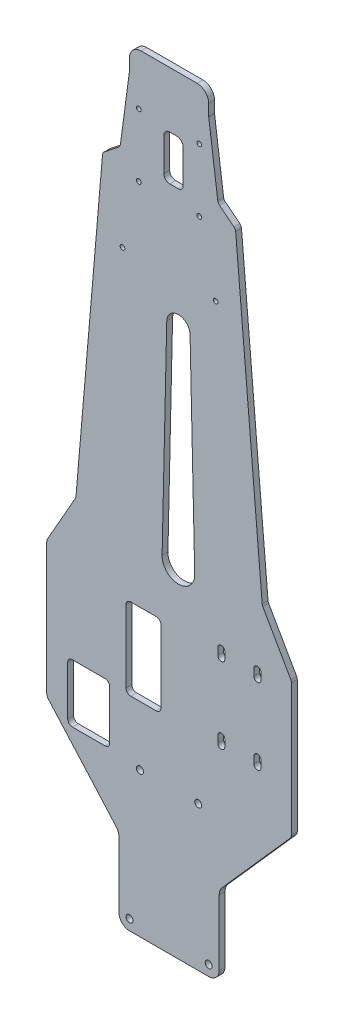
ISO-10303-21;
HEADER;
FILE_DESCRIPTION(('STEP AP214'),'2;1');
FILE_NAME('part.step','',(''),(''),'','','');
FILE_SCHEMA(('AUTOMOTIVE_DESIGN { 1 0 10303 214 1 1 1 1 }'));
ENDSEC;
DATA;
#1=APPLICATION_CONTEXT('core data for automotive mechanical design processes');
#2=APPLICATION_PROTOCOL_DEFINITION('international standard','automotive_design',2000,#1);
#3=PRODUCT_CONTEXT('',#1,'mechanical');
#4=PRODUCT('Part','Part','',(#3));
#5=PRODUCT_RELATED_PRODUCT_CATEGORY('part','',(#4));
#6=PRODUCT_DEFINITION_FORMATION('','',#4);
#7=PRODUCT_DEFINITION_CONTEXT('part definition',#1,'design');
#8=PRODUCT_DEFINITION('design','',#6,#7);
#9=PRODUCT_DEFINITION_SHAPE('','',#8);
#10=(LENGTH_UNIT() NAMED_UNIT(*) SI_UNIT(.MILLI.,.METRE.));
#11=(NAMED_UNIT(*) PLANE_ANGLE_UNIT() SI_UNIT($,.RADIAN.));
#12=(NAMED_UNIT(*) SI_UNIT($,.STERADIAN.) SOLID_ANGLE_UNIT());
#13=UNCERTAINTY_MEASURE_WITH_UNIT(LENGTH_MEASURE(1.E-05),#10,'distance_accuracy_value','');
#14=(GEOMETRIC_REPRESENTATION_CONTEXT(3) GLOBAL_UNCERTAINTY_ASSIGNED_CONTEXT((#13)) GLOBAL_UNIT_ASSIGNED_CONTEXT((#10,
#11,#12)) REPRESENTATION_CONTEXT('',''));
#15=CARTESIAN_POINT('',(0.,0.,0.));
#16=DIRECTION('',(0.,0.,1.));
#17=DIRECTION('',(1.,0.,0.));
#18=AXIS2_PLACEMENT_3D('',#15,#16,#17);
#19=CARTESIAN_POINT('',(-26.5000000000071,-241.895915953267,0.));
#20=DIRECTION('',(0.,0.,-1.));
#21=DIRECTION('',(-1.,0.,0.));
#22=AXIS2_PLACEMENT_3D('',#19,#20,#21);
#23=CYLINDRICAL_SURFACE('',#22,5.00000000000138);
#24=CARTESIAN_POINT('',(-26.5000000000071,-241.895915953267,-2.5));
#25=DIRECTION('',(0.,0.,1.));
#26=DIRECTION('',(1.,0.,0.));
#27=AXIS2_PLACEMENT_3D('',#24,#25,#26);
#28=CIRCLE('',#27,5.00000000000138);
#29=CARTESIAN_POINT('',(-21.5000000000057,-241.895915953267,-2.5));
#30=VERTEX_POINT('',#29);
#31=CARTESIAN_POINT('',(-22.7570590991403,-238.580739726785,-2.5));
#32=VERTEX_POINT('',#31);
#33=EDGE_CURVE('E1197',#30,#32,#28,.T.);
#34=ORIENTED_EDGE('',*,*,#33,.F.);
#35=DIRECTION('',(0.,0.,-1.));
#36=VECTOR('',#35,1.);
#37=CARTESIAN_POINT('',(-21.5000000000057,-241.895915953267,0.));
#38=LINE('',#37,#36);
#39=CARTESIAN_POINT('',(-21.5000000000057,-241.895915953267,0.));
#40=VERTEX_POINT('',#39);
#41=EDGE_CURVE('E11',#40,#30,#38,.T.);
#42=ORIENTED_EDGE('',*,*,#41,.F.);
#43=CARTESIAN_POINT('',(-26.5000000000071,-241.895915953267,0.));
#44=DIRECTION('',(0.,0.,1.));
#45=DIRECTION('',(1.,0.,0.));
#46=AXIS2_PLACEMENT_3D('',#43,#44,#45);
#47=CIRCLE('',#46,5.00000000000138);
#48=CARTESIAN_POINT('',(-22.7570590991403,-238.580739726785,0.));
#49=VERTEX_POINT('',#48);
#50=EDGE_CURVE('E1311',#40,#49,#47,.T.);
#51=ORIENTED_EDGE('',*,*,#50,.T.);
#52=DIRECTION('',(0.,0.,-1.));
#53=VECTOR('',#52,1.);
#54=CARTESIAN_POINT('',(-22.7570590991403,-238.580739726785,0.));
#55=LINE('',#54,#53);
#56=EDGE_CURVE('E353',#49,#32,#55,.T.);
#57=ORIENTED_EDGE('',*,*,#56,.T.);
#58=EDGE_LOOP('',(#34,#42,#51,#57));
#59=FACE_BOUND('',#58,.T.);
#60=ADVANCED_FACE('F350',(#59),#23,.F.);
#61=CARTESIAN_POINT('',(-21.5000000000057,-269.999999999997,0.));
#62=DIRECTION('',(-1.,0.,0.));
#63=DIRECTION('',(0.,0.,1.));
#64=AXIS2_PLACEMENT_3D('',#61,#62,#63);
#65=PLANE('',#64);
#66=DIRECTION('',(0.,1.,0.));
#67=VECTOR('',#66,1.);
#68=CARTESIAN_POINT('',(-21.5000000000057,-269.999999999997,-2.5));
#69=LINE('',#68,#67);
#70=CARTESIAN_POINT('',(-21.5000000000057,-269.999999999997,-2.5));
#71=VERTEX_POINT('',#70);
#72=EDGE_CURVE('E1308',#71,#30,#69,.T.);
#73=ORIENTED_EDGE('',*,*,#72,.F.);
#74=DIRECTION('',(0.,0.,-1.));
#75=VECTOR('',#74,1.);
#76=CARTESIAN_POINT('',(-21.5000000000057,-269.999999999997,0.));
#77=LINE('',#76,#75);
#78=CARTESIAN_POINT('',(-21.5000000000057,-269.999999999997,0.));
#79=VERTEX_POINT('',#78);
#80=EDGE_CURVE('E358',#79,#71,#77,.T.);
#81=ORIENTED_EDGE('',*,*,#80,.F.);
#82=DIRECTION('',(0.,1.,0.));
#83=VECTOR('',#82,1.);
#84=CARTESIAN_POINT('',(-21.5000000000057,-269.999999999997,0.));
#85=LINE('',#84,#83);
#86=EDGE_CURVE('E1416',#79,#40,#85,.T.);
#87=ORIENTED_EDGE('',*,*,#86,.T.);
#88=ORIENTED_EDGE('',*,*,#41,.T.);
#89=EDGE_LOOP('',(#73,#81,#87,#88));
#90=FACE_BOUND('',#89,.T.);
#91=ADVANCED_FACE('F1496',(#90),#65,.T.);
#92=CARTESIAN_POINT('',(-17.0000000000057,-269.999999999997,0.));
#93=DIRECTION('',(0.,0.,-1.));
#94=DIRECTION('',(-1.,0.,0.));
#95=AXIS2_PLACEMENT_3D('',#92,#93,#94);
#96=CYLINDRICAL_SURFACE('',#95,4.49999999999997);
#97=CARTESIAN_POINT('',(-17.0000000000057,-269.999999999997,-2.5));
#98=DIRECTION('',(0.,0.,-1.));
#99=DIRECTION('',(-1.,0.,0.));
#100=AXIS2_PLACEMENT_3D('',#97,#98,#99);
#101=CIRCLE('',#100,4.49999999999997);
#102=CARTESIAN_POINT('',(-17.0000000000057,-274.499999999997,-2.5));
#103=VERTEX_POINT('',#102);
#104=EDGE_CURVE('E1305',#103,#71,#101,.T.);
#105=ORIENTED_EDGE('',*,*,#104,.F.);
#106=DIRECTION('',(0.,0.,-1.));
#107=VECTOR('',#106,1.);
#108=CARTESIAN_POINT('',(-17.0000000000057,-274.499999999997,0.));
#109=LINE('',#108,#107);
#110=CARTESIAN_POINT('',(-17.0000000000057,-274.499999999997,0.));
#111=VERTEX_POINT('',#110);
#112=EDGE_CURVE('E1420',#111,#103,#109,.T.);
#113=ORIENTED_EDGE('',*,*,#112,.F.);
#114=CARTESIAN_POINT('',(-17.0000000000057,-269.999999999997,0.));
#115=DIRECTION('',(0.,0.,-1.));
#116=DIRECTION('',(-1.,0.,0.));
#117=AXIS2_PLACEMENT_3D('',#114,#115,#116);
#118=CIRCLE('',#117,4.49999999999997);
#119=EDGE_CURVE('E1413',#111,#79,#118,.T.);
#120=ORIENTED_EDGE('',*,*,#119,.T.);
#121=ORIENTED_EDGE('',*,*,#80,.T.);
#122=EDGE_LOOP('',(#105,#113,#120,#121));
#123=FACE_BOUND('',#122,.T.);
#124=ADVANCED_FACE('F1629',(#123),#96,.T.);
#125=CARTESIAN_POINT('',(16.9999999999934,-274.499999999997,0.));
#126=DIRECTION('',(0.,-1.,0.));
#127=DIRECTION('',(1.,0.,0.));
#128=AXIS2_PLACEMENT_3D('',#125,#126,#127);
#129=PLANE('',#128);
#130=DIRECTION('',(-1.,0.,0.));
#131=VECTOR('',#130,1.);
#132=CARTESIAN_POINT('',(16.9999999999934,-274.499999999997,-2.5));
#133=LINE('',#132,#131);
#134=CARTESIAN_POINT('',(16.9999999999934,-274.499999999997,-2.5));
#135=VERTEX_POINT('',#134);
#136=EDGE_CURVE('E1302',#135,#103,#133,.T.);
#137=ORIENTED_EDGE('',*,*,#136,.F.);
#138=DIRECTION('',(0.,0.,-1.));
#139=VECTOR('',#138,1.);
#140=CARTESIAN_POINT('',(16.9999999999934,-274.499999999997,0.));
#141=LINE('',#140,#139);
#142=CARTESIAN_POINT('',(16.9999999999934,-274.499999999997,0.));
#143=VERTEX_POINT('',#142);
#144=EDGE_CURVE('E1422',#143,#135,#141,.T.);
#145=ORIENTED_EDGE('',*,*,#144,.F.);
#146=DIRECTION('',(-1.,0.,0.));
#147=VECTOR('',#146,1.);
#148=CARTESIAN_POINT('',(16.9999999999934,-274.499999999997,0.));
#149=LINE('',#148,#147);
#150=EDGE_CURVE('E1410',#143,#111,#149,.T.);
#151=ORIENTED_EDGE('',*,*,#150,.T.);
#152=ORIENTED_EDGE('',*,*,#112,.T.);
#153=EDGE_LOOP('',(#137,#145,#151,#152));
#154=FACE_BOUND('',#153,.T.);
#155=ADVANCED_FACE('F1626',(#154),#129,.T.);
#156=CARTESIAN_POINT('',(16.9999999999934,-269.999999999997,0.));
#157=DIRECTION('',(0.,0.,-1.));
#158=DIRECTION('',(-1.,0.,0.));
#159=AXIS2_PLACEMENT_3D('',#156,#157,#158);
#160=CYLINDRICAL_SURFACE('',#159,4.5);
#161=CARTESIAN_POINT('',(16.9999999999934,-269.999999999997,-2.5));
#162=DIRECTION('',(0.,0.,-1.));
#163=DIRECTION('',(-1.,0.,0.));
#164=AXIS2_PLACEMENT_3D('',#161,#162,#163);
#165=CIRCLE('',#164,4.5);
#166=CARTESIAN_POINT('',(21.4999999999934,-269.999999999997,-2.5));
#167=VERTEX_POINT('',#166);
#168=EDGE_CURVE('E1299',#167,#135,#165,.T.);
#169=ORIENTED_EDGE('',*,*,#168,.F.);
#170=DIRECTION('',(0.,0.,-1.));
#171=VECTOR('',#170,1.);
#172=CARTESIAN_POINT('',(21.4999999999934,-269.999999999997,0.));
#173=LINE('',#172,#171);
#174=CARTESIAN_POINT('',(21.4999999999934,-269.999999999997,0.));
#175=VERTEX_POINT('',#174);
#176=EDGE_CURVE('E1424',#175,#167,#173,.T.);
#177=ORIENTED_EDGE('',*,*,#176,.F.);
#178=CARTESIAN_POINT('',(16.9999999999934,-269.999999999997,0.));
#179=DIRECTION('',(0.,0.,-1.));
#180=DIRECTION('',(-1.,0.,0.));
#181=AXIS2_PLACEMENT_3D('',#178,#179,#180);
#182=CIRCLE('',#181,4.5);
#183=EDGE_CURVE('E1407',#175,#143,#182,.T.);
#184=ORIENTED_EDGE('',*,*,#183,.T.);
#185=ORIENTED_EDGE('',*,*,#144,.T.);
#186=EDGE_LOOP('',(#169,#177,#184,#185));
#187=FACE_BOUND('',#186,.T.);
#188=ADVANCED_FACE('F1623',(#187),#160,.T.);
#189=CARTESIAN_POINT('',(21.4999999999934,-241.895915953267,0.));
#190=DIRECTION('',(1.,0.,0.));
#191=DIRECTION('',(0.,0.,-1.));
#192=AXIS2_PLACEMENT_3D('',#189,#190,#191);
#193=PLANE('',#192);
#194=DIRECTION('',(0.,-1.,0.));
#195=VECTOR('',#194,1.);
#196=CARTESIAN_POINT('',(21.4999999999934,-241.895915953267,-2.5));
#197=LINE('',#196,#195);
#198=CARTESIAN_POINT('',(21.4999999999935,-241.895915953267,-2.5));
#199=VERTEX_POINT('',#198);
#200=EDGE_CURVE('E1296',#199,#167,#197,.T.);
#201=ORIENTED_EDGE('',*,*,#200,.F.);
#202=DIRECTION('',(0.,0.,-1.));
#203=VECTOR('',#202,1.);
#204=CARTESIAN_POINT('',(21.4999999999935,-241.895915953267,0.));
#205=LINE('',#204,#203);
#206=CARTESIAN_POINT('',(21.4999999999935,-241.895915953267,0.));
#207=VERTEX_POINT('',#206);
#208=EDGE_CURVE('E1426',#207,#199,#205,.T.);
#209=ORIENTED_EDGE('',*,*,#208,.F.);
#210=DIRECTION('',(0.,-1.,0.));
#211=VECTOR('',#210,1.);
#212=CARTESIAN_POINT('',(21.4999999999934,-241.895915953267,0.));
#213=LINE('',#212,#211);
#214=EDGE_CURVE('E1404',#207,#175,#213,.T.);
#215=ORIENTED_EDGE('',*,*,#214,.T.);
#216=ORIENTED_EDGE('',*,*,#176,.T.);
#217=EDGE_LOOP('',(#201,#209,#215,#216));
#218=FACE_BOUND('',#217,.T.);
#219=ADVANCED_FACE('F1619',(#218),#193,.T.);
#220=CARTESIAN_POINT('',(26.4999999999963,-241.895915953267,0.));
#221=DIRECTION('',(0.,0.,-1.));
#222=DIRECTION('',(-1.,0.,0.));
#223=AXIS2_PLACEMENT_3D('',#220,#221,#222);
#224=CYLINDRICAL_SURFACE('',#223,5.00000000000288);
#225=CARTESIAN_POINT('',(26.4999999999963,-241.895915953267,-2.5));
#226=DIRECTION('',(0.,0.,1.));
#227=DIRECTION('',(1.,0.,0.));
#228=AXIS2_PLACEMENT_3D('',#225,#226,#227);
#229=CIRCLE('',#228,5.00000000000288);
#230=CARTESIAN_POINT('',(22.7570590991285,-238.580739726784,-2.5));
#231=VERTEX_POINT('',#230);
#232=EDGE_CURVE('E1293',#231,#199,#229,.T.);
#233=ORIENTED_EDGE('',*,*,#232,.F.);
#234=DIRECTION('',(0.,0.,-1.));
#235=VECTOR('',#234,1.);
#236=CARTESIAN_POINT('',(22.7570590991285,-238.580739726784,0.));
#237=LINE('',#236,#235);
#238=CARTESIAN_POINT('',(22.7570590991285,-238.580739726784,0.));
#239=VERTEX_POINT('',#238);
#240=EDGE_CURVE('E1428',#239,#231,#237,.T.);
#241=ORIENTED_EDGE('',*,*,#240,.F.);
#242=CARTESIAN_POINT('',(26.4999999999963,-241.895915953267,0.));
#243=DIRECTION('',(0.,0.,1.));
#244=DIRECTION('',(1.,0.,0.));
#245=AXIS2_PLACEMENT_3D('',#242,#243,#244);
#246=CIRCLE('',#245,5.00000000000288);
#247=EDGE_CURVE('E1401',#239,#207,#246,.T.);
#248=ORIENTED_EDGE('',*,*,#247,.T.);
#249=ORIENTED_EDGE('',*,*,#208,.T.);
#250=EDGE_LOOP('',(#233,#241,#248,#249));
#251=FACE_BOUND('',#250,.T.);
#252=ADVANCED_FACE('F1615',(#251),#224,.F.);
#253=CARTESIAN_POINT('',(51.9971763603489,-205.567704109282,0.));
#254=DIRECTION('',(0.74858818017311,-0.66303524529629,0.));
#255=DIRECTION('',(0.66303524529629,0.74858818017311,0.));
#256=AXIS2_PLACEMENT_3D('',#253,#254,#255);
#257=PLANE('',#256);
#258=DIRECTION('',(-0.66303524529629,-0.74858818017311,0.));
#259=VECTOR('',#258,1.);
#260=CARTESIAN_POINT('',(51.9971763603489,-205.567704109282,-2.5));
#261=LINE('',#260,#259);
#262=CARTESIAN_POINT('',(51.9971763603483,-205.567704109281,-2.5));
#263=VERTEX_POINT('',#262);
#264=EDGE_CURVE('E1290',#263,#231,#261,.T.);
#265=ORIENTED_EDGE('',*,*,#264,.F.);
#266=DIRECTION('',(0.,0.,-1.));
#267=VECTOR('',#266,1.);
#268=CARTESIAN_POINT('',(51.9971763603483,-205.567704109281,0.));
#269=LINE('',#268,#267);
#270=CARTESIAN_POINT('',(51.9971763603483,-205.567704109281,0.));
#271=VERTEX_POINT('',#270);
#272=EDGE_CURVE('E1430',#271,#263,#269,.T.);
#273=ORIENTED_EDGE('',*,*,#272,.F.);
#274=DIRECTION('',(-0.66303524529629,-0.74858818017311,0.));
#275=VECTOR('',#274,1.);
#276=CARTESIAN_POINT('',(51.9971763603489,-205.567704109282,0.));
#277=LINE('',#276,#275);
#278=EDGE_CURVE('E1398',#271,#239,#277,.T.);
#279=ORIENTED_EDGE('',*,*,#278,.T.);
#280=ORIENTED_EDGE('',*,*,#240,.T.);
#281=EDGE_LOOP('',(#265,#273,#279,#280));
#282=FACE_BOUND('',#281,.T.);
#283=ADVANCED_FACE('F1611',(#282),#257,.T.);
#284=CARTESIAN_POINT('',(50.5,-204.24163361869,0.));
#285=DIRECTION('',(0.,0.,-1.));
#286=DIRECTION('',(-1.,0.,0.));
#287=AXIS2_PLACEMENT_3D('',#284,#285,#286);
#288=CYLINDRICAL_SURFACE('',#287,2.00000000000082);
#289=CARTESIAN_POINT('',(50.5,-204.24163361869,-2.5));
#290=DIRECTION('',(0.,0.,-1.));
#291=DIRECTION('',(-1.,0.,0.));
#292=AXIS2_PLACEMENT_3D('',#289,#290,#291);
#293=CIRCLE('',#292,2.00000000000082);
#294=CARTESIAN_POINT('',(52.5,-204.24163361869,-2.5));
#295=VERTEX_POINT('',#294);
#296=EDGE_CURVE('E1287',#295,#263,#293,.T.);
#297=ORIENTED_EDGE('',*,*,#296,.F.);
#298=DIRECTION('',(0.,0.,-1.));
#299=VECTOR('',#298,1.);
#300=CARTESIAN_POINT('',(52.5,-204.24163361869,0.));
#301=LINE('',#300,#299);
#302=CARTESIAN_POINT('',(52.5,-204.24163361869,0.));
#303=VERTEX_POINT('',#302);
#304=EDGE_CURVE('E1432',#303,#295,#301,.T.);
#305=ORIENTED_EDGE('',*,*,#304,.F.);
#306=CARTESIAN_POINT('',(50.5,-204.24163361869,0.));
#307=DIRECTION('',(0.,0.,-1.));
#308=DIRECTION('',(-1.,0.,0.));
#309=AXIS2_PLACEMENT_3D('',#306,#307,#308);
#310=CIRCLE('',#309,2.00000000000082);
#311=EDGE_CURVE('E1395',#303,#271,#310,.T.);
#312=ORIENTED_EDGE('',*,*,#311,.T.);
#313=ORIENTED_EDGE('',*,*,#272,.T.);
#314=EDGE_LOOP('',(#297,#305,#312,#313));
#315=FACE_BOUND('',#314,.T.);
#316=ADVANCED_FACE('F1607',(#315),#288,.T.);
#317=CARTESIAN_POINT('',(52.4999999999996,-147.528505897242,0.));
#318=DIRECTION('',(1.,0.,0.));
#319=DIRECTION('',(0.,1.,0.));
#320=AXIS2_PLACEMENT_3D('',#317,#318,#319);
#321=PLANE('',#320);
#322=DIRECTION('',(0.,-1.,0.));
#323=VECTOR('',#322,1.);
#324=CARTESIAN_POINT('',(52.4999999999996,-147.528505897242,-2.5));
#325=LINE('',#324,#323);
#326=CARTESIAN_POINT('',(52.5000000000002,-147.528505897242,-2.5));
#327=VERTEX_POINT('',#326);
#328=EDGE_CURVE('E1284',#327,#295,#325,.T.);
#329=ORIENTED_EDGE('',*,*,#328,.F.);
#330=DIRECTION('',(0.,0.,-1.));
#331=VECTOR('',#330,1.);
#332=CARTESIAN_POINT('',(52.5000000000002,-147.528505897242,0.));
#333=LINE('',#332,#331);
#334=CARTESIAN_POINT('',(52.5000000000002,-147.528505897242,0.));
#335=VERTEX_POINT('',#334);
#336=EDGE_CURVE('E1434',#335,#327,#333,.T.);
#337=ORIENTED_EDGE('',*,*,#336,.F.);
#338=DIRECTION('',(0.,-1.,0.));
#339=VECTOR('',#338,1.);
#340=CARTESIAN_POINT('',(52.4999999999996,-147.528505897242,0.));
#341=LINE('',#340,#339);
#342=EDGE_CURVE('E1392',#335,#303,#341,.T.);
#343=ORIENTED_EDGE('',*,*,#342,.T.);
#344=ORIENTED_EDGE('',*,*,#304,.T.);
#345=EDGE_LOOP('',(#329,#337,#343,#344));
#346=FACE_BOUND('',#345,.T.);
#347=ADVANCED_FACE('F1603',(#346),#321,.T.);
#348=CARTESIAN_POINT('',(50.5,-147.52850589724,0.));
#349=DIRECTION('',(0.,0.,-1.));
#350=DIRECTION('',(-1.,0.,0.));
#351=AXIS2_PLACEMENT_3D('',#348,#349,#350);
#352=CYLINDRICAL_SURFACE('',#351,2.00000000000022);
#353=CARTESIAN_POINT('',(50.5,-147.52850589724,-2.5));
#354=DIRECTION('',(0.,0.,-1.));
#355=DIRECTION('',(-1.,0.,0.));
#356=AXIS2_PLACEMENT_3D('',#353,#354,#355);
#357=CIRCLE('',#356,2.00000000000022);
#358=CARTESIAN_POINT('',(52.2389131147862,-146.54048708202,-2.5));
#359=VERTEX_POINT('',#358);
#360=EDGE_CURVE('E1281',#359,#327,#357,.T.);
#361=ORIENTED_EDGE('',*,*,#360,.F.);
#362=DIRECTION('',(0.,0.,-1.));
#363=VECTOR('',#362,1.);
#364=CARTESIAN_POINT('',(52.2389131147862,-146.54048708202,0.));
#365=LINE('',#364,#363);
#366=CARTESIAN_POINT('',(52.2389131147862,-146.54048708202,0.));
#367=VERTEX_POINT('',#366);
#368=EDGE_CURVE('E1436',#367,#359,#365,.T.);
#369=ORIENTED_EDGE('',*,*,#368,.F.);
#370=CARTESIAN_POINT('',(50.5,-147.52850589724,0.));
#371=DIRECTION('',(0.,0.,-1.));
#372=DIRECTION('',(-1.,0.,0.));
#373=AXIS2_PLACEMENT_3D('',#370,#371,#372);
#374=CIRCLE('',#373,2.00000000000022);
#375=EDGE_CURVE('E1389',#367,#335,#374,.T.);
#376=ORIENTED_EDGE('',*,*,#375,.T.);
#377=ORIENTED_EDGE('',*,*,#336,.T.);
#378=EDGE_LOOP('',(#361,#369,#376,#377));
#379=FACE_BOUND('',#378,.T.);
#380=ADVANCED_FACE('F1599',(#379),#352,.T.);
#381=CARTESIAN_POINT('',(40.2163199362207,-125.38072308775,0.));
#382=DIRECTION('',(0.869456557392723,0.494009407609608,0.));
#383=DIRECTION('',(-0.494009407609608,0.869456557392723,0.));
#384=AXIS2_PLACEMENT_3D('',#381,#382,#383);
#385=PLANE('',#384);
#386=DIRECTION('',(0.494009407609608,-0.869456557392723,0.));
#387=VECTOR('',#386,1.);
#388=CARTESIAN_POINT('',(40.2163199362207,-125.38072308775,-2.5));
#389=LINE('',#388,#387);
#390=CARTESIAN_POINT('',(40.2163199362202,-125.38072308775,-2.5));
#391=VERTEX_POINT('',#390);
#392=EDGE_CURVE('E1278',#391,#359,#389,.T.);
#393=ORIENTED_EDGE('',*,*,#392,.F.);
#394=DIRECTION('',(0.,0.,-1.));
#395=VECTOR('',#394,1.);
#396=CARTESIAN_POINT('',(40.2163199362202,-125.38072308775,0.));
#397=LINE('',#396,#395);
#398=CARTESIAN_POINT('',(40.2163199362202,-125.38072308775,0.));
#399=VERTEX_POINT('',#398);
#400=EDGE_CURVE('E1438',#399,#391,#397,.T.);
#401=ORIENTED_EDGE('',*,*,#400,.F.);
#402=DIRECTION('',(0.494009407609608,-0.869456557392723,0.));
#403=VECTOR('',#402,1.);
#404=CARTESIAN_POINT('',(40.2163199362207,-125.38072308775,0.));
#405=LINE('',#404,#403);
#406=EDGE_CURVE('E1386',#399,#367,#405,.T.);
#407=ORIENTED_EDGE('',*,*,#406,.T.);
#408=ORIENTED_EDGE('',*,*,#368,.T.);
#409=EDGE_LOOP('',(#393,#401,#407,#408));
#410=FACE_BOUND('',#409,.T.);
#411=ADVANCED_FACE('F1595',(#410),#385,.T.);
#412=CARTESIAN_POINT('',(41.955233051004,-124.39270427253,0.));
#413=DIRECTION('',(0.,0.,-1.));
#414=DIRECTION('',(-1.,0.,0.));
#415=AXIS2_PLACEMENT_3D('',#412,#413,#414);
#416=CYLINDRICAL_SURFACE('',#415,1.99999999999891);
#417=CARTESIAN_POINT('',(41.955233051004,-124.39270427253,-2.5));
#418=DIRECTION('',(0.,0.,1.));
#419=DIRECTION('',(1.,0.,0.));
#420=AXIS2_PLACEMENT_3D('',#417,#418,#419);
#421=CIRCLE('',#420,1.99999999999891);
#422=CARTESIAN_POINT('',(39.9625578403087,-124.563717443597,-2.5));
#423=VERTEX_POINT('',#422);
#424=EDGE_CURVE('E1275',#423,#391,#421,.T.);
#425=ORIENTED_EDGE('',*,*,#424,.F.);
#426=DIRECTION('',(0.,0.,-1.));
#427=VECTOR('',#426,1.);
#428=CARTESIAN_POINT('',(39.9625578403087,-124.563717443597,0.));
#429=LINE('',#428,#427);
#430=CARTESIAN_POINT('',(39.9625578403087,-124.563717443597,0.));
#431=VERTEX_POINT('',#430);
#432=EDGE_CURVE('E1440',#431,#423,#429,.T.);
#433=ORIENTED_EDGE('',*,*,#432,.F.);
#434=CARTESIAN_POINT('',(41.955233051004,-124.39270427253,0.));
#435=DIRECTION('',(0.,0.,1.));
#436=DIRECTION('',(1.,0.,0.));
#437=AXIS2_PLACEMENT_3D('',#434,#435,#436);
#438=CIRCLE('',#437,1.99999999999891);
#439=EDGE_CURVE('E1383',#431,#399,#438,.T.);
#440=ORIENTED_EDGE('',*,*,#439,.T.);
#441=ORIENTED_EDGE('',*,*,#400,.T.);
#442=EDGE_LOOP('',(#425,#433,#440,#441));
#443=FACE_BOUND('',#442,.T.);
#444=ADVANCED_FACE('F1591',(#443),#416,.F.);
#445=CARTESIAN_POINT('',(28.5733582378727,8.14521705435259,0.));
#446=DIRECTION('',(0.9963376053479,0.0855065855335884,0.));
#447=DIRECTION('',(-0.0855065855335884,0.9963376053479,0.));
#448=AXIS2_PLACEMENT_3D('',#445,#446,#447);
#449=PLANE('',#448);
#450=DIRECTION('',(0.0855065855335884,-0.9963376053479,0.));
#451=VECTOR('',#450,1.);
#452=CARTESIAN_POINT('',(28.5733582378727,8.14521705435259,-2.5));
#453=LINE('',#452,#451);
#454=CARTESIAN_POINT('',(28.5733582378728,8.1452170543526,-2.5));
#455=VERTEX_POINT('',#454);
#456=EDGE_CURVE('E1272',#455,#423,#453,.T.);
#457=ORIENTED_EDGE('',*,*,#456,.F.);
#458=DIRECTION('',(0.,0.,-1.));
#459=VECTOR('',#458,1.);
#460=CARTESIAN_POINT('',(28.5733582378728,8.1452170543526,0.));
#461=LINE('',#460,#459);
#462=CARTESIAN_POINT('',(28.5733582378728,8.1452170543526,0.));
#463=VERTEX_POINT('',#462);
#464=EDGE_CURVE('E1442',#463,#455,#461,.T.);
#465=ORIENTED_EDGE('',*,*,#464,.F.);
#466=DIRECTION('',(0.0855065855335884,-0.9963376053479,0.));
#467=VECTOR('',#466,1.);
#468=CARTESIAN_POINT('',(28.5733582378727,8.14521705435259,0.));
#469=LINE('',#468,#467);
#470=EDGE_CURVE('E1380',#463,#431,#469,.T.);
#471=ORIENTED_EDGE('',*,*,#470,.T.);
#472=ORIENTED_EDGE('',*,*,#432,.T.);
#473=EDGE_LOOP('',(#457,#465,#471,#472));
#474=FACE_BOUND('',#473,.T.);
#475=ADVANCED_FACE('F1587',(#474),#449,.T.);
#476=CARTESIAN_POINT('',(26.580683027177,7.9742038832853,0.));
#477=DIRECTION('',(0.,0.,-1.));
#478=DIRECTION('',(-1.,0.,0.));
#479=AXIS2_PLACEMENT_3D('',#476,#477,#478);
#480=CYLINDRICAL_SURFACE('',#479,2.00000000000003);
#481=CARTESIAN_POINT('',(26.580683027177,7.9742038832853,-2.5));
#482=DIRECTION('',(0.,0.,-1.));
#483=DIRECTION('',(-1.,0.,0.));
#484=AXIS2_PLACEMENT_3D('',#481,#482,#483);
#485=CIRCLE('',#484,2.00000000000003);
#486=CARTESIAN_POINT('',(27.830073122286,9.53594150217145,-2.5));
#487=VERTEX_POINT('',#486);
#488=EDGE_CURVE('E1269',#487,#455,#485,.T.);
#489=ORIENTED_EDGE('',*,*,#488,.F.);
#490=DIRECTION('',(0.,0.,-1.));
#491=VECTOR('',#490,1.);
#492=CARTESIAN_POINT('',(27.830073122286,9.53594150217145,0.));
#493=LINE('',#492,#491);
#494=CARTESIAN_POINT('',(27.830073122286,9.53594150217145,0.));
#495=VERTEX_POINT('',#494);
#496=EDGE_CURVE('E1444',#495,#487,#493,.T.);
#497=ORIENTED_EDGE('',*,*,#496,.F.);
#498=CARTESIAN_POINT('',(26.580683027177,7.9742038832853,0.));
#499=DIRECTION('',(0.,0.,-1.));
#500=DIRECTION('',(-1.,0.,0.));
#501=AXIS2_PLACEMENT_3D('',#498,#499,#500);
#502=CIRCLE('',#501,2.00000000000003);
#503=EDGE_CURVE('E1377',#495,#463,#502,.T.);
#504=ORIENTED_EDGE('',*,*,#503,.T.);
#505=ORIENTED_EDGE('',*,*,#464,.T.);
#506=EDGE_LOOP('',(#489,#497,#504,#505));
#507=FACE_BOUND('',#506,.T.);
#508=ADVANCED_FACE('F1583',(#507),#480,.T.);
#509=CARTESIAN_POINT('',(21.626952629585,14.4984378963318,0.));
#510=DIRECTION('',(0.624695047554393,0.780868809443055,0.));
#511=DIRECTION('',(-0.780868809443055,0.624695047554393,0.));
#512=AXIS2_PLACEMENT_3D('',#509,#510,#511);
#513=PLANE('',#512);
#514=DIRECTION('',(0.780868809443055,-0.624695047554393,0.));
#515=VECTOR('',#514,1.);
#516=CARTESIAN_POINT('',(21.626952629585,14.4984378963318,-2.5));
#517=LINE('',#516,#515);
#518=CARTESIAN_POINT('',(21.6269526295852,14.498437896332,-2.5));
#519=VERTEX_POINT('',#518);
#520=EDGE_CURVE('E1266',#519,#487,#517,.T.);
#521=ORIENTED_EDGE('',*,*,#520,.F.);
#522=DIRECTION('',(0.,0.,-1.));
#523=VECTOR('',#522,1.);
#524=CARTESIAN_POINT('',(21.6269526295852,14.498437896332,0.));
#525=LINE('',#524,#523);
#526=CARTESIAN_POINT('',(21.6269526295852,14.498437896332,0.));
#527=VERTEX_POINT('',#526);
#528=EDGE_CURVE('E1446',#527,#519,#525,.T.);
#529=ORIENTED_EDGE('',*,*,#528,.F.);
#530=DIRECTION('',(0.780868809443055,-0.624695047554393,0.));
#531=VECTOR('',#530,1.);
#532=CARTESIAN_POINT('',(21.626952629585,14.4984378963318,0.));
#533=LINE('',#532,#531);
#534=EDGE_CURVE('E1374',#527,#495,#533,.T.);
#535=ORIENTED_EDGE('',*,*,#534,.T.);
#536=ORIENTED_EDGE('',*,*,#496,.T.);
#537=EDGE_LOOP('',(#521,#529,#535,#536));
#538=FACE_BOUND('',#537,.T.);
#539=ADVANCED_FACE('F1579',(#538),#513,.T.);
#540=CARTESIAN_POINT('',(22.876342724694,16.060175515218,0.));
#541=DIRECTION('',(0.,0.,-1.));
#542=DIRECTION('',(-1.,0.,0.));
#543=AXIS2_PLACEMENT_3D('',#540,#541,#542);
#544=CYLINDRICAL_SURFACE('',#543,1.99999999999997);
#545=CARTESIAN_POINT('',(22.876342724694,16.060175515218,-2.5));
#546=DIRECTION('',(0.,0.,1.));
#547=DIRECTION('',(1.,0.,0.));
#548=AXIS2_PLACEMENT_3D('',#545,#546,#547);
#549=CIRCLE('',#548,1.99999999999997);
#550=CARTESIAN_POINT('',(20.893886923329,15.795848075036,-2.5));
#551=VERTEX_POINT('',#550);
#552=EDGE_CURVE('E1263',#551,#519,#549,.T.);
#553=ORIENTED_EDGE('',*,*,#552,.F.);
#554=DIRECTION('',(0.,0.,-1.));
#555=VECTOR('',#554,1.);
#556=CARTESIAN_POINT('',(20.893886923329,15.795848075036,0.));
#557=LINE('',#556,#555);
#558=CARTESIAN_POINT('',(20.893886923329,15.795848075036,0.));
#559=VERTEX_POINT('',#558);
#560=EDGE_CURVE('E1448',#559,#551,#557,.T.);
#561=ORIENTED_EDGE('',*,*,#560,.F.);
#562=CARTESIAN_POINT('',(22.876342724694,16.060175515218,0.));
#563=DIRECTION('',(0.,0.,1.));
#564=DIRECTION('',(1.,0.,0.));
#565=AXIS2_PLACEMENT_3D('',#562,#563,#564);
#566=CIRCLE('',#565,1.99999999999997);
#567=EDGE_CURVE('E1371',#559,#527,#566,.T.);
#568=ORIENTED_EDGE('',*,*,#567,.T.);
#569=ORIENTED_EDGE('',*,*,#528,.T.);
#570=EDGE_LOOP('',(#553,#561,#568,#569));
#571=FACE_BOUND('',#570,.T.);
#572=ADVANCED_FACE('F1575',(#571),#544,.F.);
#573=CARTESIAN_POINT('',(17.0175441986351,44.86841851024,0.));
#574=DIRECTION('',(0.991227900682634,0.132163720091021,0.));
#575=DIRECTION('',(-0.132163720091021,0.991227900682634,0.));
#576=AXIS2_PLACEMENT_3D('',#573,#574,#575);
#577=PLANE('',#576);
#578=DIRECTION('',(0.132163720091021,-0.991227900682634,0.));
#579=VECTOR('',#578,1.);
#580=CARTESIAN_POINT('',(17.0175441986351,44.86841851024,-2.5));
#581=LINE('',#580,#579);
#582=CARTESIAN_POINT('',(17.0175441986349,44.86841851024,-2.5));
#583=VERTEX_POINT('',#582);
#584=EDGE_CURVE('E1260',#583,#551,#581,.T.);
#585=ORIENTED_EDGE('',*,*,#584,.F.);
#586=DIRECTION('',(0.,0.,-1.));
#587=VECTOR('',#586,1.);
#588=CARTESIAN_POINT('',(17.0175441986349,44.86841851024,0.));
#589=LINE('',#588,#587);
#590=CARTESIAN_POINT('',(17.0175441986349,44.86841851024,0.));
#591=VERTEX_POINT('',#590);
#592=EDGE_CURVE('E1450',#591,#583,#589,.T.);
#593=ORIENTED_EDGE('',*,*,#592,.F.);
#594=DIRECTION('',(0.132163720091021,-0.991227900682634,0.));
#595=VECTOR('',#594,1.);
#596=CARTESIAN_POINT('',(17.0175441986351,44.86841851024,0.));
#597=LINE('',#596,#595);
#598=EDGE_CURVE('E1368',#591,#559,#597,.T.);
#599=ORIENTED_EDGE('',*,*,#598,.T.);
#600=ORIENTED_EDGE('',*,*,#560,.T.);
#601=EDGE_LOOP('',(#585,#593,#599,#600));
#602=FACE_BOUND('',#601,.T.);
#603=ADVANCED_FACE('F1571',(#602),#577,.T.);
#604=CARTESIAN_POINT('',(19.,45.132745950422,0.));
#605=DIRECTION('',(0.,0.,-1.));
#606=DIRECTION('',(-1.,0.,0.));
#607=AXIS2_PLACEMENT_3D('',#604,#605,#606);
#608=CYLINDRICAL_SURFACE('',#607,1.99999999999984);
#609=CARTESIAN_POINT('',(19.,45.132745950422,-2.5));
#610=DIRECTION('',(0.,0.,1.));
#611=DIRECTION('',(1.,0.,0.));
#612=AXIS2_PLACEMENT_3D('',#609,#610,#611);
#613=CIRCLE('',#612,1.99999999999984);
#614=CARTESIAN_POINT('',(17.,45.132745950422,-2.5));
#615=VERTEX_POINT('',#614);
#616=EDGE_CURVE('E1257',#615,#583,#613,.T.);
#617=ORIENTED_EDGE('',*,*,#616,.F.);
#618=DIRECTION('',(0.,0.,-1.));
#619=VECTOR('',#618,1.);
#620=CARTESIAN_POINT('',(17.,45.132745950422,0.));
#621=LINE('',#620,#619);
#622=CARTESIAN_POINT('',(17.,45.132745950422,0.));
#623=VERTEX_POINT('',#622);
#624=EDGE_CURVE('E1452',#623,#615,#621,.T.);
#625=ORIENTED_EDGE('',*,*,#624,.F.);
#626=CARTESIAN_POINT('',(19.,45.132745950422,0.));
#627=DIRECTION('',(0.,0.,1.));
#628=DIRECTION('',(1.,0.,0.));
#629=AXIS2_PLACEMENT_3D('',#626,#627,#628);
#630=CIRCLE('',#629,1.99999999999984);
#631=EDGE_CURVE('E1365',#623,#591,#630,.T.);
#632=ORIENTED_EDGE('',*,*,#631,.T.);
#633=ORIENTED_EDGE('',*,*,#592,.T.);
#634=EDGE_LOOP('',(#617,#625,#632,#633));
#635=FACE_BOUND('',#634,.T.);
#636=ADVANCED_FACE('F1567',(#635),#608,.F.);
#637=CARTESIAN_POINT('',(17.0000000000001,50.,0.));
#638=DIRECTION('',(1.,0.,0.));
#639=DIRECTION('',(0.,1.,0.));
#640=AXIS2_PLACEMENT_3D('',#637,#638,#639);
#641=PLANE('',#640);
#642=DIRECTION('',(0.,-1.,0.));
#643=VECTOR('',#642,1.);
#644=CARTESIAN_POINT('',(17.0000000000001,50.,-2.5));
#645=LINE('',#644,#643);
#646=CARTESIAN_POINT('',(17.,50.,-2.5));
#647=VERTEX_POINT('',#646);
#648=EDGE_CURVE('E1254',#647,#615,#645,.T.);
#649=ORIENTED_EDGE('',*,*,#648,.F.);
#650=DIRECTION('',(0.,0.,-1.));
#651=VECTOR('',#650,1.);
#652=CARTESIAN_POINT('',(17.,50.,0.));
#653=LINE('',#652,#651);
#654=CARTESIAN_POINT('',(17.,50.,0.));
#655=VERTEX_POINT('',#654);
#656=EDGE_CURVE('E1454',#655,#647,#653,.T.);
#657=ORIENTED_EDGE('',*,*,#656,.F.);
#658=DIRECTION('',(0.,-1.,0.));
#659=VECTOR('',#658,1.);
#660=CARTESIAN_POINT('',(17.0000000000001,50.,0.));
#661=LINE('',#660,#659);
#662=EDGE_CURVE('E1362',#655,#623,#661,.T.);
#663=ORIENTED_EDGE('',*,*,#662,.T.);
#664=ORIENTED_EDGE('',*,*,#624,.T.);
#665=EDGE_LOOP('',(#649,#657,#663,#664));
#666=FACE_BOUND('',#665,.T.);
#667=ADVANCED_FACE('F1563',(#666),#641,.T.);
#668=CARTESIAN_POINT('',(12.,50.,0.));
#669=DIRECTION('',(0.,0.,-1.));
#670=DIRECTION('',(-1.,0.,0.));
#671=AXIS2_PLACEMENT_3D('',#668,#669,#670);
#672=CYLINDRICAL_SURFACE('',#671,5.00000000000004);
#673=CARTESIAN_POINT('',(12.,50.,-2.5));
#674=DIRECTION('',(0.,0.,-1.));
#675=DIRECTION('',(-1.,0.,0.));
#676=AXIS2_PLACEMENT_3D('',#673,#674,#675);
#677=CIRCLE('',#676,5.00000000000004);
#678=CARTESIAN_POINT('',(12.,55.,-2.5));
#679=VERTEX_POINT('',#678);
#680=EDGE_CURVE('E1251',#679,#647,#677,.T.);
#681=ORIENTED_EDGE('',*,*,#680,.F.);
#682=DIRECTION('',(0.,0.,-1.));
#683=VECTOR('',#682,1.);
#684=CARTESIAN_POINT('',(12.,55.,0.));
#685=LINE('',#684,#683);
#686=CARTESIAN_POINT('',(12.,55.,0.));
#687=VERTEX_POINT('',#686);
#688=EDGE_CURVE('E1456',#687,#679,#685,.T.);
#689=ORIENTED_EDGE('',*,*,#688,.F.);
#690=CARTESIAN_POINT('',(12.,50.,0.));
#691=DIRECTION('',(0.,0.,-1.));
#692=DIRECTION('',(-1.,0.,0.));
#693=AXIS2_PLACEMENT_3D('',#690,#691,#692);
#694=CIRCLE('',#693,5.00000000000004);
#695=EDGE_CURVE('E1359',#687,#655,#694,.T.);
#696=ORIENTED_EDGE('',*,*,#695,.T.);
#697=ORIENTED_EDGE('',*,*,#656,.T.);
#698=EDGE_LOOP('',(#681,#689,#696,#697));
#699=FACE_BOUND('',#698,.T.);
#700=ADVANCED_FACE('F1559',(#699),#672,.T.);
#701=CARTESIAN_POINT('',(-11.9999999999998,55.0000000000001,0.));
#702=DIRECTION('',(0.,1.,0.));
#703=DIRECTION('',(-1.,0.,0.));
#704=AXIS2_PLACEMENT_3D('',#701,#702,#703);
#705=PLANE('',#704);
#706=DIRECTION('',(1.,0.,0.));
#707=VECTOR('',#706,1.);
#708=CARTESIAN_POINT('',(-11.9999999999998,55.0000000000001,-2.5));
#709=LINE('',#708,#707);
#710=CARTESIAN_POINT('',(-11.9999999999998,55.,-2.5));
#711=VERTEX_POINT('',#710);
#712=EDGE_CURVE('E1248',#711,#679,#709,.T.);
#713=ORIENTED_EDGE('',*,*,#712,.F.);
#714=DIRECTION('',(0.,0.,-1.));
#715=VECTOR('',#714,1.);
#716=CARTESIAN_POINT('',(-11.9999999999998,55.,0.));
#717=LINE('',#716,#715);
#718=CARTESIAN_POINT('',(-11.9999999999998,55.,0.));
#719=VERTEX_POINT('',#718);
#720=EDGE_CURVE('E1458',#719,#711,#717,.T.);
#721=ORIENTED_EDGE('',*,*,#720,.F.);
#722=DIRECTION('',(1.,0.,0.));
#723=VECTOR('',#722,1.);
#724=CARTESIAN_POINT('',(-11.9999999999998,55.0000000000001,0.));
#725=LINE('',#724,#723);
#726=EDGE_CURVE('E1356',#719,#687,#725,.T.);
#727=ORIENTED_EDGE('',*,*,#726,.T.);
#728=ORIENTED_EDGE('',*,*,#688,.T.);
#729=EDGE_LOOP('',(#713,#721,#727,#728));
#730=FACE_BOUND('',#729,.T.);
#731=ADVANCED_FACE('F1555',(#730),#705,.T.);
#732=CARTESIAN_POINT('',(-12.,50.,0.));
#733=DIRECTION('',(0.,0.,-1.));
#734=DIRECTION('',(-1.,0.,0.));
#735=AXIS2_PLACEMENT_3D('',#732,#733,#734);
#736=CYLINDRICAL_SURFACE('',#735,5.00000000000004);
#737=CARTESIAN_POINT('',(-12.,50.,-2.5));
#738=DIRECTION('',(0.,0.,-1.));
#739=DIRECTION('',(-1.,0.,0.));
#740=AXIS2_PLACEMENT_3D('',#737,#738,#739);
#741=CIRCLE('',#740,5.00000000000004);
#742=CARTESIAN_POINT('',(-17.,50.,-2.5));
#743=VERTEX_POINT('',#742);
#744=EDGE_CURVE('E1245',#743,#711,#741,.T.);
#745=ORIENTED_EDGE('',*,*,#744,.F.);
#746=DIRECTION('',(0.,0.,-1.));
#747=VECTOR('',#746,1.);
#748=CARTESIAN_POINT('',(-17.,50.,0.));
#749=LINE('',#748,#747);
#750=CARTESIAN_POINT('',(-17.,50.,0.));
#751=VERTEX_POINT('',#750);
#752=EDGE_CURVE('E1460',#751,#743,#749,.T.);
#753=ORIENTED_EDGE('',*,*,#752,.F.);
#754=CARTESIAN_POINT('',(-12.,50.,0.));
#755=DIRECTION('',(0.,0.,-1.));
#756=DIRECTION('',(-1.,0.,0.));
#757=AXIS2_PLACEMENT_3D('',#754,#755,#756);
#758=CIRCLE('',#757,5.00000000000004);
#759=EDGE_CURVE('E1353',#751,#719,#758,.T.);
#760=ORIENTED_EDGE('',*,*,#759,.T.);
#761=ORIENTED_EDGE('',*,*,#720,.T.);
#762=EDGE_LOOP('',(#745,#753,#760,#761));
#763=FACE_BOUND('',#762,.T.);
#764=ADVANCED_FACE('F1551',(#763),#736,.T.);
#765=CARTESIAN_POINT('',(-17.0000000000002,45.1327459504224,0.));
#766=DIRECTION('',(-1.,0.,0.));
#767=DIRECTION('',(0.,-1.,0.));
#768=AXIS2_PLACEMENT_3D('',#765,#766,#767);
#769=PLANE('',#768);
#770=DIRECTION('',(0.,1.,0.));
#771=VECTOR('',#770,1.);
#772=CARTESIAN_POINT('',(-17.0000000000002,45.1327459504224,-2.5));
#773=LINE('',#772,#771);
#774=CARTESIAN_POINT('',(-17.0000000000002,45.1327459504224,-2.5));
#775=VERTEX_POINT('',#774);
#776=EDGE_CURVE('E1242',#775,#743,#773,.T.);
#777=ORIENTED_EDGE('',*,*,#776,.F.);
#778=DIRECTION('',(0.,0.,-1.));
#779=VECTOR('',#778,1.);
#780=CARTESIAN_POINT('',(-17.0000000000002,45.1327459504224,0.));
#781=LINE('',#780,#779);
#782=CARTESIAN_POINT('',(-17.0000000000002,45.1327459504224,0.));
#783=VERTEX_POINT('',#782);
#784=EDGE_CURVE('E1462',#783,#775,#781,.T.);
#785=ORIENTED_EDGE('',*,*,#784,.F.);
#786=DIRECTION('',(0.,1.,0.));
#787=VECTOR('',#786,1.);
#788=CARTESIAN_POINT('',(-17.0000000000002,45.1327459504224,0.));
#789=LINE('',#788,#787);
#790=EDGE_CURVE('E1350',#783,#751,#789,.T.);
#791=ORIENTED_EDGE('',*,*,#790,.T.);
#792=ORIENTED_EDGE('',*,*,#752,.T.);
#793=EDGE_LOOP('',(#777,#785,#791,#792));
#794=FACE_BOUND('',#793,.T.);
#795=ADVANCED_FACE('F1547',(#794),#769,.T.);
#796=CARTESIAN_POINT('',(-19.,45.132745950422,0.));
#797=DIRECTION('',(0.,0.,-1.));
#798=DIRECTION('',(-1.,0.,0.));
#799=AXIS2_PLACEMENT_3D('',#796,#797,#798);
#800=CYLINDRICAL_SURFACE('',#799,1.99999999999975);
#801=CARTESIAN_POINT('',(-19.,45.132745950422,-2.5));
#802=DIRECTION('',(0.,0.,1.));
#803=DIRECTION('',(1.,0.,0.));
#804=AXIS2_PLACEMENT_3D('',#801,#802,#803);
#805=CIRCLE('',#804,1.99999999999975);
#806=CARTESIAN_POINT('',(-17.017544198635,44.86841851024,-2.5));
#807=VERTEX_POINT('',#806);
#808=EDGE_CURVE('E1239',#807,#775,#805,.T.);
#809=ORIENTED_EDGE('',*,*,#808,.F.);
#810=DIRECTION('',(0.,0.,-1.));
#811=VECTOR('',#810,1.);
#812=CARTESIAN_POINT('',(-17.017544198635,44.86841851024,0.));
#813=LINE('',#812,#811);
#814=CARTESIAN_POINT('',(-17.017544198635,44.86841851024,0.));
#815=VERTEX_POINT('',#814);
#816=EDGE_CURVE('E1464',#815,#807,#813,.T.);
#817=ORIENTED_EDGE('',*,*,#816,.F.);
#818=CARTESIAN_POINT('',(-19.,45.132745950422,0.));
#819=DIRECTION('',(0.,0.,1.));
#820=DIRECTION('',(1.,0.,0.));
#821=AXIS2_PLACEMENT_3D('',#818,#819,#820);
#822=CIRCLE('',#821,1.99999999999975);
#823=EDGE_CURVE('E1347',#815,#783,#822,.T.);
#824=ORIENTED_EDGE('',*,*,#823,.T.);
#825=ORIENTED_EDGE('',*,*,#784,.T.);
#826=EDGE_LOOP('',(#809,#817,#824,#825));
#827=FACE_BOUND('',#826,.T.);
#828=ADVANCED_FACE('F1543',(#827),#800,.F.);
#829=CARTESIAN_POINT('',(-20.8938869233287,15.7958480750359,0.));
#830=DIRECTION('',(-0.991227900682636,0.132163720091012,0.));
#831=DIRECTION('',(-0.132163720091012,-0.991227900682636,0.));
#832=AXIS2_PLACEMENT_3D('',#829,#830,#831);
#833=PLANE('',#832);
#834=DIRECTION('',(0.132163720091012,0.991227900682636,0.));
#835=VECTOR('',#834,1.);
#836=CARTESIAN_POINT('',(-20.8938869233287,15.7958480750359,-2.5));
#837=LINE('',#836,#835);
#838=CARTESIAN_POINT('',(-20.8938869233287,15.7958480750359,-2.5));
#839=VERTEX_POINT('',#838);
#840=EDGE_CURVE('E1236',#839,#807,#837,.T.);
#841=ORIENTED_EDGE('',*,*,#840,.F.);
#842=DIRECTION('',(0.,0.,-1.));
#843=VECTOR('',#842,1.);
#844=CARTESIAN_POINT('',(-20.8938869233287,15.7958480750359,0.));
#845=LINE('',#844,#843);
#846=CARTESIAN_POINT('',(-20.8938869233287,15.7958480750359,0.));
#847=VERTEX_POINT('',#846);
#848=EDGE_CURVE('E1466',#847,#839,#845,.T.);
#849=ORIENTED_EDGE('',*,*,#848,.F.);
#850=DIRECTION('',(0.132163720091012,0.991227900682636,0.));
#851=VECTOR('',#850,1.);
#852=CARTESIAN_POINT('',(-20.8938869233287,15.7958480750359,0.));
#853=LINE('',#852,#851);
#854=EDGE_CURVE('E1344',#847,#815,#853,.T.);
#855=ORIENTED_EDGE('',*,*,#854,.T.);
#856=ORIENTED_EDGE('',*,*,#816,.T.);
#857=EDGE_LOOP('',(#841,#849,#855,#856));
#858=FACE_BOUND('',#857,.T.);
#859=ADVANCED_FACE('F1539',(#858),#833,.T.);
#860=CARTESIAN_POINT('',(-22.876342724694,16.060175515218,0.));
#861=DIRECTION('',(0.,0.,-1.));
#862=DIRECTION('',(-1.,0.,0.));
#863=AXIS2_PLACEMENT_3D('',#860,#861,#862);
#864=CYLINDRICAL_SURFACE('',#863,2.00000000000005);
#865=CARTESIAN_POINT('',(-22.876342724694,16.060175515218,-2.5));
#866=DIRECTION('',(0.,0.,1.));
#867=DIRECTION('',(1.,0.,0.));
#868=AXIS2_PLACEMENT_3D('',#865,#866,#867);
#869=CIRCLE('',#868,2.00000000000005);
#870=CARTESIAN_POINT('',(-21.6269526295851,14.4984378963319,-2.5));
#871=VERTEX_POINT('',#870);
#872=EDGE_CURVE('E1233',#871,#839,#869,.T.);
#873=ORIENTED_EDGE('',*,*,#872,.F.);
#874=DIRECTION('',(0.,0.,-1.));
#875=VECTOR('',#874,1.);
#876=CARTESIAN_POINT('',(-21.6269526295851,14.4984378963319,0.));
#877=LINE('',#876,#875);
#878=CARTESIAN_POINT('',(-21.6269526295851,14.4984378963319,0.));
#879=VERTEX_POINT('',#878);
#880=EDGE_CURVE('E1468',#879,#871,#877,.T.);
#881=ORIENTED_EDGE('',*,*,#880,.F.);
#882=CARTESIAN_POINT('',(-22.876342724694,16.060175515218,0.));
#883=DIRECTION('',(0.,0.,1.));
#884=DIRECTION('',(1.,0.,0.));
#885=AXIS2_PLACEMENT_3D('',#882,#883,#884);
#886=CIRCLE('',#885,2.00000000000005);
#887=EDGE_CURVE('E1341',#879,#847,#886,.T.);
#888=ORIENTED_EDGE('',*,*,#887,.T.);
#889=ORIENTED_EDGE('',*,*,#848,.T.);
#890=EDGE_LOOP('',(#873,#881,#888,#889));
#891=FACE_BOUND('',#890,.T.);
#892=ADVANCED_FACE('F1535',(#891),#864,.F.);
#893=CARTESIAN_POINT('',(-27.8300731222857,9.53594150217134,0.));
#894=DIRECTION('',(-0.624695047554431,0.780868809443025,0.));
#895=DIRECTION('',(-0.780868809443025,-0.624695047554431,0.));
#896=AXIS2_PLACEMENT_3D('',#893,#894,#895);
#897=PLANE('',#896);
#898=DIRECTION('',(0.780868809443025,0.624695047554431,0.));
#899=VECTOR('',#898,1.);
#900=CARTESIAN_POINT('',(-27.8300731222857,9.53594150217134,-2.5));
#901=LINE('',#900,#899);
#902=CARTESIAN_POINT('',(-27.8300731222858,9.53594150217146,-2.5));
#903=VERTEX_POINT('',#902);
#904=EDGE_CURVE('E1230',#903,#871,#901,.T.);
#905=ORIENTED_EDGE('',*,*,#904,.F.);
#906=DIRECTION('',(0.,0.,-1.));
#907=VECTOR('',#906,1.);
#908=CARTESIAN_POINT('',(-27.8300731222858,9.53594150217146,0.));
#909=LINE('',#908,#907);
#910=CARTESIAN_POINT('',(-27.8300731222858,9.53594150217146,0.));
#911=VERTEX_POINT('',#910);
#912=EDGE_CURVE('E1470',#911,#903,#909,.T.);
#913=ORIENTED_EDGE('',*,*,#912,.F.);
#914=DIRECTION('',(0.780868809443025,0.624695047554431,0.));
#915=VECTOR('',#914,1.);
#916=CARTESIAN_POINT('',(-27.8300731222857,9.53594150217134,0.));
#917=LINE('',#916,#915);
#918=EDGE_CURVE('E1338',#911,#879,#917,.T.);
#919=ORIENTED_EDGE('',*,*,#918,.T.);
#920=ORIENTED_EDGE('',*,*,#880,.T.);
#921=EDGE_LOOP('',(#905,#913,#919,#920));
#922=FACE_BOUND('',#921,.T.);
#923=ADVANCED_FACE('F1531',(#922),#897,.T.);
#924=CARTESIAN_POINT('',(-26.580683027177,7.9742038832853,0.));
#925=DIRECTION('',(0.,0.,-1.));
#926=DIRECTION('',(-1.,0.,0.));
#927=AXIS2_PLACEMENT_3D('',#924,#925,#926);
#928=CYLINDRICAL_SURFACE('',#927,2.00000000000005);
#929=CARTESIAN_POINT('',(-26.580683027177,7.9742038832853,-2.5));
#930=DIRECTION('',(0.,0.,-1.));
#931=DIRECTION('',(-1.,0.,0.));
#932=AXIS2_PLACEMENT_3D('',#929,#930,#931);
#933=CIRCLE('',#932,2.00000000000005);
#934=CARTESIAN_POINT('',(-28.573358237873,8.1452170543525,-2.5));
#935=VERTEX_POINT('',#934);
#936=EDGE_CURVE('E1227',#935,#903,#933,.T.);
#937=ORIENTED_EDGE('',*,*,#936,.F.);
#938=DIRECTION('',(0.,0.,-1.));
#939=VECTOR('',#938,1.);
#940=CARTESIAN_POINT('',(-28.573358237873,8.1452170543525,0.));
#941=LINE('',#940,#939);
#942=CARTESIAN_POINT('',(-28.573358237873,8.1452170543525,0.));
#943=VERTEX_POINT('',#942);
#944=EDGE_CURVE('E1472',#943,#935,#941,.T.);
#945=ORIENTED_EDGE('',*,*,#944,.F.);
#946=CARTESIAN_POINT('',(-26.580683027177,7.9742038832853,0.));
#947=DIRECTION('',(0.,0.,-1.));
#948=DIRECTION('',(-1.,0.,0.));
#949=AXIS2_PLACEMENT_3D('',#946,#947,#948);
#950=CIRCLE('',#949,2.00000000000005);
#951=EDGE_CURVE('E1335',#943,#911,#950,.T.);
#952=ORIENTED_EDGE('',*,*,#951,.T.);
#953=ORIENTED_EDGE('',*,*,#912,.T.);
#954=EDGE_LOOP('',(#937,#945,#952,#953));
#955=FACE_BOUND('',#954,.T.);
#956=ADVANCED_FACE('F1527',(#955),#928,.T.);
#957=CARTESIAN_POINT('',(-39.9625578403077,-124.563717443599,0.));
#958=DIRECTION('',(-0.996337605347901,0.0855065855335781,0.));
#959=DIRECTION('',(-0.0855065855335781,-0.996337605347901,0.));
#960=AXIS2_PLACEMENT_3D('',#957,#958,#959);
#961=PLANE('',#960);
#962=DIRECTION('',(0.0855065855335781,0.996337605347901,0.));
#963=VECTOR('',#962,1.);
#964=CARTESIAN_POINT('',(-39.9625578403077,-124.563717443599,-2.5));
#965=LINE('',#964,#963);
#966=CARTESIAN_POINT('',(-39.9625578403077,-124.563717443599,-2.5));
#967=VERTEX_POINT('',#966);
#968=EDGE_CURVE('E1224',#967,#935,#965,.T.);
#969=ORIENTED_EDGE('',*,*,#968,.F.);
#970=DIRECTION('',(0.,0.,-1.));
#971=VECTOR('',#970,1.);
#972=CARTESIAN_POINT('',(-39.9625578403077,-124.563717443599,0.));
#973=LINE('',#972,#971);
#974=CARTESIAN_POINT('',(-39.9625578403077,-124.563717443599,0.));
#975=VERTEX_POINT('',#974);
#976=EDGE_CURVE('E1474',#975,#967,#973,.T.);
#977=ORIENTED_EDGE('',*,*,#976,.F.);
#978=DIRECTION('',(0.0855065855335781,0.996337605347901,0.));
#979=VECTOR('',#978,1.);
#980=CARTESIAN_POINT('',(-39.9625578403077,-124.563717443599,0.));
#981=LINE('',#980,#979);
#982=EDGE_CURVE('E1332',#975,#943,#981,.T.);
#983=ORIENTED_EDGE('',*,*,#982,.T.);
#984=ORIENTED_EDGE('',*,*,#944,.T.);
#985=EDGE_LOOP('',(#969,#977,#983,#984));
#986=FACE_BOUND('',#985,.T.);
#987=ADVANCED_FACE('F1523',(#986),#961,.T.);
#988=CARTESIAN_POINT('',(-41.955233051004,-124.39270427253,0.));
#989=DIRECTION('',(0.,0.,-1.));
#990=DIRECTION('',(-1.,0.,0.));
#991=AXIS2_PLACEMENT_3D('',#988,#989,#990);
#992=CYLINDRICAL_SURFACE('',#991,2.00000000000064);
#993=CARTESIAN_POINT('',(-41.955233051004,-124.39270427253,-2.5));
#994=DIRECTION('',(0.,0.,1.));
#995=DIRECTION('',(1.,0.,0.));
#996=AXIS2_PLACEMENT_3D('',#993,#994,#995);
#997=CIRCLE('',#996,2.00000000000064);
#998=CARTESIAN_POINT('',(-40.2163199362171,-125.380723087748,-2.5));
#999=VERTEX_POINT('',#998);
#1000=EDGE_CURVE('E1221',#999,#967,#997,.T.);
#1001=ORIENTED_EDGE('',*,*,#1000,.F.);
#1002=DIRECTION('',(0.,0.,-1.));
#1003=VECTOR('',#1002,1.);
#1004=CARTESIAN_POINT('',(-40.2163199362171,-125.380723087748,0.));
#1005=LINE('',#1004,#1003);
#1006=CARTESIAN_POINT('',(-40.2163199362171,-125.380723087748,0.));
#1007=VERTEX_POINT('',#1006);
#1008=EDGE_CURVE('E1476',#1007,#999,#1005,.T.);
#1009=ORIENTED_EDGE('',*,*,#1008,.F.);
#1010=CARTESIAN_POINT('',(-41.955233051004,-124.39270427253,0.));
#1011=DIRECTION('',(0.,0.,1.));
#1012=DIRECTION('',(1.,0.,0.));
#1013=AXIS2_PLACEMENT_3D('',#1010,#1011,#1012);
#1014=CIRCLE('',#1013,2.00000000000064);
#1015=EDGE_CURVE('E1329',#1007,#975,#1014,.T.);
#1016=ORIENTED_EDGE('',*,*,#1015,.T.);
#1017=ORIENTED_EDGE('',*,*,#976,.T.);
#1018=EDGE_LOOP('',(#1001,#1009,#1016,#1017));
#1019=FACE_BOUND('',#1018,.T.);
#1020=ADVANCED_FACE('F1519',(#1019),#992,.F.);
#1021=CARTESIAN_POINT('',(-52.2389131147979,-146.540487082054,0.));
#1022=DIRECTION('',(-0.869456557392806,0.49400940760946,0.));
#1023=DIRECTION('',(-0.49400940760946,-0.869456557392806,0.));
#1024=AXIS2_PLACEMENT_3D('',#1021,#1022,#1023);
#1025=PLANE('',#1024);
#1026=DIRECTION('',(0.49400940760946,0.869456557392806,0.));
#1027=VECTOR('',#1026,1.);
#1028=CARTESIAN_POINT('',(-52.2389131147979,-146.540487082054,-2.5));
#1029=LINE('',#1028,#1027);
#1030=CARTESIAN_POINT('',(-52.2389131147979,-146.540487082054,-2.5));
#1031=VERTEX_POINT('',#1030);
#1032=EDGE_CURVE('E1218',#1031,#999,#1029,.T.);
#1033=ORIENTED_EDGE('',*,*,#1032,.F.);
#1034=DIRECTION('',(0.,0.,-1.));
#1035=VECTOR('',#1034,1.);
#1036=CARTESIAN_POINT('',(-52.2389131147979,-146.540487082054,0.));
#1037=LINE('',#1036,#1035);
#1038=CARTESIAN_POINT('',(-52.2389131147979,-146.540487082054,0.));
#1039=VERTEX_POINT('',#1038);
#1040=EDGE_CURVE('E1478',#1039,#1031,#1037,.T.);
#1041=ORIENTED_EDGE('',*,*,#1040,.F.);
#1042=DIRECTION('',(0.49400940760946,0.869456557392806,0.));
#1043=VECTOR('',#1042,1.);
#1044=CARTESIAN_POINT('',(-52.2389131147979,-146.540487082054,0.));
#1045=LINE('',#1044,#1043);
#1046=EDGE_CURVE('E1326',#1039,#1007,#1045,.T.);
#1047=ORIENTED_EDGE('',*,*,#1046,.T.);
#1048=ORIENTED_EDGE('',*,*,#1008,.T.);
#1049=EDGE_LOOP('',(#1033,#1041,#1047,#1048));
#1050=FACE_BOUND('',#1049,.T.);
#1051=ADVANCED_FACE('F1515',(#1050),#1025,.T.);
#1052=CARTESIAN_POINT('',(-50.5000000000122,-147.528505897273,0.));
#1053=DIRECTION('',(0.,0.,-1.));
#1054=DIRECTION('',(-1.,0.,0.));
#1055=AXIS2_PLACEMENT_3D('',#1052,#1053,#1054);
#1056=CYLINDRICAL_SURFACE('',#1055,2.);
#1057=CARTESIAN_POINT('',(-50.5000000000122,-147.528505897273,-2.5));
#1058=DIRECTION('',(0.,0.,-1.));
#1059=DIRECTION('',(-1.,0.,0.));
#1060=AXIS2_PLACEMENT_3D('',#1057,#1058,#1059);
#1061=CIRCLE('',#1060,2.);
#1062=CARTESIAN_POINT('',(-52.5000000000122,-147.528505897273,-2.5));
#1063=VERTEX_POINT('',#1062);
#1064=EDGE_CURVE('E1215',#1063,#1031,#1061,.T.);
#1065=ORIENTED_EDGE('',*,*,#1064,.F.);
#1066=DIRECTION('',(0.,0.,-1.));
#1067=VECTOR('',#1066,1.);
#1068=CARTESIAN_POINT('',(-52.5000000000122,-147.528505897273,0.));
#1069=LINE('',#1068,#1067);
#1070=CARTESIAN_POINT('',(-52.5000000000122,-147.528505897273,0.));
#1071=VERTEX_POINT('',#1070);
#1072=EDGE_CURVE('E1480',#1071,#1063,#1069,.T.);
#1073=ORIENTED_EDGE('',*,*,#1072,.F.);
#1074=CARTESIAN_POINT('',(-50.5000000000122,-147.528505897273,0.));
#1075=DIRECTION('',(0.,0.,-1.));
#1076=DIRECTION('',(-1.,0.,0.));
#1077=AXIS2_PLACEMENT_3D('',#1074,#1075,#1076);
#1078=CIRCLE('',#1077,2.);
#1079=EDGE_CURVE('E1323',#1071,#1039,#1078,.T.);
#1080=ORIENTED_EDGE('',*,*,#1079,.T.);
#1081=ORIENTED_EDGE('',*,*,#1040,.T.);
#1082=EDGE_LOOP('',(#1065,#1073,#1080,#1081));
#1083=FACE_BOUND('',#1082,.T.);
#1084=ADVANCED_FACE('F1511',(#1083),#1056,.T.);
#1085=CARTESIAN_POINT('',(-52.5000000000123,-204.241633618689,0.));
#1086=DIRECTION('',(-1.,0.,0.));
#1087=DIRECTION('',(0.,-1.,0.));
#1088=AXIS2_PLACEMENT_3D('',#1085,#1086,#1087);
#1089=PLANE('',#1088);
#1090=DIRECTION('',(0.,1.,0.));
#1091=VECTOR('',#1090,1.);
#1092=CARTESIAN_POINT('',(-52.5000000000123,-204.241633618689,-2.5));
#1093=LINE('',#1092,#1091);
#1094=CARTESIAN_POINT('',(-52.5000000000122,-204.241633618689,-2.5));
#1095=VERTEX_POINT('',#1094);
#1096=EDGE_CURVE('E1212',#1095,#1063,#1093,.T.);
#1097=ORIENTED_EDGE('',*,*,#1096,.F.);
#1098=DIRECTION('',(0.,0.,-1.));
#1099=VECTOR('',#1098,1.);
#1100=CARTESIAN_POINT('',(-52.5000000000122,-204.241633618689,0.));
#1101=LINE('',#1100,#1099);
#1102=CARTESIAN_POINT('',(-52.5000000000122,-204.241633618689,0.));
#1103=VERTEX_POINT('',#1102);
#1104=EDGE_CURVE('E1482',#1103,#1095,#1101,.T.);
#1105=ORIENTED_EDGE('',*,*,#1104,.F.);
#1106=DIRECTION('',(0.,1.,0.));
#1107=VECTOR('',#1106,1.);
#1108=CARTESIAN_POINT('',(-52.5000000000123,-204.241633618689,0.));
#1109=LINE('',#1108,#1107);
#1110=EDGE_CURVE('E1320',#1103,#1071,#1109,.T.);
#1111=ORIENTED_EDGE('',*,*,#1110,.T.);
#1112=ORIENTED_EDGE('',*,*,#1072,.T.);
#1113=EDGE_LOOP('',(#1097,#1105,#1111,#1112));
#1114=FACE_BOUND('',#1113,.T.);
#1115=ADVANCED_FACE('F1509',(#1114),#1089,.T.);
#1116=CARTESIAN_POINT('',(-50.5000000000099,-204.241633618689,0.));
#1117=DIRECTION('',(0.,0.,-1.));
#1118=DIRECTION('',(-1.,0.,0.));
#1119=AXIS2_PLACEMENT_3D('',#1116,#1117,#1118);
#1120=CYLINDRICAL_SURFACE('',#1119,2.00000000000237);
#1121=CARTESIAN_POINT('',(-50.5000000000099,-204.241633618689,-2.5));
#1122=DIRECTION('',(0.,0.,-1.));
#1123=DIRECTION('',(-1.,0.,0.));
#1124=AXIS2_PLACEMENT_3D('',#1121,#1122,#1123);
#1125=CIRCLE('',#1124,2.00000000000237);
#1126=CARTESIAN_POINT('',(-51.9971763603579,-205.567704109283,-2.5));
#1127=VERTEX_POINT('',#1126);
#1128=EDGE_CURVE('E1209',#1127,#1095,#1125,.T.);
#1129=ORIENTED_EDGE('',*,*,#1128,.F.);
#1130=DIRECTION('',(0.,0.,-1.));
#1131=VECTOR('',#1130,1.);
#1132=CARTESIAN_POINT('',(-51.9971763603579,-205.567704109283,0.));
#1133=LINE('',#1132,#1131);
#1134=CARTESIAN_POINT('',(-51.9971763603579,-205.567704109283,0.));
#1135=VERTEX_POINT('',#1134);
#1136=EDGE_CURVE('E1483',#1135,#1127,#1133,.T.);
#1137=ORIENTED_EDGE('',*,*,#1136,.F.);
#1138=CARTESIAN_POINT('',(-50.5000000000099,-204.241633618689,0.));
#1139=DIRECTION('',(0.,0.,-1.));
#1140=DIRECTION('',(-1.,0.,0.));
#1141=AXIS2_PLACEMENT_3D('',#1138,#1139,#1140);
#1142=CIRCLE('',#1141,2.00000000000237);
#1143=EDGE_CURVE('E1317',#1135,#1103,#1142,.T.);
#1144=ORIENTED_EDGE('',*,*,#1143,.T.);
#1145=ORIENTED_EDGE('',*,*,#1104,.T.);
#1146=EDGE_LOOP('',(#1129,#1137,#1144,#1145));
#1147=FACE_BOUND('',#1146,.T.);
#1148=ADVANCED_FACE('F1505',(#1147),#1120,.T.);
#1149=CARTESIAN_POINT('',(-22.7570590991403,-238.580739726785,0.));
#1150=DIRECTION('',(-0.748588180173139,-0.663035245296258,0.));
#1151=DIRECTION('',(0.663035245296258,-0.748588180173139,0.));
#1152=AXIS2_PLACEMENT_3D('',#1149,#1150,#1151);
#1153=PLANE('',#1152);
#1154=DIRECTION('',(-0.663035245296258,0.748588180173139,0.));
#1155=VECTOR('',#1154,1.);
#1156=CARTESIAN_POINT('',(-22.7570590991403,-238.580739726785,-2.5));
#1157=LINE('',#1156,#1155);
#1158=EDGE_CURVE('E1206',#32,#1127,#1157,.T.);
#1159=ORIENTED_EDGE('',*,*,#1158,.F.);
#1160=ORIENTED_EDGE('',*,*,#56,.F.);
#1161=DIRECTION('',(-0.663035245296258,0.748588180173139,0.));
#1162=VECTOR('',#1161,1.);
#1163=CARTESIAN_POINT('',(-22.7570590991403,-238.580739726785,0.));
#1164=LINE('',#1163,#1162);
#1165=EDGE_CURVE('E1314',#49,#1135,#1164,.T.);
#1166=ORIENTED_EDGE('',*,*,#1165,.T.);
#1167=ORIENTED_EDGE('',*,*,#1136,.T.);
#1168=EDGE_LOOP('',(#1159,#1160,#1166,#1167));
#1169=FACE_BOUND('',#1168,.T.);
#1170=ADVANCED_FACE('F1491',(#1169),#1153,.T.);
#1171=CARTESIAN_POINT('',(-26.5000000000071,-241.895915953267,0.));
#1172=DIRECTION('',(0.,0.,1.));
#1173=DIRECTION('',(1.,0.,0.));
#1174=AXIS2_PLACEMENT_3D('',#1171,#1172,#1173);
#1175=PLANE('',#1174);
#1176=CARTESIAN_POINT('',(-13.,33.,0.));
#1177=DIRECTION('',(0.,0.,-1.));
#1178=DIRECTION('',(1.,0.,0.));
#1179=AXIS2_PLACEMENT_3D('',#1176,#1177,#1178);
#1180=CIRCLE('',#1179,1.);
#1181=CARTESIAN_POINT('',(-12.,33.,0.));
#1182=VERTEX_POINT('',#1181);
#1183=EDGE_CURVE('E2288',#1182,#1182,#1180,.T.);
#1184=ORIENTED_EDGE('',*,*,#1183,.T.);
#1185=EDGE_LOOP('',(#1184));
#1186=FACE_BOUND('',#1185,.T.);
#1187=CARTESIAN_POINT('',(13.,33.,0.));
#1188=DIRECTION('',(0.,0.,-1.));
#1189=DIRECTION('',(1.,0.,0.));
#1190=AXIS2_PLACEMENT_3D('',#1187,#1188,#1189);
#1191=CIRCLE('',#1190,0.999999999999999);
#1192=CARTESIAN_POINT('',(14.,33.,0.));
#1193=VERTEX_POINT('',#1192);
#1194=EDGE_CURVE('E2298',#1193,#1193,#1191,.T.);
#1195=ORIENTED_EDGE('',*,*,#1194,.T.);
#1196=EDGE_LOOP('',(#1195));
#1197=FACE_BOUND('',#1196,.T.);
#1198=CARTESIAN_POINT('',(-13.,6.,0.));
#1199=DIRECTION('',(0.,0.,-1.));
#1200=DIRECTION('',(1.,0.,0.));
#1201=AXIS2_PLACEMENT_3D('',#1198,#1199,#1200);
#1202=CIRCLE('',#1201,1.);
#1203=CARTESIAN_POINT('',(-12.,6.,0.));
#1204=VERTEX_POINT('',#1203);
#1205=EDGE_CURVE('E2304',#1204,#1204,#1202,.T.);
#1206=ORIENTED_EDGE('',*,*,#1205,.T.);
#1207=EDGE_LOOP('',(#1206));
#1208=FACE_BOUND('',#1207,.T.);
#1209=CARTESIAN_POINT('',(13.,6.,0.));
#1210=DIRECTION('',(0.,0.,-1.));
#1211=DIRECTION('',(1.,0.,0.));
#1212=AXIS2_PLACEMENT_3D('',#1209,#1210,#1211);
#1213=CIRCLE('',#1212,0.999999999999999);
#1214=CARTESIAN_POINT('',(14.,6.,0.));
#1215=VERTEX_POINT('',#1214);
#1216=EDGE_CURVE('E2310',#1215,#1215,#1213,.T.);
#1217=ORIENTED_EDGE('',*,*,#1216,.T.);
#1218=EDGE_LOOP('',(#1217));
#1219=FACE_BOUND('',#1218,.T.);
#1220=CARTESIAN_POINT('',(-20.,-22.,0.));
#1221=DIRECTION('',(0.,0.,-1.));
#1222=DIRECTION('',(1.,0.,0.));
#1223=AXIS2_PLACEMENT_3D('',#1220,#1221,#1222);
#1224=CIRCLE('',#1223,1.);
#1225=CARTESIAN_POINT('',(-19.,-22.,0.));
#1226=VERTEX_POINT('',#1225);
#1227=EDGE_CURVE('E2316',#1226,#1226,#1224,.T.);
#1228=ORIENTED_EDGE('',*,*,#1227,.T.);
#1229=EDGE_LOOP('',(#1228));
#1230=FACE_BOUND('',#1229,.T.);
#1231=CARTESIAN_POINT('',(20.,-22.,0.));
#1232=DIRECTION('',(0.,0.,-1.));
#1233=DIRECTION('',(1.,0.,0.));
#1234=AXIS2_PLACEMENT_3D('',#1231,#1232,#1233);
#1235=CIRCLE('',#1234,1.);
#1236=CARTESIAN_POINT('',(21.,-22.,0.));
#1237=VERTEX_POINT('',#1236);
#1238=EDGE_CURVE('E2322',#1237,#1237,#1235,.T.);
#1239=ORIENTED_EDGE('',*,*,#1238,.T.);
#1240=EDGE_LOOP('',(#1239));
#1241=FACE_BOUND('',#1240,.T.);
#1242=CARTESIAN_POINT('',(-17.0000000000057,-269.999999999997,0.));
#1243=DIRECTION('',(0.,0.,-1.));
#1244=DIRECTION('',(1.,0.,0.));
#1245=AXIS2_PLACEMENT_3D('',#1242,#1243,#1244);
#1246=CIRCLE('',#1245,1.5);
#1247=CARTESIAN_POINT('',(-15.5000000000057,-269.999999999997,0.));
#1248=VERTEX_POINT('',#1247);
#1249=EDGE_CURVE('E2328',#1248,#1248,#1246,.T.);
#1250=ORIENTED_EDGE('',*,*,#1249,.T.);
#1251=EDGE_LOOP('',(#1250));
#1252=FACE_BOUND('',#1251,.T.);
#1253=CARTESIAN_POINT('',(16.9999999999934,-269.999999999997,0.));
#1254=DIRECTION('',(0.,0.,-1.));
#1255=DIRECTION('',(1.,0.,0.));
#1256=AXIS2_PLACEMENT_3D('',#1253,#1254,#1255);
#1257=CIRCLE('',#1256,1.5);
#1258=CARTESIAN_POINT('',(18.4999999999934,-269.999999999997,0.));
#1259=VERTEX_POINT('',#1258);
#1260=EDGE_CURVE('E2334',#1259,#1259,#1257,.T.);
#1261=ORIENTED_EDGE('',*,*,#1260,.T.);
#1262=EDGE_LOOP('',(#1261));
#1263=FACE_BOUND('',#1262,.T.);
#1264=CARTESIAN_POINT('',(-12.5,-212.499999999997,0.));
#1265=DIRECTION('',(0.,0.,-1.));
#1266=DIRECTION('',(1.,0.,0.));
#1267=AXIS2_PLACEMENT_3D('',#1264,#1265,#1266);
#1268=CIRCLE('',#1267,1.5);
#1269=CARTESIAN_POINT('',(-11.,-212.499999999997,0.));
#1270=VERTEX_POINT('',#1269);
#1271=EDGE_CURVE('E2340',#1270,#1270,#1268,.T.);
#1272=ORIENTED_EDGE('',*,*,#1271,.T.);
#1273=EDGE_LOOP('',(#1272));
#1274=FACE_BOUND('',#1273,.T.);
#1275=CARTESIAN_POINT('',(12.5,-212.499999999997,0.));
#1276=DIRECTION('',(0.,0.,-1.));
#1277=DIRECTION('',(1.,0.,0.));
#1278=AXIS2_PLACEMENT_3D('',#1275,#1276,#1277);
#1279=CIRCLE('',#1278,1.5);
#1280=CARTESIAN_POINT('',(14.,-212.499999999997,0.));
#1281=VERTEX_POINT('',#1280);
#1282=EDGE_CURVE('E2346',#1281,#1281,#1279,.T.);
#1283=ORIENTED_EDGE('',*,*,#1282,.T.);
#1284=EDGE_LOOP('',(#1283));
#1285=FACE_BOUND('',#1284,.T.);
#1286=CARTESIAN_POINT('',(22.3999999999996,-150.199999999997,0.));
#1287=DIRECTION('',(0.,0.,-1.));
#1288=DIRECTION('',(1.,0.,0.));
#1289=AXIS2_PLACEMENT_3D('',#1286,#1287,#1288);
#1290=CIRCLE('',#1289,1.5);
#1291=CARTESIAN_POINT('',(20.8999999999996,-150.199999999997,0.));
#1292=VERTEX_POINT('',#1291);
#1293=CARTESIAN_POINT('',(23.8999999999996,-150.199999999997,0.));
#1294=VERTEX_POINT('',#1293);
#1295=EDGE_CURVE('E867',#1292,#1294,#1290,.T.);
#1296=ORIENTED_EDGE('',*,*,#1295,.T.);
#1297=DIRECTION('',(0.,-1.,0.));
#1298=VECTOR('',#1297,1.);
#1299=CARTESIAN_POINT('',(23.8999999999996,-153.199999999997,0.));
#1300=LINE('',#1299,#1298);
#1301=CARTESIAN_POINT('',(23.8999999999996,-153.199999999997,0.));
#1302=VERTEX_POINT('',#1301);
#1303=EDGE_CURVE('E873',#1294,#1302,#1300,.T.);
#1304=ORIENTED_EDGE('',*,*,#1303,.T.);
#1305=CARTESIAN_POINT('',(22.3999999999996,-153.199999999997,0.));
#1306=DIRECTION('',(0.,0.,-1.));
#1307=DIRECTION('',(1.,0.,0.));
#1308=AXIS2_PLACEMENT_3D('',#1305,#1306,#1307);
#1309=CIRCLE('',#1308,1.5);
#1310=CARTESIAN_POINT('',(20.8999999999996,-153.199999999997,0.));
#1311=VERTEX_POINT('',#1310);
#1312=EDGE_CURVE('E366',#1302,#1311,#1309,.T.);
#1313=ORIENTED_EDGE('',*,*,#1312,.T.);
#1314=DIRECTION('',(0.,1.,0.));
#1315=VECTOR('',#1314,1.);
#1316=CARTESIAN_POINT('',(20.8999999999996,-150.199999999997,0.));
#1317=LINE('',#1316,#1315);
#1318=EDGE_CURVE('E876',#1311,#1292,#1317,.T.);
#1319=ORIENTED_EDGE('',*,*,#1318,.T.);
#1320=EDGE_LOOP('',(#1296,#1304,#1313,#1319));
#1321=FACE_BOUND('',#1320,.T.);
#1322=CARTESIAN_POINT('',(37.8999999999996,-150.199999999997,0.));
#1323=DIRECTION('',(0.,0.,-1.));
#1324=DIRECTION('',(1.,0.,0.));
#1325=AXIS2_PLACEMENT_3D('',#1322,#1323,#1324);
#1326=CIRCLE('',#1325,1.5);
#1327=CARTESIAN_POINT('',(36.3999999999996,-150.199999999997,0.));
#1328=VERTEX_POINT('',#1327);
#1329=CARTESIAN_POINT('',(39.3999999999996,-150.199999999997,0.));
#1330=VERTEX_POINT('',#1329);
#1331=EDGE_CURVE('E894',#1328,#1330,#1326,.T.);
#1332=ORIENTED_EDGE('',*,*,#1331,.T.);
#1333=DIRECTION('',(0.,-1.,0.));
#1334=VECTOR('',#1333,1.);
#1335=CARTESIAN_POINT('',(39.3999999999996,-153.199999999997,0.));
#1336=LINE('',#1335,#1334);
#1337=CARTESIAN_POINT('',(39.3999999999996,-153.199999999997,0.));
#1338=VERTEX_POINT('',#1337);
#1339=EDGE_CURVE('E897',#1330,#1338,#1336,.T.);
#1340=ORIENTED_EDGE('',*,*,#1339,.T.);
#1341=CARTESIAN_POINT('',(37.8999999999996,-153.199999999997,0.));
#1342=DIRECTION('',(0.,0.,-1.));
#1343=DIRECTION('',(1.,0.,0.));
#1344=AXIS2_PLACEMENT_3D('',#1341,#1342,#1343);
#1345=CIRCLE('',#1344,1.5);
#1346=CARTESIAN_POINT('',(36.3999999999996,-153.199999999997,0.));
#1347=VERTEX_POINT('',#1346);
#1348=EDGE_CURVE('E900',#1338,#1347,#1345,.T.);
#1349=ORIENTED_EDGE('',*,*,#1348,.T.);
#1350=DIRECTION('',(0.,1.,0.));
#1351=VECTOR('',#1350,1.);
#1352=CARTESIAN_POINT('',(36.3999999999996,-150.199999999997,0.));
#1353=LINE('',#1352,#1351);
#1354=EDGE_CURVE('E903',#1347,#1328,#1353,.T.);
#1355=ORIENTED_EDGE('',*,*,#1354,.T.);
#1356=EDGE_LOOP('',(#1332,#1340,#1349,#1355));
#1357=FACE_BOUND('',#1356,.T.);
#1358=CARTESIAN_POINT('',(22.3999999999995,-182.799999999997,0.));
#1359=DIRECTION('',(0.,0.,-1.));
#1360=DIRECTION('',(1.,0.,0.));
#1361=AXIS2_PLACEMENT_3D('',#1358,#1359,#1360);
#1362=CIRCLE('',#1361,1.5);
#1363=CARTESIAN_POINT('',(20.8999999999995,-182.799999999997,0.));
#1364=VERTEX_POINT('',#1363);
#1365=CARTESIAN_POINT('',(23.8999999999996,-182.799999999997,0.));
#1366=VERTEX_POINT('',#1365);
#1367=EDGE_CURVE('E926',#1364,#1366,#1362,.T.);
#1368=ORIENTED_EDGE('',*,*,#1367,.T.);
#1369=DIRECTION('',(0.,-1.,0.));
#1370=VECTOR('',#1369,1.);
#1371=CARTESIAN_POINT('',(23.8999999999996,-185.799999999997,0.));
#1372=LINE('',#1371,#1370);
#1373=CARTESIAN_POINT('',(23.8999999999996,-185.799999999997,0.));
#1374=VERTEX_POINT('',#1373);
#1375=EDGE_CURVE('E929',#1366,#1374,#1372,.T.);
#1376=ORIENTED_EDGE('',*,*,#1375,.T.);
#1377=CARTESIAN_POINT('',(22.3999999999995,-185.799999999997,0.));
#1378=DIRECTION('',(0.,0.,-1.));
#1379=DIRECTION('',(1.,0.,0.));
#1380=AXIS2_PLACEMENT_3D('',#1377,#1378,#1379);
#1381=CIRCLE('',#1380,1.5);
#1382=CARTESIAN_POINT('',(20.8999999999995,-185.799999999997,0.));
#1383=VERTEX_POINT('',#1382);
#1384=EDGE_CURVE('E932',#1374,#1383,#1381,.T.);
#1385=ORIENTED_EDGE('',*,*,#1384,.T.);
#1386=DIRECTION('',(0.,1.,0.));
#1387=VECTOR('',#1386,1.);
#1388=CARTESIAN_POINT('',(20.8999999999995,-182.799999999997,0.));
#1389=LINE('',#1388,#1387);
#1390=EDGE_CURVE('E935',#1383,#1364,#1389,.T.);
#1391=ORIENTED_EDGE('',*,*,#1390,.T.);
#1392=EDGE_LOOP('',(#1368,#1376,#1385,#1391));
#1393=FACE_BOUND('',#1392,.T.);
#1394=CARTESIAN_POINT('',(37.8999999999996,-182.799999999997,0.));
#1395=DIRECTION('',(0.,0.,-1.));
#1396=DIRECTION('',(1.,0.,0.));
#1397=AXIS2_PLACEMENT_3D('',#1394,#1395,#1396);
#1398=CIRCLE('',#1397,1.5);
#1399=CARTESIAN_POINT('',(36.3999999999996,-182.799999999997,0.));
#1400=VERTEX_POINT('',#1399);
#1401=CARTESIAN_POINT('',(39.3999999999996,-182.799999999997,0.));
#1402=VERTEX_POINT('',#1401);
#1403=EDGE_CURVE('E958',#1400,#1402,#1398,.T.);
#1404=ORIENTED_EDGE('',*,*,#1403,.T.);
#1405=DIRECTION('',(0.,-1.,0.));
#1406=VECTOR('',#1405,1.);
#1407=CARTESIAN_POINT('',(39.3999999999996,-185.799999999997,0.));
#1408=LINE('',#1407,#1406);
#1409=CARTESIAN_POINT('',(39.3999999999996,-185.799999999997,0.));
#1410=VERTEX_POINT('',#1409);
#1411=EDGE_CURVE('E961',#1402,#1410,#1408,.T.);
#1412=ORIENTED_EDGE('',*,*,#1411,.T.);
#1413=CARTESIAN_POINT('',(37.8999999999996,-185.799999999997,0.));
#1414=DIRECTION('',(0.,0.,-1.));
#1415=DIRECTION('',(1.,0.,0.));
#1416=AXIS2_PLACEMENT_3D('',#1413,#1414,#1415);
#1417=CIRCLE('',#1416,1.5);
#1418=CARTESIAN_POINT('',(36.3999999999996,-185.799999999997,0.));
#1419=VERTEX_POINT('',#1418);
#1420=EDGE_CURVE('E964',#1410,#1419,#1417,.T.);
#1421=ORIENTED_EDGE('',*,*,#1420,.T.);
#1422=DIRECTION('',(0.,1.,0.));
#1423=VECTOR('',#1422,1.);
#1424=CARTESIAN_POINT('',(36.3999999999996,-182.799999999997,0.));
#1425=LINE('',#1424,#1423);
#1426=EDGE_CURVE('E967',#1419,#1400,#1425,.T.);
#1427=ORIENTED_EDGE('',*,*,#1426,.T.);
#1428=EDGE_LOOP('',(#1404,#1412,#1421,#1427));
#1429=FACE_BOUND('',#1428,.T.);
#1430=CARTESIAN_POINT('',(-27.5,-188.,0.));
#1431=DIRECTION('',(0.,0.,-1.));
#1432=DIRECTION('',(1.,0.,0.));
#1433=AXIS2_PLACEMENT_3D('',#1430,#1431,#1432);
#1434=CIRCLE('',#1433,1.99999999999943);
#1435=CARTESIAN_POINT('',(-27.4999999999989,-186.000000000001,0.));
#1436=VERTEX_POINT('',#1435);
#1437=CARTESIAN_POINT('',(-25.5,-188.,0.));
#1438=VERTEX_POINT('',#1437);
#1439=EDGE_CURVE('E1002',#1436,#1438,#1434,.T.);
#1440=ORIENTED_EDGE('',*,*,#1439,.T.);
#1441=DIRECTION('',(0.,-1.,0.));
#1442=VECTOR('',#1441,1.);
#1443=CARTESIAN_POINT('',(-25.5000000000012,-208.999999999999,0.));
#1444=LINE('',#1443,#1442);
#1445=CARTESIAN_POINT('',(-25.5000000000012,-208.999999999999,0.));
#1446=VERTEX_POINT('',#1445);
#1447=EDGE_CURVE('E1005',#1438,#1446,#1444,.T.);
#1448=ORIENTED_EDGE('',*,*,#1447,.T.);
#1449=CARTESIAN_POINT('',(-27.5,-209.,0.));
#1450=DIRECTION('',(0.,0.,-1.));
#1451=DIRECTION('',(1.,0.,0.));
#1452=AXIS2_PLACEMENT_3D('',#1449,#1450,#1451);
#1453=CIRCLE('',#1452,1.99999999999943);
#1454=CARTESIAN_POINT('',(-27.5,-210.999999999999,0.));
#1455=VERTEX_POINT('',#1454);
#1456=EDGE_CURVE('E1008',#1446,#1455,#1453,.T.);
#1457=ORIENTED_EDGE('',*,*,#1456,.T.);
#1458=DIRECTION('',(-1.,0.,0.));
#1459=VECTOR('',#1458,1.);
#1460=CARTESIAN_POINT('',(-41.5000000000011,-210.999999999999,0.));
#1461=LINE('',#1460,#1459);
#1462=CARTESIAN_POINT('',(-41.5000000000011,-210.999999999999,0.));
#1463=VERTEX_POINT('',#1462);
#1464=EDGE_CURVE('E1011',#1455,#1463,#1461,.T.);
#1465=ORIENTED_EDGE('',*,*,#1464,.T.);
#1466=CARTESIAN_POINT('',(-41.5,-209.,0.));
#1467=DIRECTION('',(0.,0.,-1.));
#1468=DIRECTION('',(1.,0.,0.));
#1469=AXIS2_PLACEMENT_3D('',#1466,#1467,#1468);
#1470=CIRCLE('',#1469,1.99999999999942);
#1471=CARTESIAN_POINT('',(-43.4999999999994,-209.,0.));
#1472=VERTEX_POINT('',#1471);
#1473=EDGE_CURVE('E1014',#1463,#1472,#1470,.T.);
#1474=ORIENTED_EDGE('',*,*,#1473,.T.);
#1475=DIRECTION('',(0.,1.,0.));
#1476=VECTOR('',#1475,1.);
#1477=CARTESIAN_POINT('',(-43.5,-188.,0.));
#1478=LINE('',#1477,#1476);
#1479=CARTESIAN_POINT('',(-43.5,-188.,0.));
#1480=VERTEX_POINT('',#1479);
#1481=EDGE_CURVE('E1017',#1472,#1480,#1478,.T.);
#1482=ORIENTED_EDGE('',*,*,#1481,.T.);
#1483=CARTESIAN_POINT('',(-41.5,-188.,0.));
#1484=DIRECTION('',(0.,0.,-1.));
#1485=DIRECTION('',(1.,0.,0.));
#1486=AXIS2_PLACEMENT_3D('',#1483,#1484,#1485);
#1487=CIRCLE('',#1486,2.);
#1488=CARTESIAN_POINT('',(-41.5,-186.,0.));
#1489=VERTEX_POINT('',#1488);
#1490=EDGE_CURVE('E1020',#1480,#1489,#1487,.T.);
#1491=ORIENTED_EDGE('',*,*,#1490,.T.);
#1492=DIRECTION('',(1.,0.,0.));
#1493=VECTOR('',#1492,1.);
#1494=CARTESIAN_POINT('',(-27.4999999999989,-186.000000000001,0.));
#1495=LINE('',#1494,#1493);
#1496=EDGE_CURVE('E1023',#1489,#1436,#1495,.T.);
#1497=ORIENTED_EDGE('',*,*,#1496,.T.);
#1498=EDGE_LOOP('',(#1440,#1448,#1457,#1465,#1474,#1482,#1491,#1497));
#1499=FACE_BOUND('',#1498,.T.);
#1500=CARTESIAN_POINT('',(-5.5,-154.,0.));
#1501=DIRECTION('',(0.,0.,-1.));
#1502=DIRECTION('',(1.,0.,0.));
#1503=AXIS2_PLACEMENT_3D('',#1500,#1501,#1502);
#1504=CIRCLE('',#1503,1.99999999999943);
#1505=CARTESIAN_POINT('',(-5.49999999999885,-152.000000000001,0.));
#1506=VERTEX_POINT('',#1505);
#1507=CARTESIAN_POINT('',(-3.5,-154.,0.));
#1508=VERTEX_POINT('',#1507);
#1509=EDGE_CURVE('E1066',#1506,#1508,#1504,.T.);
#1510=ORIENTED_EDGE('',*,*,#1509,.T.);
#1511=DIRECTION('',(0.,-1.,0.));
#1512=VECTOR('',#1511,1.);
#1513=CARTESIAN_POINT('',(-3.5000000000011,-184.999999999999,0.));
#1514=LINE('',#1513,#1512);
#1515=CARTESIAN_POINT('',(-3.5000000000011,-184.999999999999,0.));
#1516=VERTEX_POINT('',#1515);
#1517=EDGE_CURVE('E1069',#1508,#1516,#1514,.T.);
#1518=ORIENTED_EDGE('',*,*,#1517,.T.);
#1519=CARTESIAN_POINT('',(-5.5,-185.,0.));
#1520=DIRECTION('',(0.,0.,-1.));
#1521=DIRECTION('',(1.,0.,0.));
#1522=AXIS2_PLACEMENT_3D('',#1519,#1520,#1521);
#1523=CIRCLE('',#1522,1.99999999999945);
#1524=CARTESIAN_POINT('',(-5.5,-186.999999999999,0.));
#1525=VERTEX_POINT('',#1524);
#1526=EDGE_CURVE('E1072',#1516,#1525,#1523,.T.);
#1527=ORIENTED_EDGE('',*,*,#1526,.T.);
#1528=DIRECTION('',(-1.,1.05975834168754E-13,0.));
#1529=VECTOR('',#1528,1.);
#1530=CARTESIAN_POINT('',(-16.5000000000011,-186.999999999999,0.));
#1531=LINE('',#1530,#1529);
#1532=CARTESIAN_POINT('',(-16.5000000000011,-186.999999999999,0.));
#1533=VERTEX_POINT('',#1532);
#1534=EDGE_CURVE('E1075',#1525,#1533,#1531,.T.);
#1535=ORIENTED_EDGE('',*,*,#1534,.T.);
#1536=CARTESIAN_POINT('',(-16.5,-185.,0.));
#1537=DIRECTION('',(0.,0.,-1.));
#1538=DIRECTION('',(1.,0.,0.));
#1539=AXIS2_PLACEMENT_3D('',#1536,#1537,#1538);
#1540=CIRCLE('',#1539,1.99999999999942);
#1541=CARTESIAN_POINT('',(-18.4999999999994,-185.,0.));
#1542=VERTEX_POINT('',#1541);
#1543=EDGE_CURVE('E1078',#1533,#1542,#1540,.T.);
#1544=ORIENTED_EDGE('',*,*,#1543,.T.);
#1545=DIRECTION('',(0.,1.,0.));
#1546=VECTOR('',#1545,1.);
#1547=CARTESIAN_POINT('',(-18.5,-154.,0.));
#1548=LINE('',#1547,#1546);
#1549=CARTESIAN_POINT('',(-18.5,-154.,0.));
#1550=VERTEX_POINT('',#1549);
#1551=EDGE_CURVE('E1081',#1542,#1550,#1548,.T.);
#1552=ORIENTED_EDGE('',*,*,#1551,.T.);
#1553=CARTESIAN_POINT('',(-16.5,-154.,0.));
#1554=DIRECTION('',(0.,0.,-1.));
#1555=DIRECTION('',(1.,0.,0.));
#1556=AXIS2_PLACEMENT_3D('',#1553,#1554,#1555);
#1557=CIRCLE('',#1556,1.99999999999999);
#1558=CARTESIAN_POINT('',(-16.5,-152.,0.));
#1559=VERTEX_POINT('',#1558);
#1560=EDGE_CURVE('E1084',#1550,#1559,#1557,.T.);
#1561=ORIENTED_EDGE('',*,*,#1560,.T.);
#1562=DIRECTION('',(1.,-1.00929365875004E-13,0.));
#1563=VECTOR('',#1562,1.);
#1564=CARTESIAN_POINT('',(-5.49999999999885,-152.000000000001,0.));
#1565=LINE('',#1564,#1563);
#1566=EDGE_CURVE('E1087',#1559,#1506,#1565,.T.);
#1567=ORIENTED_EDGE('',*,*,#1566,.T.);
#1568=EDGE_LOOP('',(#1510,#1518,#1527,#1535,#1544,#1552,#1561,#1567));
#1569=FACE_BOUND('',#1568,.T.);
#1570=CARTESIAN_POINT('',(3.25127320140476,28.2512732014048,0.));
#1571=DIRECTION('',(0.,0.,-1.));
#1572=DIRECTION('',(1.,0.,0.));
#1573=AXIS2_PLACEMENT_3D('',#1570,#1571,#1572);
#1574=CIRCLE('',#1573,2.74872679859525);
#1575=CARTESIAN_POINT('',(3.25127320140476,31.,0.));
#1576=VERTEX_POINT('',#1575);
#1577=CARTESIAN_POINT('',(6.,28.2512732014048,0.));
#1578=VERTEX_POINT('',#1577);
#1579=EDGE_CURVE('E1130',#1576,#1578,#1574,.T.);
#1580=ORIENTED_EDGE('',*,*,#1579,.T.);
#1581=DIRECTION('',(0.,-1.,0.));
#1582=VECTOR('',#1581,1.);
#1583=CARTESIAN_POINT('',(6.00000000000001,13.7487267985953,0.));
#1584=LINE('',#1583,#1582);
#1585=CARTESIAN_POINT('',(6.00000000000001,13.7487267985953,0.));
#1586=VERTEX_POINT('',#1585);
#1587=EDGE_CURVE('E1133',#1578,#1586,#1584,.T.);
#1588=ORIENTED_EDGE('',*,*,#1587,.T.);
#1589=CARTESIAN_POINT('',(4.,13.7487267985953,0.));
#1590=DIRECTION('',(0.,0.,-1.));
#1591=DIRECTION('',(1.,0.,0.));
#1592=AXIS2_PLACEMENT_3D('',#1589,#1590,#1591);
#1593=CIRCLE('',#1592,2.);
#1594=CARTESIAN_POINT('',(4.,11.7487267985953,0.));
#1595=VERTEX_POINT('',#1594);
#1596=EDGE_CURVE('E1136',#1586,#1595,#1593,.T.);
#1597=ORIENTED_EDGE('',*,*,#1596,.T.);
#1598=DIRECTION('',(-1.,0.,0.));
#1599=VECTOR('',#1598,1.);
#1600=CARTESIAN_POINT('',(0.248726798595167,11.7487267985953,0.));
#1601=LINE('',#1600,#1599);
#1602=CARTESIAN_POINT('',(0.248726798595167,11.7487267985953,0.));
#1603=VERTEX_POINT('',#1602);
#1604=EDGE_CURVE('E1139',#1595,#1603,#1601,.T.);
#1605=ORIENTED_EDGE('',*,*,#1604,.T.);
#1606=CARTESIAN_POINT('',(0.248726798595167,14.2487267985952,0.));
#1607=DIRECTION('',(0.,0.,-1.));
#1608=DIRECTION('',(1.,0.,0.));
#1609=AXIS2_PLACEMENT_3D('',#1606,#1607,#1608);
#1610=CIRCLE('',#1609,2.49999999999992);
#1611=CARTESIAN_POINT('',(-2.25127320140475,14.2487267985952,0.));
#1612=VERTEX_POINT('',#1611);
#1613=EDGE_CURVE('E1142',#1603,#1612,#1610,.T.);
#1614=ORIENTED_EDGE('',*,*,#1613,.T.);
#1615=DIRECTION('',(0.,1.,0.));
#1616=VECTOR('',#1615,1.);
#1617=CARTESIAN_POINT('',(-2.25127320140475,28.5,0.));
#1618=LINE('',#1617,#1616);
#1619=CARTESIAN_POINT('',(-2.25127320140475,28.5,0.));
#1620=VERTEX_POINT('',#1619);
#1621=EDGE_CURVE('E1145',#1612,#1620,#1618,.T.);
#1622=ORIENTED_EDGE('',*,*,#1621,.T.);
#1623=CARTESIAN_POINT('',(0.248726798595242,28.5,0.));
#1624=DIRECTION('',(0.,0.,-1.));
#1625=DIRECTION('',(1.,0.,0.));
#1626=AXIS2_PLACEMENT_3D('',#1623,#1624,#1625);
#1627=CIRCLE('',#1626,2.49999999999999);
#1628=CARTESIAN_POINT('',(0.248726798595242,31.,0.));
#1629=VERTEX_POINT('',#1628);
#1630=EDGE_CURVE('E1148',#1620,#1629,#1627,.T.);
#1631=ORIENTED_EDGE('',*,*,#1630,.T.);
#1632=DIRECTION('',(1.,0.,0.));
#1633=VECTOR('',#1632,1.);
#1634=CARTESIAN_POINT('',(3.25127320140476,31.,0.));
#1635=LINE('',#1634,#1633);
#1636=EDGE_CURVE('E1151',#1629,#1576,#1635,.T.);
#1637=ORIENTED_EDGE('',*,*,#1636,.T.);
#1638=EDGE_LOOP('',(#1580,#1588,#1597,#1605,#1614,#1622,#1631,#1637));
#1639=FACE_BOUND('',#1638,.T.);
#1640=CARTESIAN_POINT('',(4.,-40.,0.));
#1641=DIRECTION('',(0.,0.,-1.));
#1642=DIRECTION('',(1.,0.,0.));
#1643=AXIS2_PLACEMENT_3D('',#1640,#1641,#1642);
#1644=CIRCLE('',#1643,4.99999999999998);
#1645=CARTESIAN_POINT('',(-0.998712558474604,-39.8865418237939,0.));
#1646=VERTEX_POINT('',#1645);
#1647=CARTESIAN_POINT('',(8.99871255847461,-39.8865418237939,0.));
#1648=VERTEX_POINT('',#1647);
#1649=EDGE_CURVE('E1182',#1646,#1648,#1644,.T.);
#1650=ORIENTED_EDGE('',*,*,#1649,.T.);
#1651=DIRECTION('',(0.0226916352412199,-0.999742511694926,0.));
#1652=VECTOR('',#1651,1.);
#1653=CARTESIAN_POINT('',(10.9981975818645,-127.979363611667,0.));
#1654=LINE('',#1653,#1652);
#1655=CARTESIAN_POINT('',(10.9981975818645,-127.979363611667,0.));
#1656=VERTEX_POINT('',#1655);
#1657=EDGE_CURVE('E1185',#1648,#1656,#1654,.T.);
#1658=ORIENTED_EDGE('',*,*,#1657,.T.);
#1659=CARTESIAN_POINT('',(4.,-128.138205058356,0.));
#1660=DIRECTION('',(0.,0.,-1.));
#1661=DIRECTION('',(1.,0.,0.));
#1662=AXIS2_PLACEMENT_3D('',#1659,#1660,#1661);
#1663=CIRCLE('',#1662,7.00000000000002);
#1664=CARTESIAN_POINT('',(-2.99819758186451,-127.979363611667,0.));
#1665=VERTEX_POINT('',#1664);
#1666=EDGE_CURVE('E1188',#1656,#1665,#1663,.T.);
#1667=ORIENTED_EDGE('',*,*,#1666,.T.);
#1668=DIRECTION('',(0.0226916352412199,0.999742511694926,0.));
#1669=VECTOR('',#1668,1.);
#1670=CARTESIAN_POINT('',(-0.998712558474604,-39.8865418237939,0.));
#1671=LINE('',#1670,#1669);
#1672=EDGE_CURVE('E1191',#1665,#1646,#1671,.T.);
#1673=ORIENTED_EDGE('',*,*,#1672,.T.);
#1674=EDGE_LOOP('',(#1650,#1658,#1667,#1673));
#1675=FACE_BOUND('',#1674,.T.);
#1676=ORIENTED_EDGE('',*,*,#50,.F.);
#1677=ORIENTED_EDGE('',*,*,#86,.F.);
#1678=ORIENTED_EDGE('',*,*,#119,.F.);
#1679=ORIENTED_EDGE('',*,*,#150,.F.);
#1680=ORIENTED_EDGE('',*,*,#183,.F.);
#1681=ORIENTED_EDGE('',*,*,#214,.F.);
#1682=ORIENTED_EDGE('',*,*,#247,.F.);
#1683=ORIENTED_EDGE('',*,*,#278,.F.);
#1684=ORIENTED_EDGE('',*,*,#311,.F.);
#1685=ORIENTED_EDGE('',*,*,#342,.F.);
#1686=ORIENTED_EDGE('',*,*,#375,.F.);
#1687=ORIENTED_EDGE('',*,*,#406,.F.);
#1688=ORIENTED_EDGE('',*,*,#439,.F.);
#1689=ORIENTED_EDGE('',*,*,#470,.F.);
#1690=ORIENTED_EDGE('',*,*,#503,.F.);
#1691=ORIENTED_EDGE('',*,*,#534,.F.);
#1692=ORIENTED_EDGE('',*,*,#567,.F.);
#1693=ORIENTED_EDGE('',*,*,#598,.F.);
#1694=ORIENTED_EDGE('',*,*,#631,.F.);
#1695=ORIENTED_EDGE('',*,*,#662,.F.);
#1696=ORIENTED_EDGE('',*,*,#695,.F.);
#1697=ORIENTED_EDGE('',*,*,#726,.F.);
#1698=ORIENTED_EDGE('',*,*,#759,.F.);
#1699=ORIENTED_EDGE('',*,*,#790,.F.);
#1700=ORIENTED_EDGE('',*,*,#823,.F.);
#1701=ORIENTED_EDGE('',*,*,#854,.F.);
#1702=ORIENTED_EDGE('',*,*,#887,.F.);
#1703=ORIENTED_EDGE('',*,*,#918,.F.);
#1704=ORIENTED_EDGE('',*,*,#951,.F.);
#1705=ORIENTED_EDGE('',*,*,#982,.F.);
#1706=ORIENTED_EDGE('',*,*,#1015,.F.);
#1707=ORIENTED_EDGE('',*,*,#1046,.F.);
#1708=ORIENTED_EDGE('',*,*,#1079,.F.);
#1709=ORIENTED_EDGE('',*,*,#1110,.F.);
#1710=ORIENTED_EDGE('',*,*,#1143,.F.);
#1711=ORIENTED_EDGE('',*,*,#1165,.F.);
#1712=EDGE_LOOP('',(#1676,#1677,#1678,#1679,#1680,#1681,#1682,#1683,#1684,#1685,#1686,#1687,
#1688,#1689,#1690,#1691,#1692,#1693,#1694,#1695,#1696,#1697,#1698,#1699,#1700,#1701,#1702,#1703,
#1704,#1705,#1706,#1707,#1708,#1709,#1710,#1711));
#1713=FACE_BOUND('',#1712,.T.);
#1714=ADVANCED_FACE('F1499',(#1186,#1197,#1208,#1219,#1230,#1241,#1252,#1263,#1274,#1285,#1321,
#1357,#1393,#1429,#1499,#1569,#1639,#1675,#1713),#1175,.T.);
#1715=CARTESIAN_POINT('',(-26.5000000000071,-241.895915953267,-2.5));
#1716=DIRECTION('',(0.,0.,1.));
#1717=DIRECTION('',(1.,0.,0.));
#1718=AXIS2_PLACEMENT_3D('',#1715,#1716,#1717);
#1719=PLANE('',#1718);
#1720=CARTESIAN_POINT('',(-13.,33.,-2.5));
#1721=DIRECTION('',(0.,0.,-1.));
#1722=DIRECTION('',(1.,0.,0.));
#1723=AXIS2_PLACEMENT_3D('',#1720,#1721,#1722);
#1724=CIRCLE('',#1723,1.);
#1725=CARTESIAN_POINT('',(-12.,33.,-2.5));
#1726=VERTEX_POINT('',#1725);
#1727=EDGE_CURVE('E2291',#1726,#1726,#1724,.T.);
#1728=ORIENTED_EDGE('',*,*,#1727,.F.);
#1729=EDGE_LOOP('',(#1728));
#1730=FACE_BOUND('',#1729,.T.);
#1731=CARTESIAN_POINT('',(13.,33.,-2.5));
#1732=DIRECTION('',(0.,0.,-1.));
#1733=DIRECTION('',(1.,0.,0.));
#1734=AXIS2_PLACEMENT_3D('',#1731,#1732,#1733);
#1735=CIRCLE('',#1734,0.999999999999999);
#1736=CARTESIAN_POINT('',(14.,33.,-2.5));
#1737=VERTEX_POINT('',#1736);
#1738=EDGE_CURVE('E2293',#1737,#1737,#1735,.T.);
#1739=ORIENTED_EDGE('',*,*,#1738,.F.);
#1740=EDGE_LOOP('',(#1739));
#1741=FACE_BOUND('',#1740,.T.);
#1742=CARTESIAN_POINT('',(-13.,6.,-2.5));
#1743=DIRECTION('',(0.,0.,-1.));
#1744=DIRECTION('',(1.,0.,0.));
#1745=AXIS2_PLACEMENT_3D('',#1742,#1743,#1744);
#1746=CIRCLE('',#1745,1.);
#1747=CARTESIAN_POINT('',(-12.,6.,-2.5));
#1748=VERTEX_POINT('',#1747);
#1749=EDGE_CURVE('E2301',#1748,#1748,#1746,.T.);
#1750=ORIENTED_EDGE('',*,*,#1749,.F.);
#1751=EDGE_LOOP('',(#1750));
#1752=FACE_BOUND('',#1751,.T.);
#1753=CARTESIAN_POINT('',(13.,6.,-2.5));
#1754=DIRECTION('',(0.,0.,-1.));
#1755=DIRECTION('',(1.,0.,0.));
#1756=AXIS2_PLACEMENT_3D('',#1753,#1754,#1755);
#1757=CIRCLE('',#1756,0.999999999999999);
#1758=CARTESIAN_POINT('',(14.,6.,-2.5));
#1759=VERTEX_POINT('',#1758);
#1760=EDGE_CURVE('E2307',#1759,#1759,#1757,.T.);
#1761=ORIENTED_EDGE('',*,*,#1760,.F.);
#1762=EDGE_LOOP('',(#1761));
#1763=FACE_BOUND('',#1762,.T.);
#1764=CARTESIAN_POINT('',(-20.,-22.,-2.5));
#1765=DIRECTION('',(0.,0.,-1.));
#1766=DIRECTION('',(1.,0.,0.));
#1767=AXIS2_PLACEMENT_3D('',#1764,#1765,#1766);
#1768=CIRCLE('',#1767,1.);
#1769=CARTESIAN_POINT('',(-19.,-22.,-2.5));
#1770=VERTEX_POINT('',#1769);
#1771=EDGE_CURVE('E2313',#1770,#1770,#1768,.T.);
#1772=ORIENTED_EDGE('',*,*,#1771,.F.);
#1773=EDGE_LOOP('',(#1772));
#1774=FACE_BOUND('',#1773,.T.);
#1775=CARTESIAN_POINT('',(20.,-22.,-2.5));
#1776=DIRECTION('',(0.,0.,-1.));
#1777=DIRECTION('',(1.,0.,0.));
#1778=AXIS2_PLACEMENT_3D('',#1775,#1776,#1777);
#1779=CIRCLE('',#1778,1.);
#1780=CARTESIAN_POINT('',(21.,-22.,-2.5));
#1781=VERTEX_POINT('',#1780);
#1782=EDGE_CURVE('E2319',#1781,#1781,#1779,.T.);
#1783=ORIENTED_EDGE('',*,*,#1782,.F.);
#1784=EDGE_LOOP('',(#1783));
#1785=FACE_BOUND('',#1784,.T.);
#1786=CARTESIAN_POINT('',(-17.0000000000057,-269.999999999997,-2.5));
#1787=DIRECTION('',(0.,0.,-1.));
#1788=DIRECTION('',(1.,0.,0.));
#1789=AXIS2_PLACEMENT_3D('',#1786,#1787,#1788);
#1790=CIRCLE('',#1789,1.5);
#1791=CARTESIAN_POINT('',(-15.5000000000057,-269.999999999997,-2.5));
#1792=VERTEX_POINT('',#1791);
#1793=EDGE_CURVE('E2325',#1792,#1792,#1790,.T.);
#1794=ORIENTED_EDGE('',*,*,#1793,.F.);
#1795=EDGE_LOOP('',(#1794));
#1796=FACE_BOUND('',#1795,.T.);
#1797=CARTESIAN_POINT('',(16.9999999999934,-269.999999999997,-2.5));
#1798=DIRECTION('',(0.,0.,-1.));
#1799=DIRECTION('',(1.,0.,0.));
#1800=AXIS2_PLACEMENT_3D('',#1797,#1798,#1799);
#1801=CIRCLE('',#1800,1.5);
#1802=CARTESIAN_POINT('',(18.4999999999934,-269.999999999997,-2.5));
#1803=VERTEX_POINT('',#1802);
#1804=EDGE_CURVE('E2331',#1803,#1803,#1801,.T.);
#1805=ORIENTED_EDGE('',*,*,#1804,.F.);
#1806=EDGE_LOOP('',(#1805));
#1807=FACE_BOUND('',#1806,.T.);
#1808=CARTESIAN_POINT('',(-12.5,-212.499999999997,-2.5));
#1809=DIRECTION('',(0.,0.,-1.));
#1810=DIRECTION('',(1.,0.,0.));
#1811=AXIS2_PLACEMENT_3D('',#1808,#1809,#1810);
#1812=CIRCLE('',#1811,1.5);
#1813=CARTESIAN_POINT('',(-11.,-212.499999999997,-2.5));
#1814=VERTEX_POINT('',#1813);
#1815=EDGE_CURVE('E2337',#1814,#1814,#1812,.T.);
#1816=ORIENTED_EDGE('',*,*,#1815,.F.);
#1817=EDGE_LOOP('',(#1816));
#1818=FACE_BOUND('',#1817,.T.);
#1819=CARTESIAN_POINT('',(12.5,-212.499999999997,-2.5));
#1820=DIRECTION('',(0.,0.,-1.));
#1821=DIRECTION('',(1.,0.,0.));
#1822=AXIS2_PLACEMENT_3D('',#1819,#1820,#1821);
#1823=CIRCLE('',#1822,1.5);
#1824=CARTESIAN_POINT('',(14.,-212.499999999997,-2.5));
#1825=VERTEX_POINT('',#1824);
#1826=EDGE_CURVE('E2343',#1825,#1825,#1823,.T.);
#1827=ORIENTED_EDGE('',*,*,#1826,.F.);
#1828=EDGE_LOOP('',(#1827));
#1829=FACE_BOUND('',#1828,.T.);
#1830=DIRECTION('',(0.,-1.,0.));
#1831=VECTOR('',#1830,1.);
#1832=CARTESIAN_POINT('',(23.8999999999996,-153.199999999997,-2.5));
#1833=LINE('',#1832,#1831);
#1834=CARTESIAN_POINT('',(23.8999999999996,-150.199999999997,-2.5));
#1835=VERTEX_POINT('',#1834);
#1836=CARTESIAN_POINT('',(23.8999999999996,-153.199999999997,-2.5));
#1837=VERTEX_POINT('',#1836);
#1838=EDGE_CURVE('E858',#1835,#1837,#1833,.T.);
#1839=ORIENTED_EDGE('',*,*,#1838,.F.);
#1840=CARTESIAN_POINT('',(22.3999999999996,-150.199999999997,-2.5));
#1841=DIRECTION('',(0.,0.,-1.));
#1842=DIRECTION('',(1.,0.,0.));
#1843=AXIS2_PLACEMENT_3D('',#1840,#1841,#1842);
#1844=CIRCLE('',#1843,1.5);
#1845=CARTESIAN_POINT('',(20.8999999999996,-150.199999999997,-2.5));
#1846=VERTEX_POINT('',#1845);
#1847=EDGE_CURVE('E374',#1846,#1835,#1844,.T.);
#1848=ORIENTED_EDGE('',*,*,#1847,.F.);
#1849=DIRECTION('',(0.,1.,0.));
#1850=VECTOR('',#1849,1.);
#1851=CARTESIAN_POINT('',(20.8999999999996,-150.199999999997,-2.5));
#1852=LINE('',#1851,#1850);
#1853=CARTESIAN_POINT('',(20.8999999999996,-153.199999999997,-2.5));
#1854=VERTEX_POINT('',#1853);
#1855=EDGE_CURVE('E865',#1854,#1846,#1852,.T.);
#1856=ORIENTED_EDGE('',*,*,#1855,.F.);
#1857=CARTESIAN_POINT('',(22.3999999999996,-153.199999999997,-2.5));
#1858=DIRECTION('',(0.,0.,-1.));
#1859=DIRECTION('',(1.,0.,0.));
#1860=AXIS2_PLACEMENT_3D('',#1857,#1858,#1859);
#1861=CIRCLE('',#1860,1.5);
#1862=EDGE_CURVE('E849',#1837,#1854,#1861,.T.);
#1863=ORIENTED_EDGE('',*,*,#1862,.F.);
#1864=EDGE_LOOP('',(#1839,#1848,#1856,#1863));
#1865=FACE_BOUND('',#1864,.T.);
#1866=DIRECTION('',(0.,-1.,0.));
#1867=VECTOR('',#1866,1.);
#1868=CARTESIAN_POINT('',(39.3999999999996,-153.199999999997,-2.5));
#1869=LINE('',#1868,#1867);
#1870=CARTESIAN_POINT('',(39.3999999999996,-150.199999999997,-2.5));
#1871=VERTEX_POINT('',#1870);
#1872=CARTESIAN_POINT('',(39.3999999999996,-153.199999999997,-2.5));
#1873=VERTEX_POINT('',#1872);
#1874=EDGE_CURVE('E885',#1871,#1873,#1869,.T.);
#1875=ORIENTED_EDGE('',*,*,#1874,.F.);
#1876=CARTESIAN_POINT('',(37.8999999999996,-150.199999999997,-2.5));
#1877=DIRECTION('',(0.,0.,-1.));
#1878=DIRECTION('',(1.,0.,0.));
#1879=AXIS2_PLACEMENT_3D('',#1876,#1877,#1878);
#1880=CIRCLE('',#1879,1.5);
#1881=CARTESIAN_POINT('',(36.3999999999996,-150.199999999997,-2.5));
#1882=VERTEX_POINT('',#1881);
#1883=EDGE_CURVE('E881',#1882,#1871,#1880,.T.);
#1884=ORIENTED_EDGE('',*,*,#1883,.F.);
#1885=DIRECTION('',(0.,1.,0.));
#1886=VECTOR('',#1885,1.);
#1887=CARTESIAN_POINT('',(36.3999999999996,-150.199999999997,-2.5));
#1888=LINE('',#1887,#1886);
#1889=CARTESIAN_POINT('',(36.3999999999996,-153.199999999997,-2.5));
#1890=VERTEX_POINT('',#1889);
#1891=EDGE_CURVE('E891',#1890,#1882,#1888,.T.);
#1892=ORIENTED_EDGE('',*,*,#1891,.F.);
#1893=CARTESIAN_POINT('',(37.8999999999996,-153.199999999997,-2.5));
#1894=DIRECTION('',(0.,0.,-1.));
#1895=DIRECTION('',(1.,0.,0.));
#1896=AXIS2_PLACEMENT_3D('',#1893,#1894,#1895);
#1897=CIRCLE('',#1896,1.5);
#1898=EDGE_CURVE('E888',#1873,#1890,#1897,.T.);
#1899=ORIENTED_EDGE('',*,*,#1898,.F.);
#1900=EDGE_LOOP('',(#1875,#1884,#1892,#1899));
#1901=FACE_BOUND('',#1900,.T.);
#1902=DIRECTION('',(0.,-1.,0.));
#1903=VECTOR('',#1902,1.);
#1904=CARTESIAN_POINT('',(23.8999999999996,-185.799999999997,-2.5));
#1905=LINE('',#1904,#1903);
#1906=CARTESIAN_POINT('',(23.8999999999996,-182.799999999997,-2.5));
#1907=VERTEX_POINT('',#1906);
#1908=CARTESIAN_POINT('',(23.8999999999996,-185.799999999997,-2.5));
#1909=VERTEX_POINT('',#1908);
#1910=EDGE_CURVE('E917',#1907,#1909,#1905,.T.);
#1911=ORIENTED_EDGE('',*,*,#1910,.F.);
#1912=CARTESIAN_POINT('',(22.3999999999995,-182.799999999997,-2.5));
#1913=DIRECTION('',(0.,0.,-1.));
#1914=DIRECTION('',(1.,0.,0.));
#1915=AXIS2_PLACEMENT_3D('',#1912,#1913,#1914);
#1916=CIRCLE('',#1915,1.5);
#1917=CARTESIAN_POINT('',(20.8999999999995,-182.799999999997,-2.5));
#1918=VERTEX_POINT('',#1917);
#1919=EDGE_CURVE('E909',#1918,#1907,#1916,.T.);
#1920=ORIENTED_EDGE('',*,*,#1919,.F.);
#1921=DIRECTION('',(0.,1.,0.));
#1922=VECTOR('',#1921,1.);
#1923=CARTESIAN_POINT('',(20.8999999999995,-182.799999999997,-2.5));
#1924=LINE('',#1923,#1922);
#1925=CARTESIAN_POINT('',(20.8999999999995,-185.799999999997,-2.5));
#1926=VERTEX_POINT('',#1925);
#1927=EDGE_CURVE('E923',#1926,#1918,#1924,.T.);
#1928=ORIENTED_EDGE('',*,*,#1927,.F.);
#1929=CARTESIAN_POINT('',(22.3999999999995,-185.799999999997,-2.5));
#1930=DIRECTION('',(0.,0.,-1.));
#1931=DIRECTION('',(1.,0.,0.));
#1932=AXIS2_PLACEMENT_3D('',#1929,#1930,#1931);
#1933=CIRCLE('',#1932,1.5);
#1934=EDGE_CURVE('E920',#1909,#1926,#1933,.T.);
#1935=ORIENTED_EDGE('',*,*,#1934,.F.);
#1936=EDGE_LOOP('',(#1911,#1920,#1928,#1935));
#1937=FACE_BOUND('',#1936,.T.);
#1938=DIRECTION('',(0.,-1.,0.));
#1939=VECTOR('',#1938,1.);
#1940=CARTESIAN_POINT('',(39.3999999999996,-185.799999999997,-2.5));
#1941=LINE('',#1940,#1939);
#1942=CARTESIAN_POINT('',(39.3999999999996,-182.799999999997,-2.5));
#1943=VERTEX_POINT('',#1942);
#1944=CARTESIAN_POINT('',(39.3999999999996,-185.799999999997,-2.5));
#1945=VERTEX_POINT('',#1944);
#1946=EDGE_CURVE('E949',#1943,#1945,#1941,.T.);
#1947=ORIENTED_EDGE('',*,*,#1946,.F.);
#1948=CARTESIAN_POINT('',(37.8999999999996,-182.799999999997,-2.5));
#1949=DIRECTION('',(0.,0.,-1.));
#1950=DIRECTION('',(1.,0.,0.));
#1951=AXIS2_PLACEMENT_3D('',#1948,#1949,#1950);
#1952=CIRCLE('',#1951,1.5);
#1953=CARTESIAN_POINT('',(36.3999999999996,-182.799999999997,-2.5));
#1954=VERTEX_POINT('',#1953);
#1955=EDGE_CURVE('E941',#1954,#1943,#1952,.T.);
#1956=ORIENTED_EDGE('',*,*,#1955,.F.);
#1957=DIRECTION('',(0.,1.,0.));
#1958=VECTOR('',#1957,1.);
#1959=CARTESIAN_POINT('',(36.3999999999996,-182.799999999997,-2.5));
#1960=LINE('',#1959,#1958);
#1961=CARTESIAN_POINT('',(36.3999999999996,-185.799999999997,-2.5));
#1962=VERTEX_POINT('',#1961);
#1963=EDGE_CURVE('E955',#1962,#1954,#1960,.T.);
#1964=ORIENTED_EDGE('',*,*,#1963,.F.);
#1965=CARTESIAN_POINT('',(37.8999999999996,-185.799999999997,-2.5));
#1966=DIRECTION('',(0.,0.,-1.));
#1967=DIRECTION('',(1.,0.,0.));
#1968=AXIS2_PLACEMENT_3D('',#1965,#1966,#1967);
#1969=CIRCLE('',#1968,1.5);
#1970=EDGE_CURVE('E952',#1945,#1962,#1969,.T.);
#1971=ORIENTED_EDGE('',*,*,#1970,.F.);
#1972=EDGE_LOOP('',(#1947,#1956,#1964,#1971));
#1973=FACE_BOUND('',#1972,.T.);
#1974=DIRECTION('',(0.,-1.,0.));
#1975=VECTOR('',#1974,1.);
#1976=CARTESIAN_POINT('',(-25.5000000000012,-208.999999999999,-2.5));
#1977=LINE('',#1976,#1975);
#1978=CARTESIAN_POINT('',(-25.5,-188.,-2.5));
#1979=VERTEX_POINT('',#1978);
#1980=CARTESIAN_POINT('',(-25.5000000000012,-208.999999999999,-2.5));
#1981=VERTEX_POINT('',#1980);
#1982=EDGE_CURVE('E981',#1979,#1981,#1977,.T.);
#1983=ORIENTED_EDGE('',*,*,#1982,.F.);
#1984=CARTESIAN_POINT('',(-27.5,-188.,-2.5));
#1985=DIRECTION('',(0.,0.,-1.));
#1986=DIRECTION('',(1.,0.,0.));
#1987=AXIS2_PLACEMENT_3D('',#1984,#1985,#1986);
#1988=CIRCLE('',#1987,1.99999999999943);
#1989=CARTESIAN_POINT('',(-27.4999999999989,-186.000000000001,-2.5));
#1990=VERTEX_POINT('',#1989);
#1991=EDGE_CURVE('E973',#1990,#1979,#1988,.T.);
#1992=ORIENTED_EDGE('',*,*,#1991,.F.);
#1993=DIRECTION('',(1.,0.,0.));
#1994=VECTOR('',#1993,1.);
#1995=CARTESIAN_POINT('',(-27.4999999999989,-186.000000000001,-2.5));
#1996=LINE('',#1995,#1994);
#1997=CARTESIAN_POINT('',(-41.5,-186.,-2.5));
#1998=VERTEX_POINT('',#1997);
#1999=EDGE_CURVE('E999',#1998,#1990,#1996,.T.);
#2000=ORIENTED_EDGE('',*,*,#1999,.F.);
#2001=CARTESIAN_POINT('',(-41.5,-188.,-2.5));
#2002=DIRECTION('',(0.,0.,-1.));
#2003=DIRECTION('',(1.,0.,0.));
#2004=AXIS2_PLACEMENT_3D('',#2001,#2002,#2003);
#2005=CIRCLE('',#2004,2.);
#2006=CARTESIAN_POINT('',(-43.5,-188.,-2.5));
#2007=VERTEX_POINT('',#2006);
#2008=EDGE_CURVE('E996',#2007,#1998,#2005,.T.);
#2009=ORIENTED_EDGE('',*,*,#2008,.F.);
#2010=DIRECTION('',(0.,1.,0.));
#2011=VECTOR('',#2010,1.);
#2012=CARTESIAN_POINT('',(-43.5,-188.,-2.5));
#2013=LINE('',#2012,#2011);
#2014=CARTESIAN_POINT('',(-43.4999999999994,-209.,-2.5));
#2015=VERTEX_POINT('',#2014);
#2016=EDGE_CURVE('E993',#2015,#2007,#2013,.T.);
#2017=ORIENTED_EDGE('',*,*,#2016,.F.);
#2018=CARTESIAN_POINT('',(-41.5,-209.,-2.5));
#2019=DIRECTION('',(0.,0.,-1.));
#2020=DIRECTION('',(1.,0.,0.));
#2021=AXIS2_PLACEMENT_3D('',#2018,#2019,#2020);
#2022=CIRCLE('',#2021,1.99999999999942);
#2023=CARTESIAN_POINT('',(-41.5000000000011,-210.999999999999,-2.5));
#2024=VERTEX_POINT('',#2023);
#2025=EDGE_CURVE('E990',#2024,#2015,#2022,.T.);
#2026=ORIENTED_EDGE('',*,*,#2025,.F.);
#2027=DIRECTION('',(-1.,0.,0.));
#2028=VECTOR('',#2027,1.);
#2029=CARTESIAN_POINT('',(-41.5000000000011,-210.999999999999,-2.5));
#2030=LINE('',#2029,#2028);
#2031=CARTESIAN_POINT('',(-27.5,-210.999999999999,-2.5));
#2032=VERTEX_POINT('',#2031);
#2033=EDGE_CURVE('E987',#2032,#2024,#2030,.T.);
#2034=ORIENTED_EDGE('',*,*,#2033,.F.);
#2035=CARTESIAN_POINT('',(-27.5,-209.,-2.5));
#2036=DIRECTION('',(0.,0.,-1.));
#2037=DIRECTION('',(1.,0.,0.));
#2038=AXIS2_PLACEMENT_3D('',#2035,#2036,#2037);
#2039=CIRCLE('',#2038,1.99999999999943);
#2040=EDGE_CURVE('E984',#1981,#2032,#2039,.T.);
#2041=ORIENTED_EDGE('',*,*,#2040,.F.);
#2042=EDGE_LOOP('',(#1983,#1992,#2000,#2009,#2017,#2026,#2034,#2041));
#2043=FACE_BOUND('',#2042,.T.);
#2044=DIRECTION('',(0.,-1.,0.));
#2045=VECTOR('',#2044,1.);
#2046=CARTESIAN_POINT('',(-3.5000000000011,-184.999999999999,-2.5));
#2047=LINE('',#2046,#2045);
#2048=CARTESIAN_POINT('',(-3.5,-154.,-2.5));
#2049=VERTEX_POINT('',#2048);
#2050=CARTESIAN_POINT('',(-3.5000000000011,-184.999999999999,-2.5));
#2051=VERTEX_POINT('',#2050);
#2052=EDGE_CURVE('E1045',#2049,#2051,#2047,.T.);
#2053=ORIENTED_EDGE('',*,*,#2052,.F.);
#2054=CARTESIAN_POINT('',(-5.5,-154.,-2.5));
#2055=DIRECTION('',(0.,0.,-1.));
#2056=DIRECTION('',(1.,0.,0.));
#2057=AXIS2_PLACEMENT_3D('',#2054,#2055,#2056);
#2058=CIRCLE('',#2057,1.99999999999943);
#2059=CARTESIAN_POINT('',(-5.49999999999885,-152.000000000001,-2.5));
#2060=VERTEX_POINT('',#2059);
#2061=EDGE_CURVE('E1029',#2060,#2049,#2058,.T.);
#2062=ORIENTED_EDGE('',*,*,#2061,.F.);
#2063=DIRECTION('',(1.,-1.00929365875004E-13,0.));
#2064=VECTOR('',#2063,1.);
#2065=CARTESIAN_POINT('',(-5.49999999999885,-152.000000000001,-2.5));
#2066=LINE('',#2065,#2064);
#2067=CARTESIAN_POINT('',(-16.5,-152.,-2.5));
#2068=VERTEX_POINT('',#2067);
#2069=EDGE_CURVE('E1063',#2068,#2060,#2066,.T.);
#2070=ORIENTED_EDGE('',*,*,#2069,.F.);
#2071=CARTESIAN_POINT('',(-16.5,-154.,-2.5));
#2072=DIRECTION('',(0.,0.,-1.));
#2073=DIRECTION('',(1.,0.,0.));
#2074=AXIS2_PLACEMENT_3D('',#2071,#2072,#2073);
#2075=CIRCLE('',#2074,1.99999999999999);
#2076=CARTESIAN_POINT('',(-18.5,-154.,-2.5));
#2077=VERTEX_POINT('',#2076);
#2078=EDGE_CURVE('E1060',#2077,#2068,#2075,.T.);
#2079=ORIENTED_EDGE('',*,*,#2078,.F.);
#2080=DIRECTION('',(0.,1.,0.));
#2081=VECTOR('',#2080,1.);
#2082=CARTESIAN_POINT('',(-18.5,-154.,-2.5));
#2083=LINE('',#2082,#2081);
#2084=CARTESIAN_POINT('',(-18.4999999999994,-185.,-2.5));
#2085=VERTEX_POINT('',#2084);
#2086=EDGE_CURVE('E1057',#2085,#2077,#2083,.T.);
#2087=ORIENTED_EDGE('',*,*,#2086,.F.);
#2088=CARTESIAN_POINT('',(-16.5,-185.,-2.5));
#2089=DIRECTION('',(0.,0.,-1.));
#2090=DIRECTION('',(1.,0.,0.));
#2091=AXIS2_PLACEMENT_3D('',#2088,#2089,#2090);
#2092=CIRCLE('',#2091,1.99999999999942);
#2093=CARTESIAN_POINT('',(-16.5000000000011,-186.999999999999,-2.5));
#2094=VERTEX_POINT('',#2093);
#2095=EDGE_CURVE('E1054',#2094,#2085,#2092,.T.);
#2096=ORIENTED_EDGE('',*,*,#2095,.F.);
#2097=DIRECTION('',(-1.,1.05975834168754E-13,0.));
#2098=VECTOR('',#2097,1.);
#2099=CARTESIAN_POINT('',(-16.5000000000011,-186.999999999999,-2.5));
#2100=LINE('',#2099,#2098);
#2101=CARTESIAN_POINT('',(-5.5,-186.999999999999,-2.5));
#2102=VERTEX_POINT('',#2101);
#2103=EDGE_CURVE('E1051',#2102,#2094,#2100,.T.);
#2104=ORIENTED_EDGE('',*,*,#2103,.F.);
#2105=CARTESIAN_POINT('',(-5.5,-185.,-2.5));
#2106=DIRECTION('',(0.,0.,-1.));
#2107=DIRECTION('',(1.,0.,0.));
#2108=AXIS2_PLACEMENT_3D('',#2105,#2106,#2107);
#2109=CIRCLE('',#2108,1.99999999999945);
#2110=EDGE_CURVE('E1048',#2051,#2102,#2109,.T.);
#2111=ORIENTED_EDGE('',*,*,#2110,.F.);
#2112=EDGE_LOOP('',(#2053,#2062,#2070,#2079,#2087,#2096,#2104,#2111));
#2113=FACE_BOUND('',#2112,.T.);
#2114=DIRECTION('',(0.,-1.,0.));
#2115=VECTOR('',#2114,1.);
#2116=CARTESIAN_POINT('',(6.00000000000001,13.7487267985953,-2.5));
#2117=LINE('',#2116,#2115);
#2118=CARTESIAN_POINT('',(6.,28.2512732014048,-2.5));
#2119=VERTEX_POINT('',#2118);
#2120=CARTESIAN_POINT('',(6.00000000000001,13.7487267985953,-2.5));
#2121=VERTEX_POINT('',#2120);
#2122=EDGE_CURVE('E1109',#2119,#2121,#2117,.T.);
#2123=ORIENTED_EDGE('',*,*,#2122,.F.);
#2124=CARTESIAN_POINT('',(3.25127320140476,28.2512732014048,-2.5));
#2125=DIRECTION('',(0.,0.,-1.));
#2126=DIRECTION('',(1.,0.,0.));
#2127=AXIS2_PLACEMENT_3D('',#2124,#2125,#2126);
#2128=CIRCLE('',#2127,2.74872679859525);
#2129=CARTESIAN_POINT('',(3.25127320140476,31.,-2.5));
#2130=VERTEX_POINT('',#2129);
#2131=EDGE_CURVE('E1093',#2130,#2119,#2128,.T.);
#2132=ORIENTED_EDGE('',*,*,#2131,.F.);
#2133=DIRECTION('',(1.,0.,0.));
#2134=VECTOR('',#2133,1.);
#2135=CARTESIAN_POINT('',(3.25127320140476,31.,-2.5));
#2136=LINE('',#2135,#2134);
#2137=CARTESIAN_POINT('',(0.248726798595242,31.,-2.5));
#2138=VERTEX_POINT('',#2137);
#2139=EDGE_CURVE('E1127',#2138,#2130,#2136,.T.);
#2140=ORIENTED_EDGE('',*,*,#2139,.F.);
#2141=CARTESIAN_POINT('',(0.248726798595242,28.5,-2.5));
#2142=DIRECTION('',(0.,0.,-1.));
#2143=DIRECTION('',(1.,0.,0.));
#2144=AXIS2_PLACEMENT_3D('',#2141,#2142,#2143);
#2145=CIRCLE('',#2144,2.49999999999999);
#2146=CARTESIAN_POINT('',(-2.25127320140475,28.5,-2.5));
#2147=VERTEX_POINT('',#2146);
#2148=EDGE_CURVE('E1124',#2147,#2138,#2145,.T.);
#2149=ORIENTED_EDGE('',*,*,#2148,.F.);
#2150=DIRECTION('',(0.,1.,0.));
#2151=VECTOR('',#2150,1.);
#2152=CARTESIAN_POINT('',(-2.25127320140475,28.5,-2.5));
#2153=LINE('',#2152,#2151);
#2154=CARTESIAN_POINT('',(-2.25127320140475,14.2487267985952,-2.5));
#2155=VERTEX_POINT('',#2154);
#2156=EDGE_CURVE('E1121',#2155,#2147,#2153,.T.);
#2157=ORIENTED_EDGE('',*,*,#2156,.F.);
#2158=CARTESIAN_POINT('',(0.248726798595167,14.2487267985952,-2.5));
#2159=DIRECTION('',(0.,0.,-1.));
#2160=DIRECTION('',(1.,0.,0.));
#2161=AXIS2_PLACEMENT_3D('',#2158,#2159,#2160);
#2162=CIRCLE('',#2161,2.49999999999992);
#2163=CARTESIAN_POINT('',(0.248726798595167,11.7487267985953,-2.5));
#2164=VERTEX_POINT('',#2163);
#2165=EDGE_CURVE('E1118',#2164,#2155,#2162,.T.);
#2166=ORIENTED_EDGE('',*,*,#2165,.F.);
#2167=DIRECTION('',(-1.,0.,0.));
#2168=VECTOR('',#2167,1.);
#2169=CARTESIAN_POINT('',(0.248726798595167,11.7487267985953,-2.5));
#2170=LINE('',#2169,#2168);
#2171=CARTESIAN_POINT('',(4.,11.7487267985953,-2.5));
#2172=VERTEX_POINT('',#2171);
#2173=EDGE_CURVE('E1115',#2172,#2164,#2170,.T.);
#2174=ORIENTED_EDGE('',*,*,#2173,.F.);
#2175=CARTESIAN_POINT('',(4.,13.7487267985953,-2.5));
#2176=DIRECTION('',(0.,0.,-1.));
#2177=DIRECTION('',(1.,0.,0.));
#2178=AXIS2_PLACEMENT_3D('',#2175,#2176,#2177);
#2179=CIRCLE('',#2178,2.);
#2180=EDGE_CURVE('E1112',#2121,#2172,#2179,.T.);
#2181=ORIENTED_EDGE('',*,*,#2180,.F.);
#2182=EDGE_LOOP('',(#2123,#2132,#2140,#2149,#2157,#2166,#2174,#2181));
#2183=FACE_BOUND('',#2182,.T.);
#2184=DIRECTION('',(0.0226916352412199,-0.999742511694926,0.));
#2185=VECTOR('',#2184,1.);
#2186=CARTESIAN_POINT('',(10.9981975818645,-127.979363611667,-2.5));
#2187=LINE('',#2186,#2185);
#2188=CARTESIAN_POINT('',(8.99871255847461,-39.8865418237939,-2.5));
#2189=VERTEX_POINT('',#2188);
#2190=CARTESIAN_POINT('',(10.9981975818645,-127.979363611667,-2.5));
#2191=VERTEX_POINT('',#2190);
#2192=EDGE_CURVE('E1173',#2189,#2191,#2187,.T.);
#2193=ORIENTED_EDGE('',*,*,#2192,.F.);
#2194=CARTESIAN_POINT('',(4.,-40.,-2.5));
#2195=DIRECTION('',(0.,0.,-1.));
#2196=DIRECTION('',(1.,0.,0.));
#2197=AXIS2_PLACEMENT_3D('',#2194,#2195,#2196);
#2198=CIRCLE('',#2197,4.99999999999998);
#2199=CARTESIAN_POINT('',(-0.998712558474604,-39.8865418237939,-2.5));
#2200=VERTEX_POINT('',#2199);
#2201=EDGE_CURVE('E1157',#2200,#2189,#2198,.T.);
#2202=ORIENTED_EDGE('',*,*,#2201,.F.);
#2203=DIRECTION('',(0.0226916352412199,0.999742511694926,0.));
#2204=VECTOR('',#2203,1.);
#2205=CARTESIAN_POINT('',(-0.998712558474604,-39.8865418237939,-2.5));
#2206=LINE('',#2205,#2204);
#2207=CARTESIAN_POINT('',(-2.99819758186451,-127.979363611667,-2.5));
#2208=VERTEX_POINT('',#2207);
#2209=EDGE_CURVE('E1179',#2208,#2200,#2206,.T.);
#2210=ORIENTED_EDGE('',*,*,#2209,.F.);
#2211=CARTESIAN_POINT('',(4.,-128.138205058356,-2.5));
#2212=DIRECTION('',(0.,0.,-1.));
#2213=DIRECTION('',(1.,0.,0.));
#2214=AXIS2_PLACEMENT_3D('',#2211,#2212,#2213);
#2215=CIRCLE('',#2214,7.00000000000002);
#2216=EDGE_CURVE('E1176',#2191,#2208,#2215,.T.);
#2217=ORIENTED_EDGE('',*,*,#2216,.F.);
#2218=EDGE_LOOP('',(#2193,#2202,#2210,#2217));
#2219=FACE_BOUND('',#2218,.T.);
#2220=ORIENTED_EDGE('',*,*,#33,.T.);
#2221=ORIENTED_EDGE('',*,*,#1158,.T.);
#2222=ORIENTED_EDGE('',*,*,#1128,.T.);
#2223=ORIENTED_EDGE('',*,*,#1096,.T.);
#2224=ORIENTED_EDGE('',*,*,#1064,.T.);
#2225=ORIENTED_EDGE('',*,*,#1032,.T.);
#2226=ORIENTED_EDGE('',*,*,#1000,.T.);
#2227=ORIENTED_EDGE('',*,*,#968,.T.);
#2228=ORIENTED_EDGE('',*,*,#936,.T.);
#2229=ORIENTED_EDGE('',*,*,#904,.T.);
#2230=ORIENTED_EDGE('',*,*,#872,.T.);
#2231=ORIENTED_EDGE('',*,*,#840,.T.);
#2232=ORIENTED_EDGE('',*,*,#808,.T.);
#2233=ORIENTED_EDGE('',*,*,#776,.T.);
#2234=ORIENTED_EDGE('',*,*,#744,.T.);
#2235=ORIENTED_EDGE('',*,*,#712,.T.);
#2236=ORIENTED_EDGE('',*,*,#680,.T.);
#2237=ORIENTED_EDGE('',*,*,#648,.T.);
#2238=ORIENTED_EDGE('',*,*,#616,.T.);
#2239=ORIENTED_EDGE('',*,*,#584,.T.);
#2240=ORIENTED_EDGE('',*,*,#552,.T.);
#2241=ORIENTED_EDGE('',*,*,#520,.T.);
#2242=ORIENTED_EDGE('',*,*,#488,.T.);
#2243=ORIENTED_EDGE('',*,*,#456,.T.);
#2244=ORIENTED_EDGE('',*,*,#424,.T.);
#2245=ORIENTED_EDGE('',*,*,#392,.T.);
#2246=ORIENTED_EDGE('',*,*,#360,.T.);
#2247=ORIENTED_EDGE('',*,*,#328,.T.);
#2248=ORIENTED_EDGE('',*,*,#296,.T.);
#2249=ORIENTED_EDGE('',*,*,#264,.T.);
#2250=ORIENTED_EDGE('',*,*,#232,.T.);
#2251=ORIENTED_EDGE('',*,*,#200,.T.);
#2252=ORIENTED_EDGE('',*,*,#168,.T.);
#2253=ORIENTED_EDGE('',*,*,#136,.T.);
#2254=ORIENTED_EDGE('',*,*,#104,.T.);
#2255=ORIENTED_EDGE('',*,*,#72,.T.);
#2256=EDGE_LOOP('',(#2220,#2221,#2222,#2223,#2224,#2225,#2226,#2227,#2228,#2229,#2230,#2231,
#2232,#2233,#2234,#2235,#2236,#2237,#2238,#2239,#2240,#2241,#2242,#2243,#2244,#2245,#2246,#2247,
#2248,#2249,#2250,#2251,#2252,#2253,#2254,#2255));
#2257=FACE_BOUND('',#2256,.T.);
#2258=ADVANCED_FACE('F862',(#1730,#1741,#1752,#1763,#1774,#1785,#1796,#1807,#1818,#1829,#1865,
#1901,#1937,#1973,#2043,#2113,#2183,#2219,#2257),#1719,.F.);
#2259=CARTESIAN_POINT('',(4.,-40.,0.));
#2260=DIRECTION('',(0.,0.,-1.));
#2261=DIRECTION('',(-1.,0.,0.));
#2262=AXIS2_PLACEMENT_3D('',#2259,#2260,#2261);
#2263=CYLINDRICAL_SURFACE('',#2262,4.99999999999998);
#2264=ORIENTED_EDGE('',*,*,#2201,.T.);
#2265=DIRECTION('',(0.,0.,-1.));
#2266=VECTOR('',#2265,1.);
#2267=CARTESIAN_POINT('',(8.99871255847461,-39.8865418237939,0.));
#2268=LINE('',#2267,#2266);
#2269=EDGE_CURVE('E1194',#1648,#2189,#2268,.T.);
#2270=ORIENTED_EDGE('',*,*,#2269,.F.);
#2271=ORIENTED_EDGE('',*,*,#1649,.F.);
#2272=DIRECTION('',(0.,0.,-1.));
#2273=VECTOR('',#2272,1.);
#2274=CARTESIAN_POINT('',(-0.998712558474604,-39.8865418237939,0.));
#2275=LINE('',#2274,#2273);
#2276=EDGE_CURVE('E1195',#1646,#2200,#2275,.T.);
#2277=ORIENTED_EDGE('',*,*,#2276,.T.);
#2278=EDGE_LOOP('',(#2264,#2270,#2271,#2277));
#2279=FACE_BOUND('',#2278,.T.);
#2280=ADVANCED_FACE('F1856',(#2279),#2263,.F.);
#2281=CARTESIAN_POINT('',(-0.998712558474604,-39.8865418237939,0.));
#2282=DIRECTION('',(-0.999742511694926,0.0226916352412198,0.));
#2283=DIRECTION('',(-0.0226916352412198,-0.999742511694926,0.));
#2284=AXIS2_PLACEMENT_3D('',#2281,#2282,#2283);
#2285=PLANE('',#2284);
#2286=ORIENTED_EDGE('',*,*,#2209,.T.);
#2287=ORIENTED_EDGE('',*,*,#2276,.F.);
#2288=ORIENTED_EDGE('',*,*,#1672,.F.);
#2289=DIRECTION('',(0.,0.,-1.));
#2290=VECTOR('',#2289,1.);
#2291=CARTESIAN_POINT('',(-2.99819758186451,-127.979363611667,0.));
#2292=LINE('',#2291,#2290);
#2293=EDGE_CURVE('E1198',#1665,#2208,#2292,.T.);
#2294=ORIENTED_EDGE('',*,*,#2293,.T.);
#2295=EDGE_LOOP('',(#2286,#2287,#2288,#2294));
#2296=FACE_BOUND('',#2295,.T.);
#2297=ADVANCED_FACE('F1864',(#2296),#2285,.F.);
#2298=CARTESIAN_POINT('',(4.,-128.138205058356,0.));
#2299=DIRECTION('',(0.,0.,-1.));
#2300=DIRECTION('',(-1.,0.,0.));
#2301=AXIS2_PLACEMENT_3D('',#2298,#2299,#2300);
#2302=CYLINDRICAL_SURFACE('',#2301,7.00000000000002);
#2303=ORIENTED_EDGE('',*,*,#2216,.T.);
#2304=ORIENTED_EDGE('',*,*,#2293,.F.);
#2305=ORIENTED_EDGE('',*,*,#1666,.F.);
#2306=DIRECTION('',(0.,0.,-1.));
#2307=VECTOR('',#2306,1.);
#2308=CARTESIAN_POINT('',(10.9981975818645,-127.979363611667,0.));
#2309=LINE('',#2308,#2307);
#2310=EDGE_CURVE('E1200',#1656,#2191,#2309,.T.);
#2311=ORIENTED_EDGE('',*,*,#2310,.T.);
#2312=EDGE_LOOP('',(#2303,#2304,#2305,#2311));
#2313=FACE_BOUND('',#2312,.T.);
#2314=ADVANCED_FACE('F1872',(#2313),#2302,.F.);
#2315=CARTESIAN_POINT('',(10.9981975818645,-127.979363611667,0.));
#2316=DIRECTION('',(0.999742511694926,0.0226916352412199,0.));
#2317=DIRECTION('',(-0.0226916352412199,0.999742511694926,0.));
#2318=AXIS2_PLACEMENT_3D('',#2315,#2316,#2317);
#2319=PLANE('',#2318);
#2320=ORIENTED_EDGE('',*,*,#2192,.T.);
#2321=ORIENTED_EDGE('',*,*,#2310,.F.);
#2322=ORIENTED_EDGE('',*,*,#1657,.F.);
#2323=ORIENTED_EDGE('',*,*,#2269,.T.);
#2324=EDGE_LOOP('',(#2320,#2321,#2322,#2323));
#2325=FACE_BOUND('',#2324,.T.);
#2326=ADVANCED_FACE('F1880',(#2325),#2319,.F.);
#2327=CARTESIAN_POINT('',(3.25127320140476,28.2512732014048,0.));
#2328=DIRECTION('',(0.,0.,-1.));
#2329=DIRECTION('',(-1.,0.,0.));
#2330=AXIS2_PLACEMENT_3D('',#2327,#2328,#2329);
#2331=CYLINDRICAL_SURFACE('',#2330,2.74872679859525);
#2332=ORIENTED_EDGE('',*,*,#2131,.T.);
#2333=DIRECTION('',(0.,0.,-1.));
#2334=VECTOR('',#2333,1.);
#2335=CARTESIAN_POINT('',(6.,28.2512732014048,0.));
#2336=LINE('',#2335,#2334);
#2337=EDGE_CURVE('E1154',#1578,#2119,#2336,.T.);
#2338=ORIENTED_EDGE('',*,*,#2337,.F.);
#2339=ORIENTED_EDGE('',*,*,#1579,.F.);
#2340=DIRECTION('',(0.,0.,-1.));
#2341=VECTOR('',#2340,1.);
#2342=CARTESIAN_POINT('',(3.25127320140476,31.,0.));
#2343=LINE('',#2342,#2341);
#2344=EDGE_CURVE('E1155',#1576,#2130,#2343,.T.);
#2345=ORIENTED_EDGE('',*,*,#2344,.T.);
#2346=EDGE_LOOP('',(#2332,#2338,#2339,#2345));
#2347=FACE_BOUND('',#2346,.T.);
#2348=ADVANCED_FACE('F1888',(#2347),#2331,.F.);
#2349=CARTESIAN_POINT('',(3.25127320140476,31.,0.));
#2350=DIRECTION('',(0.,1.,0.));
#2351=DIRECTION('',(0.,0.,1.));
#2352=AXIS2_PLACEMENT_3D('',#2349,#2350,#2351);
#2353=PLANE('',#2352);
#2354=ORIENTED_EDGE('',*,*,#2139,.T.);
#2355=ORIENTED_EDGE('',*,*,#2344,.F.);
#2356=ORIENTED_EDGE('',*,*,#1636,.F.);
#2357=DIRECTION('',(0.,0.,-1.));
#2358=VECTOR('',#2357,1.);
#2359=CARTESIAN_POINT('',(0.248726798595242,31.,0.));
#2360=LINE('',#2359,#2358);
#2361=EDGE_CURVE('E1158',#1629,#2138,#2360,.T.);
#2362=ORIENTED_EDGE('',*,*,#2361,.T.);
#2363=EDGE_LOOP('',(#2354,#2355,#2356,#2362));
#2364=FACE_BOUND('',#2363,.T.);
#2365=ADVANCED_FACE('F1896',(#2364),#2353,.F.);
#2366=CARTESIAN_POINT('',(0.248726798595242,28.5,0.));
#2367=DIRECTION('',(0.,0.,-1.));
#2368=DIRECTION('',(-1.,0.,0.));
#2369=AXIS2_PLACEMENT_3D('',#2366,#2367,#2368);
#2370=CYLINDRICAL_SURFACE('',#2369,2.49999999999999);
#2371=ORIENTED_EDGE('',*,*,#2148,.T.);
#2372=ORIENTED_EDGE('',*,*,#2361,.F.);
#2373=ORIENTED_EDGE('',*,*,#1630,.F.);
#2374=DIRECTION('',(0.,0.,-1.));
#2375=VECTOR('',#2374,1.);
#2376=CARTESIAN_POINT('',(-2.25127320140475,28.5,0.));
#2377=LINE('',#2376,#2375);
#2378=EDGE_CURVE('E1160',#1620,#2147,#2377,.T.);
#2379=ORIENTED_EDGE('',*,*,#2378,.T.);
#2380=EDGE_LOOP('',(#2371,#2372,#2373,#2379));
#2381=FACE_BOUND('',#2380,.T.);
#2382=ADVANCED_FACE('F1904',(#2381),#2370,.F.);
#2383=CARTESIAN_POINT('',(-2.25127320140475,28.5,0.));
#2384=DIRECTION('',(-1.,0.,0.));
#2385=DIRECTION('',(0.,-1.,0.));
#2386=AXIS2_PLACEMENT_3D('',#2383,#2384,#2385);
#2387=PLANE('',#2386);
#2388=ORIENTED_EDGE('',*,*,#2156,.T.);
#2389=ORIENTED_EDGE('',*,*,#2378,.F.);
#2390=ORIENTED_EDGE('',*,*,#1621,.F.);
#2391=DIRECTION('',(0.,0.,-1.));
#2392=VECTOR('',#2391,1.);
#2393=CARTESIAN_POINT('',(-2.25127320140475,14.2487267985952,0.));
#2394=LINE('',#2393,#2392);
#2395=EDGE_CURVE('E1162',#1612,#2155,#2394,.T.);
#2396=ORIENTED_EDGE('',*,*,#2395,.T.);
#2397=EDGE_LOOP('',(#2388,#2389,#2390,#2396));
#2398=FACE_BOUND('',#2397,.T.);
#2399=ADVANCED_FACE('F1912',(#2398),#2387,.F.);
#2400=CARTESIAN_POINT('',(0.248726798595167,14.2487267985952,0.));
#2401=DIRECTION('',(0.,0.,-1.));
#2402=DIRECTION('',(-1.,0.,0.));
#2403=AXIS2_PLACEMENT_3D('',#2400,#2401,#2402);
#2404=CYLINDRICAL_SURFACE('',#2403,2.49999999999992);
#2405=ORIENTED_EDGE('',*,*,#2165,.T.);
#2406=ORIENTED_EDGE('',*,*,#2395,.F.);
#2407=ORIENTED_EDGE('',*,*,#1613,.F.);
#2408=DIRECTION('',(0.,0.,-1.));
#2409=VECTOR('',#2408,1.);
#2410=CARTESIAN_POINT('',(0.248726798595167,11.7487267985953,0.));
#2411=LINE('',#2410,#2409);
#2412=EDGE_CURVE('E1164',#1603,#2164,#2411,.T.);
#2413=ORIENTED_EDGE('',*,*,#2412,.T.);
#2414=EDGE_LOOP('',(#2405,#2406,#2407,#2413));
#2415=FACE_BOUND('',#2414,.T.);
#2416=ADVANCED_FACE('F1920',(#2415),#2404,.F.);
#2417=CARTESIAN_POINT('',(0.248726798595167,11.7487267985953,0.));
#2418=DIRECTION('',(0.,-1.,0.));
#2419=DIRECTION('',(1.,0.,0.));
#2420=AXIS2_PLACEMENT_3D('',#2417,#2418,#2419);
#2421=PLANE('',#2420);
#2422=ORIENTED_EDGE('',*,*,#2173,.T.);
#2423=ORIENTED_EDGE('',*,*,#2412,.F.);
#2424=ORIENTED_EDGE('',*,*,#1604,.F.);
#2425=DIRECTION('',(0.,0.,-1.));
#2426=VECTOR('',#2425,1.);
#2427=CARTESIAN_POINT('',(4.,11.7487267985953,0.));
#2428=LINE('',#2427,#2426);
#2429=EDGE_CURVE('E1166',#1595,#2172,#2428,.T.);
#2430=ORIENTED_EDGE('',*,*,#2429,.T.);
#2431=EDGE_LOOP('',(#2422,#2423,#2424,#2430));
#2432=FACE_BOUND('',#2431,.T.);
#2433=ADVANCED_FACE('F1928',(#2432),#2421,.F.);
#2434=CARTESIAN_POINT('',(4.,13.7487267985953,0.));
#2435=DIRECTION('',(0.,0.,-1.));
#2436=DIRECTION('',(-1.,0.,0.));
#2437=AXIS2_PLACEMENT_3D('',#2434,#2435,#2436);
#2438=CYLINDRICAL_SURFACE('',#2437,2.);
#2439=ORIENTED_EDGE('',*,*,#2180,.T.);
#2440=ORIENTED_EDGE('',*,*,#2429,.F.);
#2441=ORIENTED_EDGE('',*,*,#1596,.F.);
#2442=DIRECTION('',(0.,0.,-1.));
#2443=VECTOR('',#2442,1.);
#2444=CARTESIAN_POINT('',(6.00000000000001,13.7487267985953,0.));
#2445=LINE('',#2444,#2443);
#2446=EDGE_CURVE('E1168',#1586,#2121,#2445,.T.);
#2447=ORIENTED_EDGE('',*,*,#2446,.T.);
#2448=EDGE_LOOP('',(#2439,#2440,#2441,#2447));
#2449=FACE_BOUND('',#2448,.T.);
#2450=ADVANCED_FACE('F1936',(#2449),#2438,.F.);
#2451=CARTESIAN_POINT('',(6.00000000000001,13.7487267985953,0.));
#2452=DIRECTION('',(1.,0.,0.));
#2453=DIRECTION('',(0.,1.,0.));
#2454=AXIS2_PLACEMENT_3D('',#2451,#2452,#2453);
#2455=PLANE('',#2454);
#2456=ORIENTED_EDGE('',*,*,#2122,.T.);
#2457=ORIENTED_EDGE('',*,*,#2446,.F.);
#2458=ORIENTED_EDGE('',*,*,#1587,.F.);
#2459=ORIENTED_EDGE('',*,*,#2337,.T.);
#2460=EDGE_LOOP('',(#2456,#2457,#2458,#2459));
#2461=FACE_BOUND('',#2460,.T.);
#2462=ADVANCED_FACE('F1944',(#2461),#2455,.F.);
#2463=CARTESIAN_POINT('',(-5.5,-154.,0.));
#2464=DIRECTION('',(0.,0.,-1.));
#2465=DIRECTION('',(-1.,0.,0.));
#2466=AXIS2_PLACEMENT_3D('',#2463,#2464,#2465);
#2467=CYLINDRICAL_SURFACE('',#2466,1.99999999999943);
#2468=ORIENTED_EDGE('',*,*,#2061,.T.);
#2469=DIRECTION('',(0.,0.,-1.));
#2470=VECTOR('',#2469,1.);
#2471=CARTESIAN_POINT('',(-3.5,-154.,0.));
#2472=LINE('',#2471,#2470);
#2473=EDGE_CURVE('E1090',#1508,#2049,#2472,.T.);
#2474=ORIENTED_EDGE('',*,*,#2473,.F.);
#2475=ORIENTED_EDGE('',*,*,#1509,.F.);
#2476=DIRECTION('',(0.,0.,-1.));
#2477=VECTOR('',#2476,1.);
#2478=CARTESIAN_POINT('',(-5.49999999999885,-152.000000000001,0.));
#2479=LINE('',#2478,#2477);
#2480=EDGE_CURVE('E1091',#1506,#2060,#2479,.T.);
#2481=ORIENTED_EDGE('',*,*,#2480,.T.);
#2482=EDGE_LOOP('',(#2468,#2474,#2475,#2481));
#2483=FACE_BOUND('',#2482,.T.);
#2484=ADVANCED_FACE('F1952',(#2483),#2467,.F.);
#2485=CARTESIAN_POINT('',(-5.49999999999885,-152.000000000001,0.));
#2486=DIRECTION('',(1.00929365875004E-13,1.,0.));
#2487=DIRECTION('',(-1.,1.00929365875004E-13,0.));
#2488=AXIS2_PLACEMENT_3D('',#2485,#2486,#2487);
#2489=PLANE('',#2488);
#2490=ORIENTED_EDGE('',*,*,#2069,.T.);
#2491=ORIENTED_EDGE('',*,*,#2480,.F.);
#2492=ORIENTED_EDGE('',*,*,#1566,.F.);
#2493=DIRECTION('',(0.,0.,-1.));
#2494=VECTOR('',#2493,1.);
#2495=CARTESIAN_POINT('',(-16.5,-152.,0.));
#2496=LINE('',#2495,#2494);
#2497=EDGE_CURVE('E1094',#1559,#2068,#2496,.T.);
#2498=ORIENTED_EDGE('',*,*,#2497,.T.);
#2499=EDGE_LOOP('',(#2490,#2491,#2492,#2498));
#2500=FACE_BOUND('',#2499,.T.);
#2501=ADVANCED_FACE('F1960',(#2500),#2489,.F.);
#2502=CARTESIAN_POINT('',(-16.5,-154.,0.));
#2503=DIRECTION('',(0.,0.,-1.));
#2504=DIRECTION('',(-1.,0.,0.));
#2505=AXIS2_PLACEMENT_3D('',#2502,#2503,#2504);
#2506=CYLINDRICAL_SURFACE('',#2505,1.99999999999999);
#2507=ORIENTED_EDGE('',*,*,#2078,.T.);
#2508=ORIENTED_EDGE('',*,*,#2497,.F.);
#2509=ORIENTED_EDGE('',*,*,#1560,.F.);
#2510=DIRECTION('',(0.,0.,-1.));
#2511=VECTOR('',#2510,1.);
#2512=CARTESIAN_POINT('',(-18.5,-154.,0.));
#2513=LINE('',#2512,#2511);
#2514=EDGE_CURVE('E1096',#1550,#2077,#2513,.T.);
#2515=ORIENTED_EDGE('',*,*,#2514,.T.);
#2516=EDGE_LOOP('',(#2507,#2508,#2509,#2515));
#2517=FACE_BOUND('',#2516,.T.);
#2518=ADVANCED_FACE('F1968',(#2517),#2506,.F.);
#2519=CARTESIAN_POINT('',(-18.5,-154.,0.));
#2520=DIRECTION('',(-1.,0.,0.));
#2521=DIRECTION('',(0.,0.,1.));
#2522=AXIS2_PLACEMENT_3D('',#2519,#2520,#2521);
#2523=PLANE('',#2522);
#2524=ORIENTED_EDGE('',*,*,#2086,.T.);
#2525=ORIENTED_EDGE('',*,*,#2514,.F.);
#2526=ORIENTED_EDGE('',*,*,#1551,.F.);
#2527=DIRECTION('',(0.,0.,-1.));
#2528=VECTOR('',#2527,1.);
#2529=CARTESIAN_POINT('',(-18.4999999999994,-185.,0.));
#2530=LINE('',#2529,#2528);
#2531=EDGE_CURVE('E1098',#1542,#2085,#2530,.T.);
#2532=ORIENTED_EDGE('',*,*,#2531,.T.);
#2533=EDGE_LOOP('',(#2524,#2525,#2526,#2532));
#2534=FACE_BOUND('',#2533,.T.);
#2535=ADVANCED_FACE('F1976',(#2534),#2523,.F.);
#2536=CARTESIAN_POINT('',(-16.5,-185.,0.));
#2537=DIRECTION('',(0.,0.,-1.));
#2538=DIRECTION('',(-1.,0.,0.));
#2539=AXIS2_PLACEMENT_3D('',#2536,#2537,#2538);
#2540=CYLINDRICAL_SURFACE('',#2539,1.99999999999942);
#2541=ORIENTED_EDGE('',*,*,#2095,.T.);
#2542=ORIENTED_EDGE('',*,*,#2531,.F.);
#2543=ORIENTED_EDGE('',*,*,#1543,.F.);
#2544=DIRECTION('',(0.,0.,-1.));
#2545=VECTOR('',#2544,1.);
#2546=CARTESIAN_POINT('',(-16.5000000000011,-186.999999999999,0.));
#2547=LINE('',#2546,#2545);
#2548=EDGE_CURVE('E1100',#1533,#2094,#2547,.T.);
#2549=ORIENTED_EDGE('',*,*,#2548,.T.);
#2550=EDGE_LOOP('',(#2541,#2542,#2543,#2549));
#2551=FACE_BOUND('',#2550,.T.);
#2552=ADVANCED_FACE('F1984',(#2551),#2540,.F.);
#2553=CARTESIAN_POINT('',(-16.5000000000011,-186.999999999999,0.));
#2554=DIRECTION('',(-1.05975834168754E-13,-1.,0.));
#2555=DIRECTION('',(1.,-1.05975834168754E-13,0.));
#2556=AXIS2_PLACEMENT_3D('',#2553,#2554,#2555);
#2557=PLANE('',#2556);
#2558=ORIENTED_EDGE('',*,*,#2103,.T.);
#2559=ORIENTED_EDGE('',*,*,#2548,.F.);
#2560=ORIENTED_EDGE('',*,*,#1534,.F.);
#2561=DIRECTION('',(0.,0.,-1.));
#2562=VECTOR('',#2561,1.);
#2563=CARTESIAN_POINT('',(-5.5,-186.999999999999,0.));
#2564=LINE('',#2563,#2562);
#2565=EDGE_CURVE('E1102',#1525,#2102,#2564,.T.);
#2566=ORIENTED_EDGE('',*,*,#2565,.T.);
#2567=EDGE_LOOP('',(#2558,#2559,#2560,#2566));
#2568=FACE_BOUND('',#2567,.T.);
#2569=ADVANCED_FACE('F1992',(#2568),#2557,.F.);
#2570=CARTESIAN_POINT('',(-5.5,-185.,0.));
#2571=DIRECTION('',(0.,0.,-1.));
#2572=DIRECTION('',(-1.,0.,0.));
#2573=AXIS2_PLACEMENT_3D('',#2570,#2571,#2572);
#2574=CYLINDRICAL_SURFACE('',#2573,1.99999999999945);
#2575=ORIENTED_EDGE('',*,*,#2110,.T.);
#2576=ORIENTED_EDGE('',*,*,#2565,.F.);
#2577=ORIENTED_EDGE('',*,*,#1526,.F.);
#2578=DIRECTION('',(0.,0.,-1.));
#2579=VECTOR('',#2578,1.);
#2580=CARTESIAN_POINT('',(-3.5000000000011,-184.999999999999,0.));
#2581=LINE('',#2580,#2579);
#2582=EDGE_CURVE('E1104',#1516,#2051,#2581,.T.);
#2583=ORIENTED_EDGE('',*,*,#2582,.T.);
#2584=EDGE_LOOP('',(#2575,#2576,#2577,#2583));
#2585=FACE_BOUND('',#2584,.T.);
#2586=ADVANCED_FACE('F2000',(#2585),#2574,.F.);
#2587=CARTESIAN_POINT('',(-3.5000000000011,-184.999999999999,0.));
#2588=DIRECTION('',(1.,0.,0.));
#2589=DIRECTION('',(0.,1.,0.));
#2590=AXIS2_PLACEMENT_3D('',#2587,#2588,#2589);
#2591=PLANE('',#2590);
#2592=ORIENTED_EDGE('',*,*,#2052,.T.);
#2593=ORIENTED_EDGE('',*,*,#2582,.F.);
#2594=ORIENTED_EDGE('',*,*,#1517,.F.);
#2595=ORIENTED_EDGE('',*,*,#2473,.T.);
#2596=EDGE_LOOP('',(#2592,#2593,#2594,#2595));
#2597=FACE_BOUND('',#2596,.T.);
#2598=ADVANCED_FACE('F2008',(#2597),#2591,.F.);
#2599=CARTESIAN_POINT('',(-27.5,-188.,0.));
#2600=DIRECTION('',(0.,0.,-1.));
#2601=DIRECTION('',(-1.,0.,0.));
#2602=AXIS2_PLACEMENT_3D('',#2599,#2600,#2601);
#2603=CYLINDRICAL_SURFACE('',#2602,1.99999999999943);
#2604=ORIENTED_EDGE('',*,*,#1991,.T.);
#2605=DIRECTION('',(0.,0.,-1.));
#2606=VECTOR('',#2605,1.);
#2607=CARTESIAN_POINT('',(-25.5,-188.,0.));
#2608=LINE('',#2607,#2606);
#2609=EDGE_CURVE('E1026',#1438,#1979,#2608,.T.);
#2610=ORIENTED_EDGE('',*,*,#2609,.F.);
#2611=ORIENTED_EDGE('',*,*,#1439,.F.);
#2612=DIRECTION('',(0.,0.,-1.));
#2613=VECTOR('',#2612,1.);
#2614=CARTESIAN_POINT('',(-27.4999999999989,-186.000000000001,0.));
#2615=LINE('',#2614,#2613);
#2616=EDGE_CURVE('E1027',#1436,#1990,#2615,.T.);
#2617=ORIENTED_EDGE('',*,*,#2616,.T.);
#2618=EDGE_LOOP('',(#2604,#2610,#2611,#2617));
#2619=FACE_BOUND('',#2618,.T.);
#2620=ADVANCED_FACE('F2016',(#2619),#2603,.F.);
#2621=CARTESIAN_POINT('',(-27.4999999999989,-186.000000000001,0.));
#2622=DIRECTION('',(0.,1.,0.));
#2623=DIRECTION('',(-1.,0.,0.));
#2624=AXIS2_PLACEMENT_3D('',#2621,#2622,#2623);
#2625=PLANE('',#2624);
#2626=ORIENTED_EDGE('',*,*,#1999,.T.);
#2627=ORIENTED_EDGE('',*,*,#2616,.F.);
#2628=ORIENTED_EDGE('',*,*,#1496,.F.);
#2629=DIRECTION('',(0.,0.,-1.));
#2630=VECTOR('',#2629,1.);
#2631=CARTESIAN_POINT('',(-41.5,-186.,0.));
#2632=LINE('',#2631,#2630);
#2633=EDGE_CURVE('E1030',#1489,#1998,#2632,.T.);
#2634=ORIENTED_EDGE('',*,*,#2633,.T.);
#2635=EDGE_LOOP('',(#2626,#2627,#2628,#2634));
#2636=FACE_BOUND('',#2635,.T.);
#2637=ADVANCED_FACE('F2024',(#2636),#2625,.F.);
#2638=CARTESIAN_POINT('',(-41.5,-188.,0.));
#2639=DIRECTION('',(0.,0.,-1.));
#2640=DIRECTION('',(-1.,0.,0.));
#2641=AXIS2_PLACEMENT_3D('',#2638,#2639,#2640);
#2642=CYLINDRICAL_SURFACE('',#2641,2.);
#2643=ORIENTED_EDGE('',*,*,#2008,.T.);
#2644=ORIENTED_EDGE('',*,*,#2633,.F.);
#2645=ORIENTED_EDGE('',*,*,#1490,.F.);
#2646=DIRECTION('',(0.,0.,-1.));
#2647=VECTOR('',#2646,1.);
#2648=CARTESIAN_POINT('',(-43.5,-188.,0.));
#2649=LINE('',#2648,#2647);
#2650=EDGE_CURVE('E1032',#1480,#2007,#2649,.T.);
#2651=ORIENTED_EDGE('',*,*,#2650,.T.);
#2652=EDGE_LOOP('',(#2643,#2644,#2645,#2651));
#2653=FACE_BOUND('',#2652,.T.);
#2654=ADVANCED_FACE('F2032',(#2653),#2642,.F.);
#2655=CARTESIAN_POINT('',(-43.5,-188.,0.));
#2656=DIRECTION('',(-1.,0.,0.));
#2657=DIRECTION('',(0.,0.,1.));
#2658=AXIS2_PLACEMENT_3D('',#2655,#2656,#2657);
#2659=PLANE('',#2658);
#2660=ORIENTED_EDGE('',*,*,#2016,.T.);
#2661=ORIENTED_EDGE('',*,*,#2650,.F.);
#2662=ORIENTED_EDGE('',*,*,#1481,.F.);
#2663=DIRECTION('',(0.,0.,-1.));
#2664=VECTOR('',#2663,1.);
#2665=CARTESIAN_POINT('',(-43.4999999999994,-209.,0.));
#2666=LINE('',#2665,#2664);
#2667=EDGE_CURVE('E1034',#1472,#2015,#2666,.T.);
#2668=ORIENTED_EDGE('',*,*,#2667,.T.);
#2669=EDGE_LOOP('',(#2660,#2661,#2662,#2668));
#2670=FACE_BOUND('',#2669,.T.);
#2671=ADVANCED_FACE('F2040',(#2670),#2659,.F.);
#2672=CARTESIAN_POINT('',(-41.5,-209.,0.));
#2673=DIRECTION('',(0.,0.,-1.));
#2674=DIRECTION('',(-1.,0.,0.));
#2675=AXIS2_PLACEMENT_3D('',#2672,#2673,#2674);
#2676=CYLINDRICAL_SURFACE('',#2675,1.99999999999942);
#2677=ORIENTED_EDGE('',*,*,#2025,.T.);
#2678=ORIENTED_EDGE('',*,*,#2667,.F.);
#2679=ORIENTED_EDGE('',*,*,#1473,.F.);
#2680=DIRECTION('',(0.,0.,-1.));
#2681=VECTOR('',#2680,1.);
#2682=CARTESIAN_POINT('',(-41.5000000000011,-210.999999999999,0.));
#2683=LINE('',#2682,#2681);
#2684=EDGE_CURVE('E1036',#1463,#2024,#2683,.T.);
#2685=ORIENTED_EDGE('',*,*,#2684,.T.);
#2686=EDGE_LOOP('',(#2677,#2678,#2679,#2685));
#2687=FACE_BOUND('',#2686,.T.);
#2688=ADVANCED_FACE('F2048',(#2687),#2676,.F.);
#2689=CARTESIAN_POINT('',(-41.5000000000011,-210.999999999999,0.));
#2690=DIRECTION('',(0.,-1.,0.));
#2691=DIRECTION('',(1.,0.,0.));
#2692=AXIS2_PLACEMENT_3D('',#2689,#2690,#2691);
#2693=PLANE('',#2692);
#2694=ORIENTED_EDGE('',*,*,#2033,.T.);
#2695=ORIENTED_EDGE('',*,*,#2684,.F.);
#2696=ORIENTED_EDGE('',*,*,#1464,.F.);
#2697=DIRECTION('',(0.,0.,-1.));
#2698=VECTOR('',#2697,1.);
#2699=CARTESIAN_POINT('',(-27.5,-210.999999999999,0.));
#2700=LINE('',#2699,#2698);
#2701=EDGE_CURVE('E1038',#1455,#2032,#2700,.T.);
#2702=ORIENTED_EDGE('',*,*,#2701,.T.);
#2703=EDGE_LOOP('',(#2694,#2695,#2696,#2702));
#2704=FACE_BOUND('',#2703,.T.);
#2705=ADVANCED_FACE('F2056',(#2704),#2693,.F.);
#2706=CARTESIAN_POINT('',(-27.5,-209.,0.));
#2707=DIRECTION('',(0.,0.,-1.));
#2708=DIRECTION('',(-1.,0.,0.));
#2709=AXIS2_PLACEMENT_3D('',#2706,#2707,#2708);
#2710=CYLINDRICAL_SURFACE('',#2709,1.99999999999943);
#2711=ORIENTED_EDGE('',*,*,#2040,.T.);
#2712=ORIENTED_EDGE('',*,*,#2701,.F.);
#2713=ORIENTED_EDGE('',*,*,#1456,.F.);
#2714=DIRECTION('',(0.,0.,-1.));
#2715=VECTOR('',#2714,1.);
#2716=CARTESIAN_POINT('',(-25.5000000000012,-208.999999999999,0.));
#2717=LINE('',#2716,#2715);
#2718=EDGE_CURVE('E1040',#1446,#1981,#2717,.T.);
#2719=ORIENTED_EDGE('',*,*,#2718,.T.);
#2720=EDGE_LOOP('',(#2711,#2712,#2713,#2719));
#2721=FACE_BOUND('',#2720,.T.);
#2722=ADVANCED_FACE('F2064',(#2721),#2710,.F.);
#2723=CARTESIAN_POINT('',(-25.5000000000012,-208.999999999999,0.));
#2724=DIRECTION('',(1.,0.,0.));
#2725=DIRECTION('',(0.,1.,0.));
#2726=AXIS2_PLACEMENT_3D('',#2723,#2724,#2725);
#2727=PLANE('',#2726);
#2728=ORIENTED_EDGE('',*,*,#1982,.T.);
#2729=ORIENTED_EDGE('',*,*,#2718,.F.);
#2730=ORIENTED_EDGE('',*,*,#1447,.F.);
#2731=ORIENTED_EDGE('',*,*,#2609,.T.);
#2732=EDGE_LOOP('',(#2728,#2729,#2730,#2731));
#2733=FACE_BOUND('',#2732,.T.);
#2734=ADVANCED_FACE('F2072',(#2733),#2727,.F.);
#2735=CARTESIAN_POINT('',(37.8999999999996,-182.799999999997,0.));
#2736=DIRECTION('',(0.,0.,-1.));
#2737=DIRECTION('',(-1.,0.,0.));
#2738=AXIS2_PLACEMENT_3D('',#2735,#2736,#2737);
#2739=CYLINDRICAL_SURFACE('',#2738,1.5);
#2740=ORIENTED_EDGE('',*,*,#1955,.T.);
#2741=DIRECTION('',(0.,0.,-1.));
#2742=VECTOR('',#2741,1.);
#2743=CARTESIAN_POINT('',(39.3999999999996,-182.799999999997,0.));
#2744=LINE('',#2743,#2742);
#2745=EDGE_CURVE('E970',#1402,#1943,#2744,.T.);
#2746=ORIENTED_EDGE('',*,*,#2745,.F.);
#2747=ORIENTED_EDGE('',*,*,#1403,.F.);
#2748=DIRECTION('',(0.,0.,-1.));
#2749=VECTOR('',#2748,1.);
#2750=CARTESIAN_POINT('',(36.3999999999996,-182.799999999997,0.));
#2751=LINE('',#2750,#2749);
#2752=EDGE_CURVE('E971',#1400,#1954,#2751,.T.);
#2753=ORIENTED_EDGE('',*,*,#2752,.T.);
#2754=EDGE_LOOP('',(#2740,#2746,#2747,#2753));
#2755=FACE_BOUND('',#2754,.T.);
#2756=ADVANCED_FACE('F2080',(#2755),#2739,.F.);
#2757=CARTESIAN_POINT('',(36.3999999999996,-182.799999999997,0.));
#2758=DIRECTION('',(-1.,0.,0.));
#2759=DIRECTION('',(0.,-1.,0.));
#2760=AXIS2_PLACEMENT_3D('',#2757,#2758,#2759);
#2761=PLANE('',#2760);
#2762=ORIENTED_EDGE('',*,*,#1963,.T.);
#2763=ORIENTED_EDGE('',*,*,#2752,.F.);
#2764=ORIENTED_EDGE('',*,*,#1426,.F.);
#2765=DIRECTION('',(0.,0.,-1.));
#2766=VECTOR('',#2765,1.);
#2767=CARTESIAN_POINT('',(36.3999999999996,-185.799999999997,0.));
#2768=LINE('',#2767,#2766);
#2769=EDGE_CURVE('E974',#1419,#1962,#2768,.T.);
#2770=ORIENTED_EDGE('',*,*,#2769,.T.);
#2771=EDGE_LOOP('',(#2762,#2763,#2764,#2770));
#2772=FACE_BOUND('',#2771,.T.);
#2773=ADVANCED_FACE('F2088',(#2772),#2761,.F.);
#2774=CARTESIAN_POINT('',(37.8999999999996,-185.799999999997,0.));
#2775=DIRECTION('',(0.,0.,-1.));
#2776=DIRECTION('',(-1.,0.,0.));
#2777=AXIS2_PLACEMENT_3D('',#2774,#2775,#2776);
#2778=CYLINDRICAL_SURFACE('',#2777,1.5);
#2779=ORIENTED_EDGE('',*,*,#1970,.T.);
#2780=ORIENTED_EDGE('',*,*,#2769,.F.);
#2781=ORIENTED_EDGE('',*,*,#1420,.F.);
#2782=DIRECTION('',(0.,0.,-1.));
#2783=VECTOR('',#2782,1.);
#2784=CARTESIAN_POINT('',(39.3999999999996,-185.799999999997,0.));
#2785=LINE('',#2784,#2783);
#2786=EDGE_CURVE('E976',#1410,#1945,#2785,.T.);
#2787=ORIENTED_EDGE('',*,*,#2786,.T.);
#2788=EDGE_LOOP('',(#2779,#2780,#2781,#2787));
#2789=FACE_BOUND('',#2788,.T.);
#2790=ADVANCED_FACE('F2096',(#2789),#2778,.F.);
#2791=CARTESIAN_POINT('',(39.3999999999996,-185.799999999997,0.));
#2792=DIRECTION('',(1.,0.,0.));
#2793=DIRECTION('',(0.,0.,-1.));
#2794=AXIS2_PLACEMENT_3D('',#2791,#2792,#2793);
#2795=PLANE('',#2794);
#2796=ORIENTED_EDGE('',*,*,#1946,.T.);
#2797=ORIENTED_EDGE('',*,*,#2786,.F.);
#2798=ORIENTED_EDGE('',*,*,#1411,.F.);
#2799=ORIENTED_EDGE('',*,*,#2745,.T.);
#2800=EDGE_LOOP('',(#2796,#2797,#2798,#2799));
#2801=FACE_BOUND('',#2800,.T.);
#2802=ADVANCED_FACE('F2104',(#2801),#2795,.F.);
#2803=CARTESIAN_POINT('',(22.3999999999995,-182.799999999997,0.));
#2804=DIRECTION('',(0.,0.,-1.));
#2805=DIRECTION('',(-1.,0.,0.));
#2806=AXIS2_PLACEMENT_3D('',#2803,#2804,#2805);
#2807=CYLINDRICAL_SURFACE('',#2806,1.5);
#2808=ORIENTED_EDGE('',*,*,#1919,.T.);
#2809=DIRECTION('',(0.,0.,-1.));
#2810=VECTOR('',#2809,1.);
#2811=CARTESIAN_POINT('',(23.8999999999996,-182.799999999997,0.));
#2812=LINE('',#2811,#2810);
#2813=EDGE_CURVE('E938',#1366,#1907,#2812,.T.);
#2814=ORIENTED_EDGE('',*,*,#2813,.F.);
#2815=ORIENTED_EDGE('',*,*,#1367,.F.);
#2816=DIRECTION('',(0.,0.,-1.));
#2817=VECTOR('',#2816,1.);
#2818=CARTESIAN_POINT('',(20.8999999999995,-182.799999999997,0.));
#2819=LINE('',#2818,#2817);
#2820=EDGE_CURVE('E939',#1364,#1918,#2819,.T.);
#2821=ORIENTED_EDGE('',*,*,#2820,.T.);
#2822=EDGE_LOOP('',(#2808,#2814,#2815,#2821));
#2823=FACE_BOUND('',#2822,.T.);
#2824=ADVANCED_FACE('F2112',(#2823),#2807,.F.);
#2825=CARTESIAN_POINT('',(20.8999999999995,-182.799999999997,0.));
#2826=DIRECTION('',(-1.,0.,0.));
#2827=DIRECTION('',(0.,0.,1.));
#2828=AXIS2_PLACEMENT_3D('',#2825,#2826,#2827);
#2829=PLANE('',#2828);
#2830=ORIENTED_EDGE('',*,*,#1927,.T.);
#2831=ORIENTED_EDGE('',*,*,#2820,.F.);
#2832=ORIENTED_EDGE('',*,*,#1390,.F.);
#2833=DIRECTION('',(0.,0.,-1.));
#2834=VECTOR('',#2833,1.);
#2835=CARTESIAN_POINT('',(20.8999999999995,-185.799999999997,0.));
#2836=LINE('',#2835,#2834);
#2837=EDGE_CURVE('E942',#1383,#1926,#2836,.T.);
#2838=ORIENTED_EDGE('',*,*,#2837,.T.);
#2839=EDGE_LOOP('',(#2830,#2831,#2832,#2838));
#2840=FACE_BOUND('',#2839,.T.);
#2841=ADVANCED_FACE('F2120',(#2840),#2829,.F.);
#2842=CARTESIAN_POINT('',(22.3999999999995,-185.799999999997,0.));
#2843=DIRECTION('',(0.,0.,-1.));
#2844=DIRECTION('',(-1.,0.,0.));
#2845=AXIS2_PLACEMENT_3D('',#2842,#2843,#2844);
#2846=CYLINDRICAL_SURFACE('',#2845,1.5);
#2847=ORIENTED_EDGE('',*,*,#1934,.T.);
#2848=ORIENTED_EDGE('',*,*,#2837,.F.);
#2849=ORIENTED_EDGE('',*,*,#1384,.F.);
#2850=DIRECTION('',(0.,0.,-1.));
#2851=VECTOR('',#2850,1.);
#2852=CARTESIAN_POINT('',(23.8999999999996,-185.799999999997,0.));
#2853=LINE('',#2852,#2851);
#2854=EDGE_CURVE('E944',#1374,#1909,#2853,.T.);
#2855=ORIENTED_EDGE('',*,*,#2854,.T.);
#2856=EDGE_LOOP('',(#2847,#2848,#2849,#2855));
#2857=FACE_BOUND('',#2856,.T.);
#2858=ADVANCED_FACE('F2128',(#2857),#2846,.F.);
#2859=CARTESIAN_POINT('',(23.8999999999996,-185.799999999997,0.));
#2860=DIRECTION('',(1.,0.,0.));
#2861=DIRECTION('',(0.,0.,-1.));
#2862=AXIS2_PLACEMENT_3D('',#2859,#2860,#2861);
#2863=PLANE('',#2862);
#2864=ORIENTED_EDGE('',*,*,#1910,.T.);
#2865=ORIENTED_EDGE('',*,*,#2854,.F.);
#2866=ORIENTED_EDGE('',*,*,#1375,.F.);
#2867=ORIENTED_EDGE('',*,*,#2813,.T.);
#2868=EDGE_LOOP('',(#2864,#2865,#2866,#2867));
#2869=FACE_BOUND('',#2868,.T.);
#2870=ADVANCED_FACE('F2136',(#2869),#2863,.F.);
#2871=CARTESIAN_POINT('',(37.8999999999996,-150.199999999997,0.));
#2872=DIRECTION('',(0.,0.,-1.));
#2873=DIRECTION('',(-1.,0.,0.));
#2874=AXIS2_PLACEMENT_3D('',#2871,#2872,#2873);
#2875=CYLINDRICAL_SURFACE('',#2874,1.5);
#2876=ORIENTED_EDGE('',*,*,#1883,.T.);
#2877=DIRECTION('',(0.,0.,-1.));
#2878=VECTOR('',#2877,1.);
#2879=CARTESIAN_POINT('',(39.3999999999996,-150.199999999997,0.));
#2880=LINE('',#2879,#2878);
#2881=EDGE_CURVE('E906',#1330,#1871,#2880,.T.);
#2882=ORIENTED_EDGE('',*,*,#2881,.F.);
#2883=ORIENTED_EDGE('',*,*,#1331,.F.);
#2884=DIRECTION('',(0.,0.,-1.));
#2885=VECTOR('',#2884,1.);
#2886=CARTESIAN_POINT('',(36.3999999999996,-150.199999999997,0.));
#2887=LINE('',#2886,#2885);
#2888=EDGE_CURVE('E907',#1328,#1882,#2887,.T.);
#2889=ORIENTED_EDGE('',*,*,#2888,.T.);
#2890=EDGE_LOOP('',(#2876,#2882,#2883,#2889));
#2891=FACE_BOUND('',#2890,.T.);
#2892=ADVANCED_FACE('F2144',(#2891),#2875,.F.);
#2893=CARTESIAN_POINT('',(36.3999999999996,-150.199999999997,0.));
#2894=DIRECTION('',(-1.,0.,0.));
#2895=DIRECTION('',(0.,-1.,0.));
#2896=AXIS2_PLACEMENT_3D('',#2893,#2894,#2895);
#2897=PLANE('',#2896);
#2898=ORIENTED_EDGE('',*,*,#1891,.T.);
#2899=ORIENTED_EDGE('',*,*,#2888,.F.);
#2900=ORIENTED_EDGE('',*,*,#1354,.F.);
#2901=DIRECTION('',(0.,0.,-1.));
#2902=VECTOR('',#2901,1.);
#2903=CARTESIAN_POINT('',(36.3999999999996,-153.199999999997,0.));
#2904=LINE('',#2903,#2902);
#2905=EDGE_CURVE('E910',#1347,#1890,#2904,.T.);
#2906=ORIENTED_EDGE('',*,*,#2905,.T.);
#2907=EDGE_LOOP('',(#2898,#2899,#2900,#2906));
#2908=FACE_BOUND('',#2907,.T.);
#2909=ADVANCED_FACE('F2152',(#2908),#2897,.F.);
#2910=CARTESIAN_POINT('',(37.8999999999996,-153.199999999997,0.));
#2911=DIRECTION('',(0.,0.,-1.));
#2912=DIRECTION('',(-1.,0.,0.));
#2913=AXIS2_PLACEMENT_3D('',#2910,#2911,#2912);
#2914=CYLINDRICAL_SURFACE('',#2913,1.5);
#2915=ORIENTED_EDGE('',*,*,#1898,.T.);
#2916=ORIENTED_EDGE('',*,*,#2905,.F.);
#2917=ORIENTED_EDGE('',*,*,#1348,.F.);
#2918=DIRECTION('',(0.,0.,-1.));
#2919=VECTOR('',#2918,1.);
#2920=CARTESIAN_POINT('',(39.3999999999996,-153.199999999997,0.));
#2921=LINE('',#2920,#2919);
#2922=EDGE_CURVE('E912',#1338,#1873,#2921,.T.);
#2923=ORIENTED_EDGE('',*,*,#2922,.T.);
#2924=EDGE_LOOP('',(#2915,#2916,#2917,#2923));
#2925=FACE_BOUND('',#2924,.T.);
#2926=ADVANCED_FACE('F2160',(#2925),#2914,.F.);
#2927=CARTESIAN_POINT('',(39.3999999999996,-153.199999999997,0.));
#2928=DIRECTION('',(1.,0.,0.));
#2929=DIRECTION('',(0.,0.,-1.));
#2930=AXIS2_PLACEMENT_3D('',#2927,#2928,#2929);
#2931=PLANE('',#2930);
#2932=ORIENTED_EDGE('',*,*,#1874,.T.);
#2933=ORIENTED_EDGE('',*,*,#2922,.F.);
#2934=ORIENTED_EDGE('',*,*,#1339,.F.);
#2935=ORIENTED_EDGE('',*,*,#2881,.T.);
#2936=EDGE_LOOP('',(#2932,#2933,#2934,#2935));
#2937=FACE_BOUND('',#2936,.T.);
#2938=ADVANCED_FACE('F2168',(#2937),#2931,.F.);
#2939=CARTESIAN_POINT('',(22.3999999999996,-150.199999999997,0.));
#2940=DIRECTION('',(0.,0.,-1.));
#2941=DIRECTION('',(-1.,0.,0.));
#2942=AXIS2_PLACEMENT_3D('',#2939,#2940,#2941);
#2943=CYLINDRICAL_SURFACE('',#2942,1.5);
#2944=ORIENTED_EDGE('',*,*,#1847,.T.);
#2945=DIRECTION('',(0.,0.,-1.));
#2946=VECTOR('',#2945,1.);
#2947=CARTESIAN_POINT('',(23.8999999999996,-150.199999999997,0.));
#2948=LINE('',#2947,#2946);
#2949=EDGE_CURVE('E855',#1294,#1835,#2948,.T.);
#2950=ORIENTED_EDGE('',*,*,#2949,.F.);
#2951=ORIENTED_EDGE('',*,*,#1295,.F.);
#2952=DIRECTION('',(0.,0.,-1.));
#2953=VECTOR('',#2952,1.);
#2954=CARTESIAN_POINT('',(20.8999999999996,-150.199999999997,0.));
#2955=LINE('',#2954,#2953);
#2956=EDGE_CURVE('E879',#1292,#1846,#2955,.T.);
#2957=ORIENTED_EDGE('',*,*,#2956,.T.);
#2958=EDGE_LOOP('',(#2944,#2950,#2951,#2957));
#2959=FACE_BOUND('',#2958,.T.);
#2960=ADVANCED_FACE('F2176',(#2959),#2943,.F.);
#2961=CARTESIAN_POINT('',(20.8999999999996,-150.199999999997,0.));
#2962=DIRECTION('',(-1.,0.,0.));
#2963=DIRECTION('',(0.,0.,1.));
#2964=AXIS2_PLACEMENT_3D('',#2961,#2962,#2963);
#2965=PLANE('',#2964);
#2966=ORIENTED_EDGE('',*,*,#1855,.T.);
#2967=ORIENTED_EDGE('',*,*,#2956,.F.);
#2968=ORIENTED_EDGE('',*,*,#1318,.F.);
#2969=DIRECTION('',(0.,0.,-1.));
#2970=VECTOR('',#2969,1.);
#2971=CARTESIAN_POINT('',(20.8999999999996,-153.199999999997,0.));
#2972=LINE('',#2971,#2970);
#2973=EDGE_CURVE('E854',#1311,#1854,#2972,.T.);
#2974=ORIENTED_EDGE('',*,*,#2973,.T.);
#2975=EDGE_LOOP('',(#2966,#2967,#2968,#2974));
#2976=FACE_BOUND('',#2975,.T.);
#2977=ADVANCED_FACE('F2184',(#2976),#2965,.F.);
#2978=CARTESIAN_POINT('',(22.3999999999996,-153.199999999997,0.));
#2979=DIRECTION('',(0.,0.,-1.));
#2980=DIRECTION('',(-1.,0.,0.));
#2981=AXIS2_PLACEMENT_3D('',#2978,#2979,#2980);
#2982=CYLINDRICAL_SURFACE('',#2981,1.5);
#2983=ORIENTED_EDGE('',*,*,#1862,.T.);
#2984=ORIENTED_EDGE('',*,*,#2973,.F.);
#2985=ORIENTED_EDGE('',*,*,#1312,.F.);
#2986=DIRECTION('',(0.,0.,-1.));
#2987=VECTOR('',#2986,1.);
#2988=CARTESIAN_POINT('',(23.8999999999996,-153.199999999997,0.));
#2989=LINE('',#2988,#2987);
#2990=EDGE_CURVE('E845',#1302,#1837,#2989,.T.);
#2991=ORIENTED_EDGE('',*,*,#2990,.T.);
#2992=EDGE_LOOP('',(#2983,#2984,#2985,#2991));
#2993=FACE_BOUND('',#2992,.T.);
#2994=ADVANCED_FACE('F847',(#2993),#2982,.F.);
#2995=CARTESIAN_POINT('',(23.8999999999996,-153.199999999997,0.));
#2996=DIRECTION('',(1.,0.,0.));
#2997=DIRECTION('',(0.,0.,-1.));
#2998=AXIS2_PLACEMENT_3D('',#2995,#2996,#2997);
#2999=PLANE('',#2998);
#3000=ORIENTED_EDGE('',*,*,#1838,.T.);
#3001=ORIENTED_EDGE('',*,*,#2990,.F.);
#3002=ORIENTED_EDGE('',*,*,#1303,.F.);
#3003=ORIENTED_EDGE('',*,*,#2949,.T.);
#3004=EDGE_LOOP('',(#3000,#3001,#3002,#3003));
#3005=FACE_BOUND('',#3004,.T.);
#3006=ADVANCED_FACE('F859',(#3005),#2999,.F.);
#3007=CARTESIAN_POINT('',(12.5,-212.499999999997,0.));
#3008=DIRECTION('',(0.,0.,-1.));
#3009=DIRECTION('',(-1.,0.,0.));
#3010=AXIS2_PLACEMENT_3D('',#3007,#3008,#3009);
#3011=CYLINDRICAL_SURFACE('',#3010,1.5);
#3012=ORIENTED_EDGE('',*,*,#1282,.F.);
#3013=EDGE_LOOP('',(#3012));
#3014=FACE_BOUND('',#3013,.T.);
#3015=ORIENTED_EDGE('',*,*,#1826,.T.);
#3016=EDGE_LOOP('',(#3015));
#3017=FACE_BOUND('',#3016,.T.);
#3018=ADVANCED_FACE('F2204',(#3014,#3017),#3011,.F.);
#3019=CARTESIAN_POINT('',(-12.5,-212.499999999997,0.));
#3020=DIRECTION('',(0.,0.,-1.));
#3021=DIRECTION('',(-1.,0.,0.));
#3022=AXIS2_PLACEMENT_3D('',#3019,#3020,#3021);
#3023=CYLINDRICAL_SURFACE('',#3022,1.5);
#3024=ORIENTED_EDGE('',*,*,#1271,.F.);
#3025=EDGE_LOOP('',(#3024));
#3026=FACE_BOUND('',#3025,.T.);
#3027=ORIENTED_EDGE('',*,*,#1815,.T.);
#3028=EDGE_LOOP('',(#3027));
#3029=FACE_BOUND('',#3028,.T.);
#3030=ADVANCED_FACE('F2211',(#3026,#3029),#3023,.F.);
#3031=CARTESIAN_POINT('',(16.9999999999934,-269.999999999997,0.));
#3032=DIRECTION('',(0.,0.,-1.));
#3033=DIRECTION('',(-1.,0.,0.));
#3034=AXIS2_PLACEMENT_3D('',#3031,#3032,#3033);
#3035=CYLINDRICAL_SURFACE('',#3034,1.5);
#3036=ORIENTED_EDGE('',*,*,#1260,.F.);
#3037=EDGE_LOOP('',(#3036));
#3038=FACE_BOUND('',#3037,.T.);
#3039=ORIENTED_EDGE('',*,*,#1804,.T.);
#3040=EDGE_LOOP('',(#3039));
#3041=FACE_BOUND('',#3040,.T.);
#3042=ADVANCED_FACE('F2219',(#3038,#3041),#3035,.F.);
#3043=CARTESIAN_POINT('',(-17.0000000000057,-269.999999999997,0.));
#3044=DIRECTION('',(0.,0.,-1.));
#3045=DIRECTION('',(-1.,0.,0.));
#3046=AXIS2_PLACEMENT_3D('',#3043,#3044,#3045);
#3047=CYLINDRICAL_SURFACE('',#3046,1.5);
#3048=ORIENTED_EDGE('',*,*,#1249,.F.);
#3049=EDGE_LOOP('',(#3048));
#3050=FACE_BOUND('',#3049,.T.);
#3051=ORIENTED_EDGE('',*,*,#1793,.T.);
#3052=EDGE_LOOP('',(#3051));
#3053=FACE_BOUND('',#3052,.T.);
#3054=ADVANCED_FACE('F2227',(#3050,#3053),#3047,.F.);
#3055=CARTESIAN_POINT('',(20.,-22.,0.));
#3056=DIRECTION('',(0.,0.,-1.));
#3057=DIRECTION('',(-1.,0.,0.));
#3058=AXIS2_PLACEMENT_3D('',#3055,#3056,#3057);
#3059=CYLINDRICAL_SURFACE('',#3058,1.);
#3060=ORIENTED_EDGE('',*,*,#1238,.F.);
#3061=EDGE_LOOP('',(#3060));
#3062=FACE_BOUND('',#3061,.T.);
#3063=ORIENTED_EDGE('',*,*,#1782,.T.);
#3064=EDGE_LOOP('',(#3063));
#3065=FACE_BOUND('',#3064,.T.);
#3066=ADVANCED_FACE('F2235',(#3062,#3065),#3059,.F.);
#3067=CARTESIAN_POINT('',(-20.,-22.,0.));
#3068=DIRECTION('',(0.,0.,-1.));
#3069=DIRECTION('',(-1.,0.,0.));
#3070=AXIS2_PLACEMENT_3D('',#3067,#3068,#3069);
#3071=CYLINDRICAL_SURFACE('',#3070,1.);
#3072=ORIENTED_EDGE('',*,*,#1227,.F.);
#3073=EDGE_LOOP('',(#3072));
#3074=FACE_BOUND('',#3073,.T.);
#3075=ORIENTED_EDGE('',*,*,#1771,.T.);
#3076=EDGE_LOOP('',(#3075));
#3077=FACE_BOUND('',#3076,.T.);
#3078=ADVANCED_FACE('F2243',(#3074,#3077),#3071,.F.);
#3079=CARTESIAN_POINT('',(13.,6.,0.));
#3080=DIRECTION('',(0.,0.,-1.));
#3081=DIRECTION('',(-1.,0.,0.));
#3082=AXIS2_PLACEMENT_3D('',#3079,#3080,#3081);
#3083=CYLINDRICAL_SURFACE('',#3082,0.999999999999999);
#3084=ORIENTED_EDGE('',*,*,#1216,.F.);
#3085=EDGE_LOOP('',(#3084));
#3086=FACE_BOUND('',#3085,.T.);
#3087=ORIENTED_EDGE('',*,*,#1760,.T.);
#3088=EDGE_LOOP('',(#3087));
#3089=FACE_BOUND('',#3088,.T.);
#3090=ADVANCED_FACE('F2251',(#3086,#3089),#3083,.F.);
#3091=CARTESIAN_POINT('',(-13.,6.,0.));
#3092=DIRECTION('',(0.,0.,-1.));
#3093=DIRECTION('',(-1.,0.,0.));
#3094=AXIS2_PLACEMENT_3D('',#3091,#3092,#3093);
#3095=CYLINDRICAL_SURFACE('',#3094,1.);
#3096=ORIENTED_EDGE('',*,*,#1205,.F.);
#3097=EDGE_LOOP('',(#3096));
#3098=FACE_BOUND('',#3097,.T.);
#3099=ORIENTED_EDGE('',*,*,#1749,.T.);
#3100=EDGE_LOOP('',(#3099));
#3101=FACE_BOUND('',#3100,.T.);
#3102=ADVANCED_FACE('F2259',(#3098,#3101),#3095,.F.);
#3103=CARTESIAN_POINT('',(13.,33.,0.));
#3104=DIRECTION('',(0.,0.,-1.));
#3105=DIRECTION('',(-1.,0.,0.));
#3106=AXIS2_PLACEMENT_3D('',#3103,#3104,#3105);
#3107=CYLINDRICAL_SURFACE('',#3106,0.999999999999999);
#3108=ORIENTED_EDGE('',*,*,#1194,.F.);
#3109=EDGE_LOOP('',(#3108));
#3110=FACE_BOUND('',#3109,.T.);
#3111=ORIENTED_EDGE('',*,*,#1738,.T.);
#3112=EDGE_LOOP('',(#3111));
#3113=FACE_BOUND('',#3112,.T.);
#3114=ADVANCED_FACE('F2267',(#3110,#3113),#3107,.F.);
#3115=CARTESIAN_POINT('',(-13.,33.,0.));
#3116=DIRECTION('',(0.,0.,-1.));
#3117=DIRECTION('',(-1.,0.,0.));
#3118=AXIS2_PLACEMENT_3D('',#3115,#3116,#3117);
#3119=CYLINDRICAL_SURFACE('',#3118,1.);
#3120=ORIENTED_EDGE('',*,*,#1183,.F.);
#3121=EDGE_LOOP('',(#3120));
#3122=FACE_BOUND('',#3121,.T.);
#3123=ORIENTED_EDGE('',*,*,#1727,.T.);
#3124=EDGE_LOOP('',(#3123));
#3125=FACE_BOUND('',#3124,.T.);
#3126=ADVANCED_FACE('F2275',(#3122,#3125),#3119,.F.);
#3127=CLOSED_SHELL('',(#60,#91,#124,#155,#188,#219,#252,#283,#316,#347,#380,#411,#444,#475,#508,
#539,#572,#603,#636,#667,#700,#731,#764,#795,#828,#859,#892,#923,#956,#987,#1020,#1051,#1084,
#1115,#1148,#1170,#1714,#2258,#2280,#2297,#2314,#2326,#2348,#2365,#2382,#2399,#2416,#2433,#2450,
#2462,#2484,#2501,#2518,#2535,#2552,#2569,#2586,#2598,#2620,#2637,#2654,#2671,#2688,#2705,#2722,
#2734,#2756,#2773,#2790,#2802,#2824,#2841,#2858,#2870,#2892,#2909,#2926,#2938,#2960,#2977,#2994,
#3006,#3018,#3030,#3042,#3054,#3066,#3078,#3090,#3102,#3114,#3126));
#3128=MANIFOLD_SOLID_BREP('B2',#3127);
#3129=ADVANCED_BREP_SHAPE_REPRESENTATION('',(#18,#3128),#14);
#3130=SHAPE_DEFINITION_REPRESENTATION(#9,#3129);
ENDSEC;
END-ISO-10303-21;
